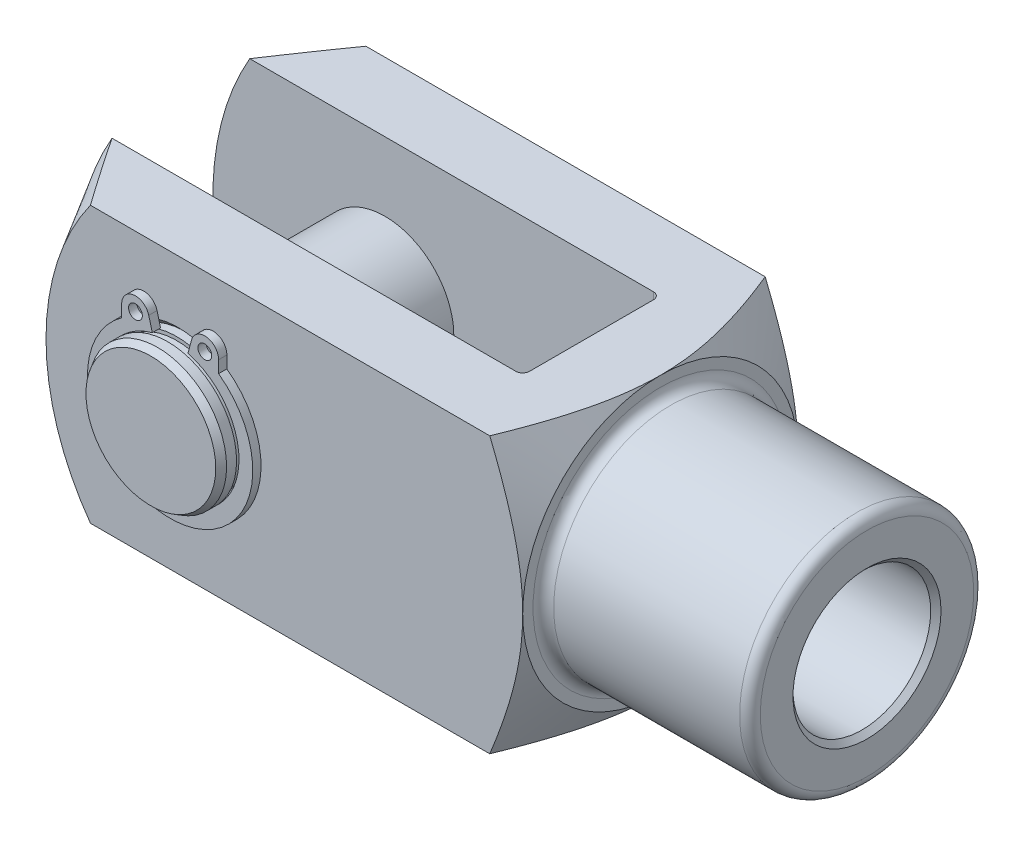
ISO-10303-21;
HEADER;
FILE_DESCRIPTION(('STEP AP214'),'2;1');
FILE_NAME('part.step','',(''),(''),'','','');
FILE_SCHEMA(('AUTOMOTIVE_DESIGN { 1 0 10303 214 1 1 1 1 }'));
ENDSEC;
DATA;
#1=APPLICATION_CONTEXT('core data for automotive mechanical design processes');
#2=APPLICATION_PROTOCOL_DEFINITION('international standard','automotive_design',2000,#1);
#3=PRODUCT_CONTEXT('',#1,'mechanical');
#4=PRODUCT('Part','Part','',(#3));
#5=PRODUCT_RELATED_PRODUCT_CATEGORY('part','',(#4));
#6=PRODUCT_DEFINITION_FORMATION('','',#4);
#7=PRODUCT_DEFINITION_CONTEXT('part definition',#1,'design');
#8=PRODUCT_DEFINITION('design','',#6,#7);
#9=PRODUCT_DEFINITION_SHAPE('','',#8);
#10=(LENGTH_UNIT() NAMED_UNIT(*) SI_UNIT(.MILLI.,.METRE.));
#11=(NAMED_UNIT(*) PLANE_ANGLE_UNIT() SI_UNIT($,.RADIAN.));
#12=(NAMED_UNIT(*) SI_UNIT($,.STERADIAN.) SOLID_ANGLE_UNIT());
#13=UNCERTAINTY_MEASURE_WITH_UNIT(LENGTH_MEASURE(1.E-05),#10,'distance_accuracy_value','');
#14=(GEOMETRIC_REPRESENTATION_CONTEXT(3) GLOBAL_UNCERTAINTY_ASSIGNED_CONTEXT((#13)) GLOBAL_UNIT_ASSIGNED_CONTEXT((#10,
#11,#12)) REPRESENTATION_CONTEXT('',''));
#15=CARTESIAN_POINT('',(0.,0.,0.));
#16=DIRECTION('',(0.,0.,1.));
#17=DIRECTION('',(1.,0.,0.));
#18=AXIS2_PLACEMENT_3D('',#15,#16,#17);
#19=CARTESIAN_POINT('',(-80.,0.,24.));
#20=DIRECTION('',(0.,0.,-1.));
#21=DIRECTION('',(-1.,0.,0.));
#22=AXIS2_PLACEMENT_3D('',#19,#20,#21);
#23=CYLINDRICAL_SURFACE('',#22,10.);
#24=CARTESIAN_POINT('',(-80.,0.,20.25));
#25=DIRECTION('',(0.,0.,1.));
#26=DIRECTION('',(1.,0.,0.));
#27=AXIS2_PLACEMENT_3D('',#24,#25,#26);
#28=CIRCLE('',#27,10.);
#29=CARTESIAN_POINT('',(-70.,0.,20.25));
#30=VERTEX_POINT('',#29);
#31=EDGE_CURVE('P0_E55',#30,#30,#28,.T.);
#32=ORIENTED_EDGE('',*,*,#31,.F.);
#33=EDGE_LOOP('',(#32));
#34=FACE_BOUND('',#33,.T.);
#35=CARTESIAN_POINT('',(-80.,0.,-20.25));
#36=DIRECTION('',(0.,0.,1.));
#37=DIRECTION('',(1.,0.,0.));
#38=AXIS2_PLACEMENT_3D('',#35,#36,#37);
#39=CIRCLE('',#38,10.);
#40=CARTESIAN_POINT('',(-70.,0.,-20.25));
#41=VERTEX_POINT('',#40);
#42=EDGE_CURVE('P0_E40',#41,#41,#39,.T.);
#43=ORIENTED_EDGE('',*,*,#42,.T.);
#44=EDGE_LOOP('',(#43));
#45=FACE_BOUND('',#44,.T.);
#46=ADVANCED_FACE('P0_F14',(#34,#45),#23,.T.);
#47=CARTESIAN_POINT('',(-80.,0.,-21.55));
#48=DIRECTION('',(0.,0.,1.));
#49=DIRECTION('',(1.,0.,0.));
#50=AXIS2_PLACEMENT_3D('',#47,#48,#49);
#51=CIRCLE('',#50,10.);
#52=CARTESIAN_POINT('',(-70.,0.,-21.55));
#53=VERTEX_POINT('',#52);
#54=EDGE_CURVE('P0_E43',#53,#53,#51,.T.);
#55=ORIENTED_EDGE('',*,*,#54,.F.);
#56=EDGE_LOOP('',(#55));
#57=FACE_BOUND('',#56,.T.);
#58=CARTESIAN_POINT('',(-80.,0.,-23.));
#59=DIRECTION('',(0.,0.,1.));
#60=DIRECTION('',(1.,0.,0.));
#61=AXIS2_PLACEMENT_3D('',#58,#59,#60);
#62=CIRCLE('',#61,10.);
#63=CARTESIAN_POINT('',(-70.,0.,-23.));
#64=VERTEX_POINT('',#63);
#65=EDGE_CURVE('P0_E25',#64,#64,#62,.T.);
#66=ORIENTED_EDGE('',*,*,#65,.T.);
#67=EDGE_LOOP('',(#66));
#68=FACE_BOUND('',#67,.T.);
#69=ADVANCED_FACE('P0_F63',(#57,#68),#23,.T.);
#70=CARTESIAN_POINT('',(-80.,0.,-24.));
#71=DIRECTION('',(0.,0.,1.));
#72=DIRECTION('',(1.,0.,0.));
#73=AXIS2_PLACEMENT_3D('',#70,#71,#72);
#74=PLANE('',#73);
#75=CARTESIAN_POINT('',(-80.,0.,-24.));
#76=DIRECTION('',(0.,0.,1.));
#77=DIRECTION('',(1.,0.,0.));
#78=AXIS2_PLACEMENT_3D('',#75,#76,#77);
#79=CIRCLE('',#78,9.42264973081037);
#80=CARTESIAN_POINT('',(-70.5773502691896,0.,-24.));
#81=VERTEX_POINT('',#80);
#82=EDGE_CURVE('P0_E21',#81,#81,#79,.F.);
#83=ORIENTED_EDGE('',*,*,#82,.T.);
#84=EDGE_LOOP('',(#83));
#85=FACE_BOUND('',#84,.T.);
#86=ADVANCED_FACE('P0_F89',(#85),#74,.F.);
#87=CARTESIAN_POINT('',(-80.,0.,-23.));
#88=DIRECTION('',(0.,0.,1.));
#89=DIRECTION('',(1.,0.,0.));
#90=AXIS2_PLACEMENT_3D('',#87,#88,#89);
#91=CONICAL_SURFACE('',#90,10.,0.523598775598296);
#92=ORIENTED_EDGE('',*,*,#82,.F.);
#93=EDGE_LOOP('',(#92));
#94=FACE_BOUND('',#93,.T.);
#95=ORIENTED_EDGE('',*,*,#65,.F.);
#96=EDGE_LOOP('',(#95));
#97=FACE_BOUND('',#96,.T.);
#98=ADVANCED_FACE('P0_F83',(#94,#97),#91,.T.);
#99=CARTESIAN_POINT('',(-80.,10.,-21.55));
#100=DIRECTION('',(0.,0.,-1.));
#101=DIRECTION('',(-1.,0.,0.));
#102=AXIS2_PLACEMENT_3D('',#99,#100,#101);
#103=PLANE('',#102);
#104=CARTESIAN_POINT('',(-80.,0.,-21.55));
#105=DIRECTION('',(0.,0.,1.));
#106=DIRECTION('',(1.,0.,0.));
#107=AXIS2_PLACEMENT_3D('',#104,#105,#106);
#108=CIRCLE('',#107,9.5);
#109=CARTESIAN_POINT('',(-70.5,0.,-21.55));
#110=VERTEX_POINT('',#109);
#111=EDGE_CURVE('P0_E34',#110,#110,#108,.T.);
#112=ORIENTED_EDGE('',*,*,#111,.F.);
#113=EDGE_LOOP('',(#112));
#114=FACE_BOUND('',#113,.T.);
#115=ORIENTED_EDGE('',*,*,#54,.T.);
#116=EDGE_LOOP('',(#115));
#117=FACE_BOUND('',#116,.T.);
#118=ADVANCED_FACE('P0_F77',(#114,#117),#103,.F.);
#119=CARTESIAN_POINT('',(-80.,0.,23.));
#120=DIRECTION('',(0.,0.,1.));
#121=DIRECTION('',(1.,0.,0.));
#122=AXIS2_PLACEMENT_3D('',#119,#120,#121);
#123=CYLINDRICAL_SURFACE('',#122,9.5);
#124=CARTESIAN_POINT('',(-80.,0.,-20.25));
#125=DIRECTION('',(0.,0.,1.));
#126=DIRECTION('',(1.,0.,0.));
#127=AXIS2_PLACEMENT_3D('',#124,#125,#126);
#128=CIRCLE('',#127,9.5);
#129=CARTESIAN_POINT('',(-70.5,0.,-20.25));
#130=VERTEX_POINT('',#129);
#131=EDGE_CURVE('P0_E37',#130,#130,#128,.T.);
#132=ORIENTED_EDGE('',*,*,#131,.F.);
#133=EDGE_LOOP('',(#132));
#134=FACE_BOUND('',#133,.T.);
#135=ORIENTED_EDGE('',*,*,#111,.T.);
#136=EDGE_LOOP('',(#135));
#137=FACE_BOUND('',#136,.T.);
#138=ADVANCED_FACE('P0_F71',(#134,#137),#123,.T.);
#139=CARTESIAN_POINT('',(-80.,10.,-20.25));
#140=DIRECTION('',(0.,0.,1.));
#141=DIRECTION('',(1.,0.,0.));
#142=AXIS2_PLACEMENT_3D('',#139,#140,#141);
#143=PLANE('',#142);
#144=ORIENTED_EDGE('',*,*,#42,.F.);
#145=EDGE_LOOP('',(#144));
#146=FACE_BOUND('',#145,.T.);
#147=ORIENTED_EDGE('',*,*,#131,.T.);
#148=EDGE_LOOP('',(#147));
#149=FACE_BOUND('',#148,.T.);
#150=ADVANCED_FACE('P0_F68',(#146,#149),#143,.F.);
#151=CARTESIAN_POINT('',(-80.,10.,20.25));
#152=DIRECTION('',(0.,0.,-1.));
#153=DIRECTION('',(-1.,0.,0.));
#154=AXIS2_PLACEMENT_3D('',#151,#152,#153);
#155=PLANE('',#154);
#156=CARTESIAN_POINT('',(-80.,0.,20.25));
#157=DIRECTION('',(0.,0.,1.));
#158=DIRECTION('',(1.,0.,0.));
#159=AXIS2_PLACEMENT_3D('',#156,#157,#158);
#160=CIRCLE('',#159,9.5);
#161=CARTESIAN_POINT('',(-70.5,0.,20.25));
#162=VERTEX_POINT('',#161);
#163=EDGE_CURVE('P0_E46',#162,#162,#160,.T.);
#164=ORIENTED_EDGE('',*,*,#163,.F.);
#165=EDGE_LOOP('',(#164));
#166=FACE_BOUND('',#165,.T.);
#167=ORIENTED_EDGE('',*,*,#31,.T.);
#168=EDGE_LOOP('',(#167));
#169=FACE_BOUND('',#168,.T.);
#170=ADVANCED_FACE('P0_F59',(#166,#169),#155,.F.);
#171=CARTESIAN_POINT('',(-80.,0.,23.));
#172=DIRECTION('',(0.,0.,1.));
#173=DIRECTION('',(1.,0.,0.));
#174=AXIS2_PLACEMENT_3D('',#171,#172,#173);
#175=CYLINDRICAL_SURFACE('',#174,9.5);
#176=CARTESIAN_POINT('',(-80.,0.,21.55));
#177=DIRECTION('',(0.,0.,1.));
#178=DIRECTION('',(1.,0.,0.));
#179=AXIS2_PLACEMENT_3D('',#176,#177,#178);
#180=CIRCLE('',#179,9.5);
#181=CARTESIAN_POINT('',(-70.5,0.,21.55));
#182=VERTEX_POINT('',#181);
#183=EDGE_CURVE('P0_E49',#182,#182,#180,.T.);
#184=ORIENTED_EDGE('',*,*,#183,.F.);
#185=EDGE_LOOP('',(#184));
#186=FACE_BOUND('',#185,.T.);
#187=ORIENTED_EDGE('',*,*,#163,.T.);
#188=EDGE_LOOP('',(#187));
#189=FACE_BOUND('',#188,.T.);
#190=ADVANCED_FACE('P0_F108',(#186,#189),#175,.T.);
#191=CARTESIAN_POINT('',(-80.,10.,21.55));
#192=DIRECTION('',(0.,0.,1.));
#193=DIRECTION('',(1.,0.,0.));
#194=AXIS2_PLACEMENT_3D('',#191,#192,#193);
#195=PLANE('',#194);
#196=CARTESIAN_POINT('',(-80.,0.,21.55));
#197=DIRECTION('',(0.,0.,1.));
#198=DIRECTION('',(1.,0.,0.));
#199=AXIS2_PLACEMENT_3D('',#196,#197,#198);
#200=CIRCLE('',#199,10.);
#201=CARTESIAN_POINT('',(-70.,0.,21.55));
#202=VERTEX_POINT('',#201);
#203=EDGE_CURVE('P0_E52',#202,#202,#200,.T.);
#204=ORIENTED_EDGE('',*,*,#203,.F.);
#205=EDGE_LOOP('',(#204));
#206=FACE_BOUND('',#205,.T.);
#207=ORIENTED_EDGE('',*,*,#183,.T.);
#208=EDGE_LOOP('',(#207));
#209=FACE_BOUND('',#208,.T.);
#210=ADVANCED_FACE('P0_F104',(#206,#209),#195,.F.);
#211=CARTESIAN_POINT('',(-80.,0.,24.));
#212=DIRECTION('',(0.,0.,1.));
#213=DIRECTION('',(1.,0.,0.));
#214=AXIS2_PLACEMENT_3D('',#211,#212,#213);
#215=PLANE('',#214);
#216=CARTESIAN_POINT('',(-80.,0.,24.));
#217=DIRECTION('',(0.,0.,1.));
#218=DIRECTION('',(1.,0.,0.));
#219=AXIS2_PLACEMENT_3D('',#216,#217,#218);
#220=CIRCLE('',#219,9.42264973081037);
#221=CARTESIAN_POINT('',(-70.5773502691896,0.,24.));
#222=VERTEX_POINT('',#221);
#223=EDGE_CURVE('P0_E10',#222,#222,#220,.T.);
#224=ORIENTED_EDGE('',*,*,#223,.T.);
#225=EDGE_LOOP('',(#224));
#226=FACE_BOUND('',#225,.T.);
#227=ADVANCED_FACE('P0_F102',(#226),#215,.T.);
#228=CARTESIAN_POINT('',(-80.,0.,24.));
#229=DIRECTION('',(0.,0.,-1.));
#230=DIRECTION('',(-1.,0.,0.));
#231=AXIS2_PLACEMENT_3D('',#228,#229,#230);
#232=CONICAL_SURFACE('',#231,9.42264973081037,0.523598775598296);
#233=CARTESIAN_POINT('',(-80.,0.,23.));
#234=DIRECTION('',(0.,0.,1.));
#235=DIRECTION('',(1.,0.,0.));
#236=AXIS2_PLACEMENT_3D('',#233,#234,#235);
#237=CIRCLE('',#236,10.);
#238=CARTESIAN_POINT('',(-70.,0.,23.));
#239=VERTEX_POINT('',#238);
#240=EDGE_CURVE('P0_E29',#239,#239,#237,.F.);
#241=ORIENTED_EDGE('',*,*,#240,.F.);
#242=EDGE_LOOP('',(#241));
#243=FACE_BOUND('',#242,.T.);
#244=ORIENTED_EDGE('',*,*,#223,.F.);
#245=EDGE_LOOP('',(#244));
#246=FACE_BOUND('',#245,.T.);
#247=ADVANCED_FACE('P0_F16',(#243,#246),#232,.T.);
#248=ORIENTED_EDGE('',*,*,#203,.T.);
#249=EDGE_LOOP('',(#248));
#250=FACE_BOUND('',#249,.T.);
#251=ORIENTED_EDGE('',*,*,#240,.T.);
#252=EDGE_LOOP('',(#251));
#253=FACE_BOUND('',#252,.T.);
#254=ADVANCED_FACE('P0_F65',(#250,#253),#23,.T.);
#255=CLOSED_SHELL('',(#46,#69,#86,#98,#118,#138,#150,#170,#190,#210,#227,#247,#254));
#256=MANIFOLD_SOLID_BREP('P0_B1',#255);
#257=CARTESIAN_POINT('',(-80.0000000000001,0.,21.1999999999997));
#258=DIRECTION('',(0.,0.,1.));
#259=DIRECTION('',(1.,0.,0.));
#260=AXIS2_PLACEMENT_3D('',#257,#258,#259);
#261=PLANE('',#260);
#262=CARTESIAN_POINT('',(-85.0376801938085,11.0734718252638,21.1999999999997));
#263=DIRECTION('',(0.,0.,1.));
#264=DIRECTION('',(1.,0.,0.));
#265=AXIS2_PLACEMENT_3D('',#262,#263,#264);
#266=CIRCLE('',#265,1.);
#267=CARTESIAN_POINT('',(-84.0376801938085,11.0734718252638,21.1999999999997));
#268=VERTEX_POINT('',#267);
#269=EDGE_CURVE('P1_E117',#268,#268,#266,.T.);
#270=ORIENTED_EDGE('',*,*,#269,.F.);
#271=EDGE_LOOP('',(#270));
#272=FACE_BOUND('',#271,.T.);
#273=CARTESIAN_POINT('',(-80.0000000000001,0.,21.1999999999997));
#274=DIRECTION('',(0.,0.,-1.));
#275=DIRECTION('',(1.,0.,0.));
#276=AXIS2_PLACEMENT_3D('',#273,#274,#275);
#277=CIRCLE('',#276,10.);
#278=CARTESIAN_POINT('',(-77.4118095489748,9.6592582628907,21.1999999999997));
#279=VERTEX_POINT('',#278);
#280=CARTESIAN_POINT('',(-82.5881904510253,9.6592582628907,21.1999999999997));
#281=VERTEX_POINT('',#280);
#282=EDGE_CURVE('P1_E128',#279,#281,#277,.T.);
#283=ORIENTED_EDGE('',*,*,#282,.T.);
#284=DIRECTION('',(-0.258819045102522,0.965925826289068,0.));
#285=VECTOR('',#284,1.);
#286=CARTESIAN_POINT('',(-82.5881904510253,9.6592582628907,21.1999999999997));
#287=LINE('',#286,#285);
#288=CARTESIAN_POINT('',(-83.1058285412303,11.5911099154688,21.1999999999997));
#289=VERTEX_POINT('',#288);
#290=EDGE_CURVE('P1_E76',#281,#289,#287,.T.);
#291=ORIENTED_EDGE('',*,*,#290,.T.);
#292=CARTESIAN_POINT('',(-85.0376801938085,11.0734718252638,21.1999999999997));
#293=DIRECTION('',(0.,0.,1.));
#294=DIRECTION('',(1.,0.,0.));
#295=AXIS2_PLACEMENT_3D('',#292,#293,#294);
#296=CIRCLE('',#295,2.);
#297=CARTESIAN_POINT('',(-87.0376801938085,11.0734718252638,21.1999999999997));
#298=VERTEX_POINT('',#297);
#299=EDGE_CURVE('P1_E143',#289,#298,#296,.T.);
#300=ORIENTED_EDGE('',*,*,#299,.T.);
#301=DIRECTION('',(0.,-1.,0.));
#302=VECTOR('',#301,1.);
#303=CARTESIAN_POINT('',(-87.0376801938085,11.0734718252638,21.1999999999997));
#304=LINE('',#303,#302);
#305=CARTESIAN_POINT('',(-87.0376801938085,9.31962229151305,21.1999999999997));
#306=VERTEX_POINT('',#305);
#307=EDGE_CURVE('P1_E156',#298,#306,#304,.T.);
#308=ORIENTED_EDGE('',*,*,#307,.T.);
#309=CARTESIAN_POINT('',(-80.0000000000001,-0.399999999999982,21.1999999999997));
#310=DIRECTION('',(0.,0.,1.));
#311=DIRECTION('',(1.,0.,0.));
#312=AXIS2_PLACEMENT_3D('',#309,#310,#311);
#313=CIRCLE('',#312,12.);
#314=CARTESIAN_POINT('',(-72.9623198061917,9.31962229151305,21.1999999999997));
#315=VERTEX_POINT('',#314);
#316=EDGE_CURVE('P1_E95',#306,#315,#313,.T.);
#317=ORIENTED_EDGE('',*,*,#316,.T.);
#318=DIRECTION('',(0.,1.,0.));
#319=VECTOR('',#318,1.);
#320=CARTESIAN_POINT('',(-72.9623198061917,11.0734718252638,21.1999999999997));
#321=LINE('',#320,#319);
#322=CARTESIAN_POINT('',(-72.9623198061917,11.0734718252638,21.1999999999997));
#323=VERTEX_POINT('',#322);
#324=EDGE_CURVE('P1_E89',#315,#323,#321,.T.);
#325=ORIENTED_EDGE('',*,*,#324,.T.);
#326=CARTESIAN_POINT('',(-74.9623198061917,11.0734718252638,21.1999999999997));
#327=DIRECTION('',(0.,0.,1.));
#328=DIRECTION('',(-1.,0.,0.));
#329=AXIS2_PLACEMENT_3D('',#326,#327,#328);
#330=CIRCLE('',#329,2.);
#331=CARTESIAN_POINT('',(-76.8941714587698,11.5911099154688,21.1999999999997));
#332=VERTEX_POINT('',#331);
#333=EDGE_CURVE('P1_E93',#323,#332,#330,.T.);
#334=ORIENTED_EDGE('',*,*,#333,.T.);
#335=DIRECTION('',(-0.258819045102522,-0.965925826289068,0.));
#336=VECTOR('',#335,1.);
#337=CARTESIAN_POINT('',(-77.4118095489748,9.6592582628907,21.1999999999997));
#338=LINE('',#337,#336);
#339=EDGE_CURVE('P1_E33',#332,#279,#338,.T.);
#340=ORIENTED_EDGE('',*,*,#339,.T.);
#341=EDGE_LOOP('',(#283,#291,#300,#308,#317,#325,#334,#340));
#342=FACE_BOUND('',#341,.T.);
#343=CARTESIAN_POINT('',(-74.9623198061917,11.0734718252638,21.1999999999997));
#344=DIRECTION('',(0.,0.,1.));
#345=DIRECTION('',(-1.,0.,0.));
#346=AXIS2_PLACEMENT_3D('',#343,#344,#345);
#347=CIRCLE('',#346,1.);
#348=CARTESIAN_POINT('',(-75.9623198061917,11.0734718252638,21.1999999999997));
#349=VERTEX_POINT('',#348);
#350=EDGE_CURVE('P1_E165',#349,#349,#347,.T.);
#351=ORIENTED_EDGE('',*,*,#350,.F.);
#352=EDGE_LOOP('',(#351));
#353=FACE_BOUND('',#352,.T.);
#354=ADVANCED_FACE('P1_F16',(#272,#342,#353),#261,.T.);
#355=CARTESIAN_POINT('',(-80.0000000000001,0.,19.9999999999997));
#356=DIRECTION('',(0.,0.,1.));
#357=DIRECTION('',(1.,0.,0.));
#358=AXIS2_PLACEMENT_3D('',#355,#356,#357);
#359=PLANE('',#358);
#360=CARTESIAN_POINT('',(-85.0376801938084,11.0734718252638,19.9999999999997));
#361=DIRECTION('',(0.,0.,1.));
#362=DIRECTION('',(1.,0.,0.));
#363=AXIS2_PLACEMENT_3D('',#360,#361,#362);
#364=CIRCLE('',#363,1.);
#365=CARTESIAN_POINT('',(-84.0376801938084,11.0734718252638,19.9999999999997));
#366=VERTEX_POINT('',#365);
#367=EDGE_CURVE('P1_E162',#366,#366,#364,.T.);
#368=ORIENTED_EDGE('',*,*,#367,.T.);
#369=EDGE_LOOP('',(#368));
#370=FACE_BOUND('',#369,.T.);
#371=CARTESIAN_POINT('',(-80.0000000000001,0.,19.9999999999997));
#372=DIRECTION('',(0.,0.,-1.));
#373=DIRECTION('',(1.,0.,0.));
#374=AXIS2_PLACEMENT_3D('',#371,#372,#373);
#375=CIRCLE('',#374,10.);
#376=CARTESIAN_POINT('',(-77.4118095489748,9.6592582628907,19.9999999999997));
#377=VERTEX_POINT('',#376);
#378=CARTESIAN_POINT('',(-82.5881904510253,9.6592582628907,19.9999999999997));
#379=VERTEX_POINT('',#378);
#380=EDGE_CURVE('P1_E113',#377,#379,#375,.T.);
#381=ORIENTED_EDGE('',*,*,#380,.F.);
#382=DIRECTION('',(-0.258819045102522,-0.965925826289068,0.));
#383=VECTOR('',#382,1.);
#384=CARTESIAN_POINT('',(-77.4118095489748,9.6592582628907,19.9999999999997));
#385=LINE('',#384,#383);
#386=CARTESIAN_POINT('',(-76.8941714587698,11.5911099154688,19.9999999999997));
#387=VERTEX_POINT('',#386);
#388=EDGE_CURVE('P1_E68',#387,#377,#385,.T.);
#389=ORIENTED_EDGE('',*,*,#388,.F.);
#390=CARTESIAN_POINT('',(-74.9623198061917,11.0734718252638,19.9999999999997));
#391=DIRECTION('',(0.,0.,1.));
#392=DIRECTION('',(-1.,0.,0.));
#393=AXIS2_PLACEMENT_3D('',#390,#391,#392);
#394=CIRCLE('',#393,2.);
#395=CARTESIAN_POINT('',(-72.9623198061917,11.0734718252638,19.9999999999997));
#396=VERTEX_POINT('',#395);
#397=EDGE_CURVE('P1_E62',#396,#387,#394,.T.);
#398=ORIENTED_EDGE('',*,*,#397,.F.);
#399=DIRECTION('',(0.,1.,0.));
#400=VECTOR('',#399,1.);
#401=CARTESIAN_POINT('',(-72.9623198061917,11.0734718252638,19.9999999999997));
#402=LINE('',#401,#400);
#403=CARTESIAN_POINT('',(-72.9623198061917,9.31962229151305,19.9999999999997));
#404=VERTEX_POINT('',#403);
#405=EDGE_CURVE('P1_E103',#404,#396,#402,.T.);
#406=ORIENTED_EDGE('',*,*,#405,.F.);
#407=CARTESIAN_POINT('',(-80.0000000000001,-0.399999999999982,19.9999999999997));
#408=DIRECTION('',(0.,0.,1.));
#409=DIRECTION('',(1.,0.,0.));
#410=AXIS2_PLACEMENT_3D('',#407,#408,#409);
#411=CIRCLE('',#410,12.);
#412=CARTESIAN_POINT('',(-87.0376801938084,9.31962229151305,19.9999999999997));
#413=VERTEX_POINT('',#412);
#414=EDGE_CURVE('P1_E123',#413,#404,#411,.T.);
#415=ORIENTED_EDGE('',*,*,#414,.F.);
#416=DIRECTION('',(0.,-1.,0.));
#417=VECTOR('',#416,1.);
#418=CARTESIAN_POINT('',(-87.0376801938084,11.0734718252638,19.9999999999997));
#419=LINE('',#418,#417);
#420=CARTESIAN_POINT('',(-87.0376801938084,11.0734718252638,19.9999999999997));
#421=VERTEX_POINT('',#420);
#422=EDGE_CURVE('P1_E121',#421,#413,#419,.T.);
#423=ORIENTED_EDGE('',*,*,#422,.F.);
#424=CARTESIAN_POINT('',(-85.0376801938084,11.0734718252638,19.9999999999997));
#425=DIRECTION('',(0.,0.,1.));
#426=DIRECTION('',(1.,0.,0.));
#427=AXIS2_PLACEMENT_3D('',#424,#425,#426);
#428=CIRCLE('',#427,2.);
#429=CARTESIAN_POINT('',(-83.1058285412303,11.5911099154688,19.9999999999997));
#430=VERTEX_POINT('',#429);
#431=EDGE_CURVE('P1_E119',#430,#421,#428,.T.);
#432=ORIENTED_EDGE('',*,*,#431,.F.);
#433=DIRECTION('',(-0.258819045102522,0.965925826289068,0.));
#434=VECTOR('',#433,1.);
#435=CARTESIAN_POINT('',(-82.5881904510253,9.6592582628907,19.9999999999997));
#436=LINE('',#435,#434);
#437=EDGE_CURVE('P1_E116',#379,#430,#436,.T.);
#438=ORIENTED_EDGE('',*,*,#437,.F.);
#439=EDGE_LOOP('',(#381,#389,#398,#406,#415,#423,#432,#438));
#440=FACE_BOUND('',#439,.T.);
#441=CARTESIAN_POINT('',(-74.9623198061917,11.0734718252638,19.9999999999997));
#442=DIRECTION('',(0.,0.,1.));
#443=DIRECTION('',(-1.,0.,0.));
#444=AXIS2_PLACEMENT_3D('',#441,#442,#443);
#445=CIRCLE('',#444,1.);
#446=CARTESIAN_POINT('',(-75.9623198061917,11.0734718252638,19.9999999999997));
#447=VERTEX_POINT('',#446);
#448=EDGE_CURVE('P1_E168',#447,#447,#445,.T.);
#449=ORIENTED_EDGE('',*,*,#448,.T.);
#450=EDGE_LOOP('',(#449));
#451=FACE_BOUND('',#450,.T.);
#452=ADVANCED_FACE('P1_F147',(#370,#440,#451),#359,.F.);
#453=CARTESIAN_POINT('',(-80.0000000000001,0.,21.1999999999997));
#454=DIRECTION('',(0.,0.,-1.));
#455=DIRECTION('',(-1.,0.,0.));
#456=AXIS2_PLACEMENT_3D('',#453,#454,#455);
#457=CYLINDRICAL_SURFACE('',#456,10.);
#458=ORIENTED_EDGE('',*,*,#380,.T.);
#459=DIRECTION('',(0.,0.,-1.));
#460=VECTOR('',#459,1.);
#461=CARTESIAN_POINT('',(-82.5881904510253,9.6592582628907,21.1999999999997));
#462=LINE('',#461,#460);
#463=EDGE_CURVE('P1_E11',#281,#379,#462,.T.);
#464=ORIENTED_EDGE('',*,*,#463,.F.);
#465=ORIENTED_EDGE('',*,*,#282,.F.);
#466=DIRECTION('',(0.,0.,-1.));
#467=VECTOR('',#466,1.);
#468=CARTESIAN_POINT('',(-77.4118095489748,9.6592582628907,21.1999999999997));
#469=LINE('',#468,#467);
#470=EDGE_CURVE('P1_E109',#279,#377,#469,.T.);
#471=ORIENTED_EDGE('',*,*,#470,.T.);
#472=EDGE_LOOP('',(#458,#464,#465,#471));
#473=FACE_BOUND('',#472,.T.);
#474=ADVANCED_FACE('P1_F18',(#473),#457,.F.);
#475=CARTESIAN_POINT('',(-82.5881904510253,9.6592582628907,21.1999999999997));
#476=DIRECTION('',(-0.965925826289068,-0.258819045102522,0.));
#477=DIRECTION('',(0.258819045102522,-0.965925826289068,0.));
#478=AXIS2_PLACEMENT_3D('',#475,#476,#477);
#479=PLANE('',#478);
#480=ORIENTED_EDGE('',*,*,#437,.T.);
#481=DIRECTION('',(0.,0.,-1.));
#482=VECTOR('',#481,1.);
#483=CARTESIAN_POINT('',(-83.1058285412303,11.5911099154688,21.1999999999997));
#484=LINE('',#483,#482);
#485=EDGE_CURVE('P1_E25',#289,#430,#484,.T.);
#486=ORIENTED_EDGE('',*,*,#485,.F.);
#487=ORIENTED_EDGE('',*,*,#290,.F.);
#488=ORIENTED_EDGE('',*,*,#463,.T.);
#489=EDGE_LOOP('',(#480,#486,#487,#488));
#490=FACE_BOUND('',#489,.T.);
#491=ADVANCED_FACE('P1_F202',(#490),#479,.F.);
#492=CARTESIAN_POINT('',(-85.0376801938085,11.0734718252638,21.1999999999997));
#493=DIRECTION('',(0.,0.,-1.));
#494=DIRECTION('',(-1.,0.,0.));
#495=AXIS2_PLACEMENT_3D('',#492,#493,#494);
#496=CYLINDRICAL_SURFACE('',#495,2.);
#497=ORIENTED_EDGE('',*,*,#431,.T.);
#498=DIRECTION('',(0.,0.,-1.));
#499=VECTOR('',#498,1.);
#500=CARTESIAN_POINT('',(-87.0376801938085,11.0734718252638,21.1999999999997));
#501=LINE('',#500,#499);
#502=EDGE_CURVE('P1_E135',#298,#421,#501,.T.);
#503=ORIENTED_EDGE('',*,*,#502,.F.);
#504=ORIENTED_EDGE('',*,*,#299,.F.);
#505=ORIENTED_EDGE('',*,*,#485,.T.);
#506=EDGE_LOOP('',(#497,#503,#504,#505));
#507=FACE_BOUND('',#506,.T.);
#508=ADVANCED_FACE('P1_F141',(#507),#496,.T.);
#509=CARTESIAN_POINT('',(-87.0376801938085,11.0734718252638,21.1999999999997));
#510=DIRECTION('',(1.,0.,0.));
#511=DIRECTION('',(0.,1.,0.));
#512=AXIS2_PLACEMENT_3D('',#509,#510,#511);
#513=PLANE('',#512);
#514=ORIENTED_EDGE('',*,*,#422,.T.);
#515=DIRECTION('',(0.,0.,-1.));
#516=VECTOR('',#515,1.);
#517=CARTESIAN_POINT('',(-87.0376801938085,9.31962229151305,21.1999999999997));
#518=LINE('',#517,#516);
#519=EDGE_CURVE('P1_E132',#306,#413,#518,.T.);
#520=ORIENTED_EDGE('',*,*,#519,.F.);
#521=ORIENTED_EDGE('',*,*,#307,.F.);
#522=ORIENTED_EDGE('',*,*,#502,.T.);
#523=EDGE_LOOP('',(#514,#520,#521,#522));
#524=FACE_BOUND('',#523,.T.);
#525=ADVANCED_FACE('P1_F152',(#524),#513,.F.);
#526=CARTESIAN_POINT('',(-80.0000000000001,-0.399999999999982,21.1999999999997));
#527=DIRECTION('',(0.,0.,-1.));
#528=DIRECTION('',(-1.,0.,0.));
#529=AXIS2_PLACEMENT_3D('',#526,#527,#528);
#530=CYLINDRICAL_SURFACE('',#529,12.);
#531=ORIENTED_EDGE('',*,*,#414,.T.);
#532=DIRECTION('',(0.,0.,-1.));
#533=VECTOR('',#532,1.);
#534=CARTESIAN_POINT('',(-72.9623198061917,9.31962229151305,21.1999999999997));
#535=LINE('',#534,#533);
#536=EDGE_CURVE('P1_E104',#315,#404,#535,.T.);
#537=ORIENTED_EDGE('',*,*,#536,.F.);
#538=ORIENTED_EDGE('',*,*,#316,.F.);
#539=ORIENTED_EDGE('',*,*,#519,.T.);
#540=EDGE_LOOP('',(#531,#537,#538,#539));
#541=FACE_BOUND('',#540,.T.);
#542=ADVANCED_FACE('P1_F155',(#541),#530,.T.);
#543=CARTESIAN_POINT('',(-72.9623198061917,11.0734718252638,21.1999999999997));
#544=DIRECTION('',(-1.,0.,0.));
#545=DIRECTION('',(0.,-1.,0.));
#546=AXIS2_PLACEMENT_3D('',#543,#544,#545);
#547=PLANE('',#546);
#548=ORIENTED_EDGE('',*,*,#405,.T.);
#549=DIRECTION('',(0.,0.,-1.));
#550=VECTOR('',#549,1.);
#551=CARTESIAN_POINT('',(-72.9623198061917,11.0734718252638,21.1999999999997));
#552=LINE('',#551,#550);
#553=EDGE_CURVE('P1_E100',#323,#396,#552,.T.);
#554=ORIENTED_EDGE('',*,*,#553,.F.);
#555=ORIENTED_EDGE('',*,*,#324,.F.);
#556=ORIENTED_EDGE('',*,*,#536,.T.);
#557=EDGE_LOOP('',(#548,#554,#555,#556));
#558=FACE_BOUND('',#557,.T.);
#559=ADVANCED_FACE('P1_F101',(#558),#547,.F.);
#560=CARTESIAN_POINT('',(-74.9623198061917,11.0734718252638,21.1999999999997));
#561=DIRECTION('',(0.,0.,-1.));
#562=DIRECTION('',(-1.,0.,0.));
#563=AXIS2_PLACEMENT_3D('',#560,#561,#562);
#564=CYLINDRICAL_SURFACE('',#563,2.);
#565=ORIENTED_EDGE('',*,*,#397,.T.);
#566=DIRECTION('',(0.,0.,-1.));
#567=VECTOR('',#566,1.);
#568=CARTESIAN_POINT('',(-76.8941714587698,11.5911099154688,21.1999999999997));
#569=LINE('',#568,#567);
#570=EDGE_CURVE('P1_E105',#332,#387,#569,.T.);
#571=ORIENTED_EDGE('',*,*,#570,.F.);
#572=ORIENTED_EDGE('',*,*,#333,.F.);
#573=ORIENTED_EDGE('',*,*,#553,.T.);
#574=EDGE_LOOP('',(#565,#571,#572,#573));
#575=FACE_BOUND('',#574,.T.);
#576=ADVANCED_FACE('P1_F107',(#575),#564,.T.);
#577=CARTESIAN_POINT('',(-77.4118095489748,9.6592582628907,21.1999999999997));
#578=DIRECTION('',(0.965925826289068,-0.258819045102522,0.));
#579=DIRECTION('',(0.258819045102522,0.965925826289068,0.));
#580=AXIS2_PLACEMENT_3D('',#577,#578,#579);
#581=PLANE('',#580);
#582=ORIENTED_EDGE('',*,*,#388,.T.);
#583=ORIENTED_EDGE('',*,*,#470,.F.);
#584=ORIENTED_EDGE('',*,*,#339,.F.);
#585=ORIENTED_EDGE('',*,*,#570,.T.);
#586=EDGE_LOOP('',(#582,#583,#584,#585));
#587=FACE_BOUND('',#586,.T.);
#588=ADVANCED_FACE('P1_F190',(#587),#581,.F.);
#589=CARTESIAN_POINT('',(-85.0376801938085,11.0734718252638,21.1999999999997));
#590=DIRECTION('',(0.,0.,-1.));
#591=DIRECTION('',(-1.,0.,0.));
#592=AXIS2_PLACEMENT_3D('',#589,#590,#591);
#593=CYLINDRICAL_SURFACE('',#592,1.);
#594=ORIENTED_EDGE('',*,*,#269,.T.);
#595=EDGE_LOOP('',(#594));
#596=FACE_BOUND('',#595,.T.);
#597=ORIENTED_EDGE('',*,*,#367,.F.);
#598=EDGE_LOOP('',(#597));
#599=FACE_BOUND('',#598,.T.);
#600=ADVANCED_FACE('P1_F187',(#596,#599),#593,.F.);
#601=CARTESIAN_POINT('',(-74.9623198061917,11.0734718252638,21.1999999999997));
#602=DIRECTION('',(0.,0.,-1.));
#603=DIRECTION('',(-1.,0.,0.));
#604=AXIS2_PLACEMENT_3D('',#601,#602,#603);
#605=CYLINDRICAL_SURFACE('',#604,1.);
#606=ORIENTED_EDGE('',*,*,#350,.T.);
#607=EDGE_LOOP('',(#606));
#608=FACE_BOUND('',#607,.T.);
#609=ORIENTED_EDGE('',*,*,#448,.F.);
#610=EDGE_LOOP('',(#609));
#611=FACE_BOUND('',#610,.T.);
#612=ADVANCED_FACE('P1_F174',(#608,#611),#605,.F.);
#613=CLOSED_SHELL('',(#354,#452,#474,#491,#508,#525,#542,#559,#576,#588,#600,#612));
#614=MANIFOLD_SOLID_BREP('P1_B1',#613);
#615=CARTESIAN_POINT('',(-80.0000000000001,0.,-21.1999999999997));
#616=DIRECTION('',(0.,0.,-1.));
#617=DIRECTION('',(-1.,0.,0.));
#618=AXIS2_PLACEMENT_3D('',#615,#616,#617);
#619=PLANE('',#618);
#620=CARTESIAN_POINT('',(-74.9623198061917,11.0734718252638,-21.1999999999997));
#621=DIRECTION('',(0.,0.,-1.));
#622=DIRECTION('',(-1.,0.,0.));
#623=AXIS2_PLACEMENT_3D('',#620,#621,#622);
#624=CIRCLE('',#623,1.);
#625=CARTESIAN_POINT('',(-75.9623198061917,11.0734718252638,-21.1999999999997));
#626=VERTEX_POINT('',#625);
#627=EDGE_CURVE('P2_E117',#626,#626,#624,.T.);
#628=ORIENTED_EDGE('',*,*,#627,.F.);
#629=EDGE_LOOP('',(#628));
#630=FACE_BOUND('',#629,.T.);
#631=CARTESIAN_POINT('',(-80.0000000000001,0.,-21.1999999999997));
#632=DIRECTION('',(0.,0.,1.));
#633=DIRECTION('',(-1.,0.,0.));
#634=AXIS2_PLACEMENT_3D('',#631,#632,#633);
#635=CIRCLE('',#634,10.);
#636=CARTESIAN_POINT('',(-82.5881904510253,9.65925826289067,-21.1999999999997));
#637=VERTEX_POINT('',#636);
#638=CARTESIAN_POINT('',(-77.4118095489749,9.65925826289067,-21.1999999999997));
#639=VERTEX_POINT('',#638);
#640=EDGE_CURVE('P2_E128',#637,#639,#635,.T.);
#641=ORIENTED_EDGE('',*,*,#640,.T.);
#642=DIRECTION('',(0.258819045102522,0.965925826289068,0.));
#643=VECTOR('',#642,1.);
#644=CARTESIAN_POINT('',(-77.4118095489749,9.65925826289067,-21.1999999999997));
#645=LINE('',#644,#643);
#646=CARTESIAN_POINT('',(-76.8941714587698,11.5911099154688,-21.1999999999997));
#647=VERTEX_POINT('',#646);
#648=EDGE_CURVE('P2_E76',#639,#647,#645,.T.);
#649=ORIENTED_EDGE('',*,*,#648,.T.);
#650=CARTESIAN_POINT('',(-74.9623198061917,11.0734718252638,-21.1999999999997));
#651=DIRECTION('',(0.,0.,-1.));
#652=DIRECTION('',(-1.,0.,0.));
#653=AXIS2_PLACEMENT_3D('',#650,#651,#652);
#654=CIRCLE('',#653,2.);
#655=CARTESIAN_POINT('',(-72.9623198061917,11.0734718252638,-21.1999999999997));
#656=VERTEX_POINT('',#655);
#657=EDGE_CURVE('P2_E143',#647,#656,#654,.T.);
#658=ORIENTED_EDGE('',*,*,#657,.T.);
#659=DIRECTION('',(0.,-1.,0.));
#660=VECTOR('',#659,1.);
#661=CARTESIAN_POINT('',(-72.9623198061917,11.0734718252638,-21.1999999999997));
#662=LINE('',#661,#660);
#663=CARTESIAN_POINT('',(-72.9623198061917,9.31962229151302,-21.1999999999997));
#664=VERTEX_POINT('',#663);
#665=EDGE_CURVE('P2_E156',#656,#664,#662,.T.);
#666=ORIENTED_EDGE('',*,*,#665,.T.);
#667=CARTESIAN_POINT('',(-80.0000000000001,-0.400000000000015,-21.1999999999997));
#668=DIRECTION('',(0.,0.,-1.));
#669=DIRECTION('',(-1.,0.,0.));
#670=AXIS2_PLACEMENT_3D('',#667,#668,#669);
#671=CIRCLE('',#670,12.);
#672=CARTESIAN_POINT('',(-87.0376801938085,9.31962229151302,-21.1999999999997));
#673=VERTEX_POINT('',#672);
#674=EDGE_CURVE('P2_E95',#664,#673,#671,.T.);
#675=ORIENTED_EDGE('',*,*,#674,.T.);
#676=DIRECTION('',(0.,1.,0.));
#677=VECTOR('',#676,1.);
#678=CARTESIAN_POINT('',(-87.0376801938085,11.0734718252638,-21.1999999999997));
#679=LINE('',#678,#677);
#680=CARTESIAN_POINT('',(-87.0376801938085,11.0734718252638,-21.1999999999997));
#681=VERTEX_POINT('',#680);
#682=EDGE_CURVE('P2_E89',#673,#681,#679,.T.);
#683=ORIENTED_EDGE('',*,*,#682,.T.);
#684=CARTESIAN_POINT('',(-85.0376801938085,11.0734718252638,-21.1999999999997));
#685=DIRECTION('',(0.,0.,-1.));
#686=DIRECTION('',(1.,0.,0.));
#687=AXIS2_PLACEMENT_3D('',#684,#685,#686);
#688=CIRCLE('',#687,2.);
#689=CARTESIAN_POINT('',(-83.1058285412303,11.5911099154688,-21.1999999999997));
#690=VERTEX_POINT('',#689);
#691=EDGE_CURVE('P2_E93',#681,#690,#688,.T.);
#692=ORIENTED_EDGE('',*,*,#691,.T.);
#693=DIRECTION('',(0.258819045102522,-0.965925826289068,0.));
#694=VECTOR('',#693,1.);
#695=CARTESIAN_POINT('',(-82.5881904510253,9.65925826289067,-21.1999999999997));
#696=LINE('',#695,#694);
#697=EDGE_CURVE('P2_E33',#690,#637,#696,.T.);
#698=ORIENTED_EDGE('',*,*,#697,.T.);
#699=EDGE_LOOP('',(#641,#649,#658,#666,#675,#683,#692,#698));
#700=FACE_BOUND('',#699,.T.);
#701=CARTESIAN_POINT('',(-85.0376801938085,11.0734718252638,-21.1999999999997));
#702=DIRECTION('',(0.,0.,-1.));
#703=DIRECTION('',(1.,0.,0.));
#704=AXIS2_PLACEMENT_3D('',#701,#702,#703);
#705=CIRCLE('',#704,1.);
#706=CARTESIAN_POINT('',(-84.0376801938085,11.0734718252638,-21.1999999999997));
#707=VERTEX_POINT('',#706);
#708=EDGE_CURVE('P2_E165',#707,#707,#705,.T.);
#709=ORIENTED_EDGE('',*,*,#708,.F.);
#710=EDGE_LOOP('',(#709));
#711=FACE_BOUND('',#710,.T.);
#712=ADVANCED_FACE('P2_F16',(#630,#700,#711),#619,.T.);
#713=CARTESIAN_POINT('',(-80.0000000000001,0.,-19.9999999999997));
#714=DIRECTION('',(0.,0.,-1.));
#715=DIRECTION('',(-1.,0.,0.));
#716=AXIS2_PLACEMENT_3D('',#713,#714,#715);
#717=PLANE('',#716);
#718=CARTESIAN_POINT('',(-74.9623198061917,11.0734718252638,-19.9999999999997));
#719=DIRECTION('',(0.,0.,-1.));
#720=DIRECTION('',(-1.,0.,0.));
#721=AXIS2_PLACEMENT_3D('',#718,#719,#720);
#722=CIRCLE('',#721,1.);
#723=CARTESIAN_POINT('',(-75.9623198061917,11.0734718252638,-19.9999999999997));
#724=VERTEX_POINT('',#723);
#725=EDGE_CURVE('P2_E162',#724,#724,#722,.T.);
#726=ORIENTED_EDGE('',*,*,#725,.T.);
#727=EDGE_LOOP('',(#726));
#728=FACE_BOUND('',#727,.T.);
#729=CARTESIAN_POINT('',(-80.0000000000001,0.,-19.9999999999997));
#730=DIRECTION('',(0.,0.,1.));
#731=DIRECTION('',(-1.,0.,0.));
#732=AXIS2_PLACEMENT_3D('',#729,#730,#731);
#733=CIRCLE('',#732,10.);
#734=CARTESIAN_POINT('',(-82.5881904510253,9.65925826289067,-19.9999999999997));
#735=VERTEX_POINT('',#734);
#736=CARTESIAN_POINT('',(-77.4118095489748,9.65925826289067,-19.9999999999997));
#737=VERTEX_POINT('',#736);
#738=EDGE_CURVE('P2_E113',#735,#737,#733,.T.);
#739=ORIENTED_EDGE('',*,*,#738,.F.);
#740=DIRECTION('',(0.258819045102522,-0.965925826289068,0.));
#741=VECTOR('',#740,1.);
#742=CARTESIAN_POINT('',(-82.5881904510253,9.65925826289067,-19.9999999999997));
#743=LINE('',#742,#741);
#744=CARTESIAN_POINT('',(-83.1058285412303,11.5911099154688,-19.9999999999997));
#745=VERTEX_POINT('',#744);
#746=EDGE_CURVE('P2_E68',#745,#735,#743,.T.);
#747=ORIENTED_EDGE('',*,*,#746,.F.);
#748=CARTESIAN_POINT('',(-85.0376801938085,11.0734718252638,-19.9999999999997));
#749=DIRECTION('',(0.,0.,-1.));
#750=DIRECTION('',(1.,0.,0.));
#751=AXIS2_PLACEMENT_3D('',#748,#749,#750);
#752=CIRCLE('',#751,2.);
#753=CARTESIAN_POINT('',(-87.0376801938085,11.0734718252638,-19.9999999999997));
#754=VERTEX_POINT('',#753);
#755=EDGE_CURVE('P2_E62',#754,#745,#752,.T.);
#756=ORIENTED_EDGE('',*,*,#755,.F.);
#757=DIRECTION('',(0.,1.,0.));
#758=VECTOR('',#757,1.);
#759=CARTESIAN_POINT('',(-87.0376801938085,11.0734718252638,-19.9999999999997));
#760=LINE('',#759,#758);
#761=CARTESIAN_POINT('',(-87.0376801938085,9.31962229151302,-19.9999999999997));
#762=VERTEX_POINT('',#761);
#763=EDGE_CURVE('P2_E103',#762,#754,#760,.T.);
#764=ORIENTED_EDGE('',*,*,#763,.F.);
#765=CARTESIAN_POINT('',(-80.0000000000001,-0.400000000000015,-19.9999999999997));
#766=DIRECTION('',(0.,0.,-1.));
#767=DIRECTION('',(-1.,0.,0.));
#768=AXIS2_PLACEMENT_3D('',#765,#766,#767);
#769=CIRCLE('',#768,12.);
#770=CARTESIAN_POINT('',(-72.9623198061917,9.31962229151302,-19.9999999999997));
#771=VERTEX_POINT('',#770);
#772=EDGE_CURVE('P2_E123',#771,#762,#769,.T.);
#773=ORIENTED_EDGE('',*,*,#772,.F.);
#774=DIRECTION('',(0.,-1.,0.));
#775=VECTOR('',#774,1.);
#776=CARTESIAN_POINT('',(-72.9623198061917,11.0734718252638,-19.9999999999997));
#777=LINE('',#776,#775);
#778=CARTESIAN_POINT('',(-72.9623198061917,11.0734718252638,-19.9999999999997));
#779=VERTEX_POINT('',#778);
#780=EDGE_CURVE('P2_E121',#779,#771,#777,.T.);
#781=ORIENTED_EDGE('',*,*,#780,.F.);
#782=CARTESIAN_POINT('',(-74.9623198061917,11.0734718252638,-19.9999999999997));
#783=DIRECTION('',(0.,0.,-1.));
#784=DIRECTION('',(-1.,0.,0.));
#785=AXIS2_PLACEMENT_3D('',#782,#783,#784);
#786=CIRCLE('',#785,2.);
#787=CARTESIAN_POINT('',(-76.8941714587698,11.5911099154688,-19.9999999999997));
#788=VERTEX_POINT('',#787);
#789=EDGE_CURVE('P2_E119',#788,#779,#786,.T.);
#790=ORIENTED_EDGE('',*,*,#789,.F.);
#791=DIRECTION('',(0.258819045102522,0.965925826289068,0.));
#792=VECTOR('',#791,1.);
#793=CARTESIAN_POINT('',(-77.4118095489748,9.65925826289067,-19.9999999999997));
#794=LINE('',#793,#792);
#795=EDGE_CURVE('P2_E116',#737,#788,#794,.T.);
#796=ORIENTED_EDGE('',*,*,#795,.F.);
#797=EDGE_LOOP('',(#739,#747,#756,#764,#773,#781,#790,#796));
#798=FACE_BOUND('',#797,.T.);
#799=CARTESIAN_POINT('',(-85.0376801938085,11.0734718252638,-19.9999999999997));
#800=DIRECTION('',(0.,0.,-1.));
#801=DIRECTION('',(1.,0.,0.));
#802=AXIS2_PLACEMENT_3D('',#799,#800,#801);
#803=CIRCLE('',#802,1.);
#804=CARTESIAN_POINT('',(-84.0376801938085,11.0734718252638,-19.9999999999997));
#805=VERTEX_POINT('',#804);
#806=EDGE_CURVE('P2_E168',#805,#805,#803,.T.);
#807=ORIENTED_EDGE('',*,*,#806,.T.);
#808=EDGE_LOOP('',(#807));
#809=FACE_BOUND('',#808,.T.);
#810=ADVANCED_FACE('P2_F147',(#728,#798,#809),#717,.F.);
#811=CARTESIAN_POINT('',(-80.0000000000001,0.,-21.1999999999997));
#812=DIRECTION('',(0.,0.,1.));
#813=DIRECTION('',(1.,0.,0.));
#814=AXIS2_PLACEMENT_3D('',#811,#812,#813);
#815=CYLINDRICAL_SURFACE('',#814,10.);
#816=ORIENTED_EDGE('',*,*,#738,.T.);
#817=DIRECTION('',(0.,0.,1.));
#818=VECTOR('',#817,1.);
#819=CARTESIAN_POINT('',(-77.4118095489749,9.65925826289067,-21.1999999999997));
#820=LINE('',#819,#818);
#821=EDGE_CURVE('P2_E11',#639,#737,#820,.T.);
#822=ORIENTED_EDGE('',*,*,#821,.F.);
#823=ORIENTED_EDGE('',*,*,#640,.F.);
#824=DIRECTION('',(0.,0.,1.));
#825=VECTOR('',#824,1.);
#826=CARTESIAN_POINT('',(-82.5881904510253,9.65925826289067,-21.1999999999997));
#827=LINE('',#826,#825);
#828=EDGE_CURVE('P2_E109',#637,#735,#827,.T.);
#829=ORIENTED_EDGE('',*,*,#828,.T.);
#830=EDGE_LOOP('',(#816,#822,#823,#829));
#831=FACE_BOUND('',#830,.T.);
#832=ADVANCED_FACE('P2_F18',(#831),#815,.F.);
#833=CARTESIAN_POINT('',(-77.4118095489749,9.65925826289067,-21.1999999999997));
#834=DIRECTION('',(0.965925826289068,-0.258819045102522,0.));
#835=DIRECTION('',(-0.258819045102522,-0.965925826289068,0.));
#836=AXIS2_PLACEMENT_3D('',#833,#834,#835);
#837=PLANE('',#836);
#838=ORIENTED_EDGE('',*,*,#795,.T.);
#839=DIRECTION('',(0.,0.,1.));
#840=VECTOR('',#839,1.);
#841=CARTESIAN_POINT('',(-76.8941714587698,11.5911099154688,-21.1999999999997));
#842=LINE('',#841,#840);
#843=EDGE_CURVE('P2_E25',#647,#788,#842,.T.);
#844=ORIENTED_EDGE('',*,*,#843,.F.);
#845=ORIENTED_EDGE('',*,*,#648,.F.);
#846=ORIENTED_EDGE('',*,*,#821,.T.);
#847=EDGE_LOOP('',(#838,#844,#845,#846));
#848=FACE_BOUND('',#847,.T.);
#849=ADVANCED_FACE('P2_F202',(#848),#837,.F.);
#850=CARTESIAN_POINT('',(-74.9623198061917,11.0734718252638,-21.1999999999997));
#851=DIRECTION('',(0.,0.,1.));
#852=DIRECTION('',(1.,0.,0.));
#853=AXIS2_PLACEMENT_3D('',#850,#851,#852);
#854=CYLINDRICAL_SURFACE('',#853,2.);
#855=ORIENTED_EDGE('',*,*,#789,.T.);
#856=DIRECTION('',(0.,0.,1.));
#857=VECTOR('',#856,1.);
#858=CARTESIAN_POINT('',(-72.9623198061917,11.0734718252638,-21.1999999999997));
#859=LINE('',#858,#857);
#860=EDGE_CURVE('P2_E135',#656,#779,#859,.T.);
#861=ORIENTED_EDGE('',*,*,#860,.F.);
#862=ORIENTED_EDGE('',*,*,#657,.F.);
#863=ORIENTED_EDGE('',*,*,#843,.T.);
#864=EDGE_LOOP('',(#855,#861,#862,#863));
#865=FACE_BOUND('',#864,.T.);
#866=ADVANCED_FACE('P2_F141',(#865),#854,.T.);
#867=CARTESIAN_POINT('',(-72.9623198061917,11.0734718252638,-21.1999999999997));
#868=DIRECTION('',(-1.,0.,0.));
#869=DIRECTION('',(0.,1.,0.));
#870=AXIS2_PLACEMENT_3D('',#867,#868,#869);
#871=PLANE('',#870);
#872=ORIENTED_EDGE('',*,*,#780,.T.);
#873=DIRECTION('',(0.,0.,1.));
#874=VECTOR('',#873,1.);
#875=CARTESIAN_POINT('',(-72.9623198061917,9.31962229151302,-21.1999999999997));
#876=LINE('',#875,#874);
#877=EDGE_CURVE('P2_E132',#664,#771,#876,.T.);
#878=ORIENTED_EDGE('',*,*,#877,.F.);
#879=ORIENTED_EDGE('',*,*,#665,.F.);
#880=ORIENTED_EDGE('',*,*,#860,.T.);
#881=EDGE_LOOP('',(#872,#878,#879,#880));
#882=FACE_BOUND('',#881,.T.);
#883=ADVANCED_FACE('P2_F152',(#882),#871,.F.);
#884=CARTESIAN_POINT('',(-80.0000000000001,-0.400000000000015,-21.1999999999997));
#885=DIRECTION('',(0.,0.,1.));
#886=DIRECTION('',(1.,0.,0.));
#887=AXIS2_PLACEMENT_3D('',#884,#885,#886);
#888=CYLINDRICAL_SURFACE('',#887,12.);
#889=ORIENTED_EDGE('',*,*,#772,.T.);
#890=DIRECTION('',(0.,0.,1.));
#891=VECTOR('',#890,1.);
#892=CARTESIAN_POINT('',(-87.0376801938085,9.31962229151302,-21.1999999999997));
#893=LINE('',#892,#891);
#894=EDGE_CURVE('P2_E104',#673,#762,#893,.T.);
#895=ORIENTED_EDGE('',*,*,#894,.F.);
#896=ORIENTED_EDGE('',*,*,#674,.F.);
#897=ORIENTED_EDGE('',*,*,#877,.T.);
#898=EDGE_LOOP('',(#889,#895,#896,#897));
#899=FACE_BOUND('',#898,.T.);
#900=ADVANCED_FACE('P2_F155',(#899),#888,.T.);
#901=CARTESIAN_POINT('',(-87.0376801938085,11.0734718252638,-21.1999999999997));
#902=DIRECTION('',(1.,0.,0.));
#903=DIRECTION('',(0.,-1.,0.));
#904=AXIS2_PLACEMENT_3D('',#901,#902,#903);
#905=PLANE('',#904);
#906=ORIENTED_EDGE('',*,*,#763,.T.);
#907=DIRECTION('',(0.,0.,1.));
#908=VECTOR('',#907,1.);
#909=CARTESIAN_POINT('',(-87.0376801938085,11.0734718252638,-21.1999999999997));
#910=LINE('',#909,#908);
#911=EDGE_CURVE('P2_E100',#681,#754,#910,.T.);
#912=ORIENTED_EDGE('',*,*,#911,.F.);
#913=ORIENTED_EDGE('',*,*,#682,.F.);
#914=ORIENTED_EDGE('',*,*,#894,.T.);
#915=EDGE_LOOP('',(#906,#912,#913,#914));
#916=FACE_BOUND('',#915,.T.);
#917=ADVANCED_FACE('P2_F101',(#916),#905,.F.);
#918=CARTESIAN_POINT('',(-85.0376801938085,11.0734718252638,-21.1999999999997));
#919=DIRECTION('',(0.,0.,1.));
#920=DIRECTION('',(1.,0.,0.));
#921=AXIS2_PLACEMENT_3D('',#918,#919,#920);
#922=CYLINDRICAL_SURFACE('',#921,2.);
#923=ORIENTED_EDGE('',*,*,#755,.T.);
#924=DIRECTION('',(0.,0.,1.));
#925=VECTOR('',#924,1.);
#926=CARTESIAN_POINT('',(-83.1058285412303,11.5911099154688,-21.1999999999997));
#927=LINE('',#926,#925);
#928=EDGE_CURVE('P2_E105',#690,#745,#927,.T.);
#929=ORIENTED_EDGE('',*,*,#928,.F.);
#930=ORIENTED_EDGE('',*,*,#691,.F.);
#931=ORIENTED_EDGE('',*,*,#911,.T.);
#932=EDGE_LOOP('',(#923,#929,#930,#931));
#933=FACE_BOUND('',#932,.T.);
#934=ADVANCED_FACE('P2_F107',(#933),#922,.T.);
#935=CARTESIAN_POINT('',(-82.5881904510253,9.65925826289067,-21.1999999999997));
#936=DIRECTION('',(-0.965925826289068,-0.258819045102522,0.));
#937=DIRECTION('',(-0.258819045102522,0.965925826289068,0.));
#938=AXIS2_PLACEMENT_3D('',#935,#936,#937);
#939=PLANE('',#938);
#940=ORIENTED_EDGE('',*,*,#746,.T.);
#941=ORIENTED_EDGE('',*,*,#828,.F.);
#942=ORIENTED_EDGE('',*,*,#697,.F.);
#943=ORIENTED_EDGE('',*,*,#928,.T.);
#944=EDGE_LOOP('',(#940,#941,#942,#943));
#945=FACE_BOUND('',#944,.T.);
#946=ADVANCED_FACE('P2_F190',(#945),#939,.F.);
#947=CARTESIAN_POINT('',(-74.9623198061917,11.0734718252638,-21.1999999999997));
#948=DIRECTION('',(0.,0.,1.));
#949=DIRECTION('',(1.,0.,0.));
#950=AXIS2_PLACEMENT_3D('',#947,#948,#949);
#951=CYLINDRICAL_SURFACE('',#950,1.);
#952=ORIENTED_EDGE('',*,*,#627,.T.);
#953=EDGE_LOOP('',(#952));
#954=FACE_BOUND('',#953,.T.);
#955=ORIENTED_EDGE('',*,*,#725,.F.);
#956=EDGE_LOOP('',(#955));
#957=FACE_BOUND('',#956,.T.);
#958=ADVANCED_FACE('P2_F187',(#954,#957),#951,.F.);
#959=CARTESIAN_POINT('',(-85.0376801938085,11.0734718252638,-21.1999999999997));
#960=DIRECTION('',(0.,0.,1.));
#961=DIRECTION('',(1.,0.,0.));
#962=AXIS2_PLACEMENT_3D('',#959,#960,#961);
#963=CYLINDRICAL_SURFACE('',#962,1.);
#964=ORIENTED_EDGE('',*,*,#708,.T.);
#965=EDGE_LOOP('',(#964));
#966=FACE_BOUND('',#965,.T.);
#967=ORIENTED_EDGE('',*,*,#806,.F.);
#968=EDGE_LOOP('',(#967));
#969=FACE_BOUND('',#968,.T.);
#970=ADVANCED_FACE('P2_F174',(#966,#969),#963,.F.);
#971=CLOSED_SHELL('',(#712,#810,#832,#849,#866,#883,#900,#917,#934,#946,#958,#970));
#972=MANIFOLD_SOLID_BREP('P2_B1',#971);
#973=CARTESIAN_POINT('',(-41.,-20.,-8.99999999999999));
#974=DIRECTION('',(0.,-1.,0.));
#975=DIRECTION('',(0.,0.,-1.));
#976=AXIS2_PLACEMENT_3D('',#973,#974,#975);
#977=CYLINDRICAL_SURFACE('',#976,1.);
#978=DIRECTION('',(0.,1.,0.));
#979=VECTOR('',#978,1.);
#980=CARTESIAN_POINT('',(-40.,-20.,-8.99999999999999));
#981=LINE('',#980,#979);
#982=CARTESIAN_POINT('',(-40.,-4.3588989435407,-8.99999999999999));
#983=VERTEX_POINT('',#982);
#984=CARTESIAN_POINT('',(-40.,-20.,-8.99999999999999));
#985=VERTEX_POINT('',#984);
#986=EDGE_CURVE('P3_E304',#983,#985,#981,.F.);
#987=ORIENTED_EDGE('',*,*,#986,.F.);
#988=CARTESIAN_POINT('',(-40.,-4.3588989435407,-8.99999999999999));
#989=CARTESIAN_POINT('',(-40.0000151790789,-4.28657646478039,-9.03502940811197));
#990=CARTESIAN_POINT('',(-40.0018397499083,-4.2138483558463,-9.06917502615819));
#991=CARTESIAN_POINT('',(-40.0086750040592,-4.06774424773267,-9.13563818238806));
#992=CARTESIAN_POINT('',(-40.0136843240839,-3.99436853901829,-9.1679564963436));
#993=CARTESIAN_POINT('',(-40.0264446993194,-3.84721416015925,-9.2306733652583));
#994=CARTESIAN_POINT('',(-40.0341903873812,-3.77343655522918,-9.26107554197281));
#995=CARTESIAN_POINT('',(-40.0520865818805,-3.62542416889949,-9.32001323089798));
#996=CARTESIAN_POINT('',(-40.0622373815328,-3.551189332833,-9.34854851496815));
#997=CARTESIAN_POINT('',(-40.0957491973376,-3.32854256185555,-9.43110737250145));
#998=CARTESIAN_POINT('',(-40.1222296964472,-3.17955672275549,-9.4823526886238));
#999=CARTESIAN_POINT('',(-40.1816529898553,-2.88046339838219,-9.57745203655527));
#1000=CARTESIAN_POINT('',(-40.2145999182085,-2.73035525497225,-9.6213013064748));
#1001=CARTESIAN_POINT('',(-40.2998777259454,-2.36825595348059,-9.71798906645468));
#1002=CARTESIAN_POINT('',(-40.3546487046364,-2.15587492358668,-9.76725305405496));
#1003=CARTESIAN_POINT('',(-40.4708728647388,-1.73020697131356,-9.85157380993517));
#1004=CARTESIAN_POINT('',(-40.5323270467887,-1.51691991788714,-9.88662844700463));
#1005=CARTESIAN_POINT('',(-40.7230029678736,-0.876019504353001,-9.97086857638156));
#1006=CARTESIAN_POINT('',(-40.8585728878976,-0.447232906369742,-9.99916563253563));
#1007=CARTESIAN_POINT('',(-40.9959799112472,-0.012712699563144,-9.99999393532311));
#1008=CARTESIAN_POINT('',(-40.9979899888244,-0.00635627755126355,-9.9999999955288));
#1009=CARTESIAN_POINT('',(-41.,0.,-9.99999999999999));
#1010=B_SPLINE_CURVE_WITH_KNOTS('',3,(#988,#989,#990,#991,#992,#993,#994,#995,#996,#997,#998,
#999,#1000,#1001,#1002,#1003,#1004,#1005,#1006,#1007,#1008,#1009),.UNSPECIFIED.,.F.,.F.,(4,2,2,
2,2,2,2,2,2,2,4),(0.,0.24102239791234,0.481941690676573,0.722391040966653,0.962869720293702,
1.44176483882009,1.9209671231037,2.59465687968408,3.26844764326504,4.61560355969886,
4.63560356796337),.UNSPECIFIED.);
#1011=CARTESIAN_POINT('',(-41.,0.,-9.99999999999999));
#1012=VERTEX_POINT('',#1011);
#1013=EDGE_CURVE('P3_E327',#983,#1012,#1010,.T.);
#1014=ORIENTED_EDGE('',*,*,#1013,.T.);
#1015=DIRECTION('',(0.,1.,0.));
#1016=VECTOR('',#1015,1.);
#1017=CARTESIAN_POINT('',(-41.,20.,-9.99999999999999));
#1018=LINE('',#1017,#1016);
#1019=CARTESIAN_POINT('',(-41.,-20.,-9.99999999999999));
#1020=VERTEX_POINT('',#1019);
#1021=EDGE_CURVE('P3_E153',#1020,#1012,#1018,.T.);
#1022=ORIENTED_EDGE('',*,*,#1021,.F.);
#1023=CARTESIAN_POINT('',(-41.,-20.,-8.99999999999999));
#1024=DIRECTION('',(0.,-1.,0.));
#1025=DIRECTION('',(0.,0.,-1.));
#1026=AXIS2_PLACEMENT_3D('',#1023,#1024,#1025);
#1027=CIRCLE('',#1026,1.);
#1028=EDGE_CURVE('P3_E164',#985,#1020,#1027,.F.);
#1029=ORIENTED_EDGE('',*,*,#1028,.F.);
#1030=EDGE_LOOP('',(#987,#1014,#1022,#1029));
#1031=FACE_BOUND('',#1030,.T.);
#1032=ADVANCED_FACE('P3_F15',(#1031),#977,.F.);
#1033=CARTESIAN_POINT('',(-40.,-20.,-9.99999999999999));
#1034=DIRECTION('',(1.,0.,0.));
#1035=DIRECTION('',(0.,0.,-1.));
#1036=AXIS2_PLACEMENT_3D('',#1033,#1034,#1035);
#1037=PLANE('',#1036);
#1038=CARTESIAN_POINT('',(-40.,20.,-8.99999999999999));
#1039=VERTEX_POINT('',#1038);
#1040=CARTESIAN_POINT('',(-40.,4.3588989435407,-8.99999999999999));
#1041=VERTEX_POINT('',#1040);
#1042=EDGE_CURVE('P3_E315',#1039,#1041,#981,.F.);
#1043=ORIENTED_EDGE('',*,*,#1042,.T.);
#1044=CARTESIAN_POINT('',(-40.,0.,0.));
#1045=DIRECTION('',(1.,0.,0.));
#1046=DIRECTION('',(0.,0.,-1.));
#1047=AXIS2_PLACEMENT_3D('',#1044,#1045,#1046);
#1048=CIRCLE('',#1047,10.);
#1049=CARTESIAN_POINT('',(-40.,4.35889894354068,9.));
#1050=VERTEX_POINT('',#1049);
#1051=EDGE_CURVE('P3_E380',#1041,#1050,#1048,.T.);
#1052=ORIENTED_EDGE('',*,*,#1051,.T.);
#1053=DIRECTION('',(0.,1.,0.));
#1054=VECTOR('',#1053,1.);
#1055=CARTESIAN_POINT('',(-40.,20.,9.));
#1056=LINE('',#1055,#1054);
#1057=CARTESIAN_POINT('',(-40.,20.,9.));
#1058=VERTEX_POINT('',#1057);
#1059=EDGE_CURVE('P3_E136',#1050,#1058,#1056,.T.);
#1060=ORIENTED_EDGE('',*,*,#1059,.T.);
#1061=DIRECTION('',(0.,0.,-1.));
#1062=VECTOR('',#1061,1.);
#1063=CARTESIAN_POINT('',(-40.,20.,-9.99999999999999));
#1064=LINE('',#1063,#1062);
#1065=EDGE_CURVE('P3_E290',#1058,#1039,#1064,.T.);
#1066=ORIENTED_EDGE('',*,*,#1065,.T.);
#1067=EDGE_LOOP('',(#1043,#1052,#1060,#1066));
#1068=FACE_BOUND('',#1067,.T.);
#1069=ADVANCED_FACE('P3_F375',(#1068),#1037,.F.);
#1070=CARTESIAN_POINT('',(-41.,-20.,9.));
#1071=DIRECTION('',(0.,-1.,0.));
#1072=DIRECTION('',(0.,0.,-1.));
#1073=AXIS2_PLACEMENT_3D('',#1070,#1071,#1072);
#1074=CYLINDRICAL_SURFACE('',#1073,1.);
#1075=ORIENTED_EDGE('',*,*,#1059,.F.);
#1076=CARTESIAN_POINT('',(-40.,4.35889894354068,9.));
#1077=CARTESIAN_POINT('',(-40.0000151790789,4.28657646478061,9.03502940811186));
#1078=CARTESIAN_POINT('',(-40.0018397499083,4.21384835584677,9.06917502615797));
#1079=CARTESIAN_POINT('',(-40.0086750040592,4.06774424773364,9.13563818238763));
#1080=CARTESIAN_POINT('',(-40.0136843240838,3.99436853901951,9.16795649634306));
#1081=CARTESIAN_POINT('',(-40.0264446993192,3.84721416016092,9.2306733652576));
#1082=CARTESIAN_POINT('',(-40.034190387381,3.77343655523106,9.26107554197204));
#1083=CARTESIAN_POINT('',(-40.0520865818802,3.62542416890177,9.32001323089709));
#1084=CARTESIAN_POINT('',(-40.0622373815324,3.55118933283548,9.3485485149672));
#1085=CARTESIAN_POINT('',(-40.0957491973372,3.32854256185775,9.43110737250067));
#1086=CARTESIAN_POINT('',(-40.1222296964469,3.17955672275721,9.48235268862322));
#1087=CARTESIAN_POINT('',(-40.1816529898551,2.88046339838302,9.57745203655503));
#1088=CARTESIAN_POINT('',(-40.2145999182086,2.73035525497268,9.6213013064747));
#1089=CARTESIAN_POINT('',(-40.2998777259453,2.36825595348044,9.71798906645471));
#1090=CARTESIAN_POINT('',(-40.3546487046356,2.15587492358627,9.76725305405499));
#1091=CARTESIAN_POINT('',(-40.4708728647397,1.73020697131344,9.85157380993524));
#1092=CARTESIAN_POINT('',(-40.5323270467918,1.51691991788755,9.88662844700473));
#1093=CARTESIAN_POINT('',(-40.7230029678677,0.876019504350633,9.97086857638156));
#1094=CARTESIAN_POINT('',(-40.8585728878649,0.44723290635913,9.99916563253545));
#1095=CARTESIAN_POINT('',(-40.9959799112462,0.0127126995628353,9.99999393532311));
#1096=CARTESIAN_POINT('',(-40.9979899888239,0.00635627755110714,9.99999999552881));
#1097=CARTESIAN_POINT('',(-41.,0.,10.));
#1098=B_SPLINE_CURVE_WITH_KNOTS('',3,(#1076,#1077,#1078,#1079,#1080,#1081,#1082,#1083,#1084,
#1085,#1086,#1087,#1088,#1089,#1090,#1091,#1092,#1093,#1094,#1095,#1096,#1097),.UNSPECIFIED.,
.F.,.F.,(4,2,2,2,2,2,2,2,2,2,4),(0.,0.241022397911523,0.481941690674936,0.722391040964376,
0.962869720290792,1.44176483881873,1.92096712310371,2.59465687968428,3.26844764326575,
4.61560355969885,4.63560356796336),.UNSPECIFIED.);
#1099=CARTESIAN_POINT('',(-41.,0.,10.));
#1100=VERTEX_POINT('',#1099);
#1101=EDGE_CURVE('P3_E122',#1050,#1100,#1098,.T.);
#1102=ORIENTED_EDGE('',*,*,#1101,.T.);
#1103=DIRECTION('',(0.,1.,0.));
#1104=VECTOR('',#1103,1.);
#1105=CARTESIAN_POINT('',(-41.,-20.,10.));
#1106=LINE('',#1105,#1104);
#1107=CARTESIAN_POINT('',(-41.,20.,10.));
#1108=VERTEX_POINT('',#1107);
#1109=EDGE_CURVE('P3_E135',#1108,#1100,#1106,.F.);
#1110=ORIENTED_EDGE('',*,*,#1109,.F.);
#1111=CARTESIAN_POINT('',(-41.,20.,9.));
#1112=DIRECTION('',(0.,1.,0.));
#1113=DIRECTION('',(0.,0.,1.));
#1114=AXIS2_PLACEMENT_3D('',#1111,#1112,#1113);
#1115=CIRCLE('',#1114,1.);
#1116=EDGE_CURVE('P3_E159',#1058,#1108,#1115,.F.);
#1117=ORIENTED_EDGE('',*,*,#1116,.F.);
#1118=EDGE_LOOP('',(#1075,#1102,#1110,#1117));
#1119=FACE_BOUND('',#1118,.T.);
#1120=ADVANCED_FACE('P3_F132',(#1119),#1074,.F.);
#1121=CARTESIAN_POINT('',(-105.,-20.,-9.99999999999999));
#1122=DIRECTION('',(0.,0.,-1.));
#1123=DIRECTION('',(-1.,0.,0.));
#1124=AXIS2_PLACEMENT_3D('',#1121,#1122,#1123);
#1125=PLANE('',#1124);
#1126=CARTESIAN_POINT('',(-80.,0.,-9.99999999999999));
#1127=DIRECTION('',(0.,0.,-1.));
#1128=DIRECTION('',(-1.,0.,0.));
#1129=AXIS2_PLACEMENT_3D('',#1126,#1127,#1128);
#1130=CIRCLE('',#1129,9.99999999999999);
#1131=CARTESIAN_POINT('',(-90.,0.,-9.99999999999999));
#1132=VERTEX_POINT('',#1131);
#1133=EDGE_CURVE('P3_E311',#1132,#1132,#1130,.F.);
#1134=ORIENTED_EDGE('',*,*,#1133,.F.);
#1135=EDGE_LOOP('',(#1134));
#1136=FACE_BOUND('',#1135,.T.);
#1137=CARTESIAN_POINT('',(-65.,0.,-9.99999999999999));
#1138=DIRECTION('',(0.,0.,1.));
#1139=DIRECTION('',(1.,0.,0.));
#1140=AXIS2_PLACEMENT_3D('',#1137,#1138,#1139);
#1141=CIRCLE('',#1140,40.);
#1142=CARTESIAN_POINT('',(-99.6410161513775,20.,-9.99999999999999));
#1143=VERTEX_POINT('',#1142);
#1144=CARTESIAN_POINT('',(-99.6410161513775,-20.,-9.99999999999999));
#1145=VERTEX_POINT('',#1144);
#1146=EDGE_CURVE('P3_E231',#1143,#1145,#1141,.T.);
#1147=ORIENTED_EDGE('',*,*,#1146,.T.);
#1148=DIRECTION('',(-1.,0.,0.));
#1149=VECTOR('',#1148,1.);
#1150=CARTESIAN_POINT('',(-105.,-20.,-9.99999999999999));
#1151=LINE('',#1150,#1149);
#1152=EDGE_CURVE('P3_E286',#1020,#1145,#1151,.T.);
#1153=ORIENTED_EDGE('',*,*,#1152,.F.);
#1154=ORIENTED_EDGE('',*,*,#1021,.T.);
#1155=CARTESIAN_POINT('',(-41.,20.,-9.99999999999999));
#1156=VERTEX_POINT('',#1155);
#1157=EDGE_CURVE('P3_E152',#1012,#1156,#1018,.T.);
#1158=ORIENTED_EDGE('',*,*,#1157,.T.);
#1159=DIRECTION('',(-1.,0.,0.));
#1160=VECTOR('',#1159,1.);
#1161=CARTESIAN_POINT('',(-105.,20.,-9.99999999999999));
#1162=LINE('',#1161,#1160);
#1163=EDGE_CURVE('P3_E296',#1156,#1143,#1162,.T.);
#1164=ORIENTED_EDGE('',*,*,#1163,.T.);
#1165=EDGE_LOOP('',(#1147,#1153,#1154,#1158,#1164));
#1166=FACE_BOUND('',#1165,.T.);
#1167=ADVANCED_FACE('P3_F330',(#1136,#1166),#1125,.F.);
#1168=CARTESIAN_POINT('',(-105.,-20.,10.));
#1169=DIRECTION('',(0.,0.,1.));
#1170=DIRECTION('',(1.,0.,0.));
#1171=AXIS2_PLACEMENT_3D('',#1168,#1169,#1170);
#1172=PLANE('',#1171);
#1173=CARTESIAN_POINT('',(-80.,0.,10.));
#1174=DIRECTION('',(0.,0.,1.));
#1175=DIRECTION('',(1.,0.,0.));
#1176=AXIS2_PLACEMENT_3D('',#1173,#1174,#1175);
#1177=CIRCLE('',#1176,9.99999999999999);
#1178=CARTESIAN_POINT('',(-70.,0.,10.));
#1179=VERTEX_POINT('',#1178);
#1180=EDGE_CURVE('P3_E295',#1179,#1179,#1177,.F.);
#1181=ORIENTED_EDGE('',*,*,#1180,.F.);
#1182=EDGE_LOOP('',(#1181));
#1183=FACE_BOUND('',#1182,.T.);
#1184=DIRECTION('',(1.,0.,0.));
#1185=VECTOR('',#1184,1.);
#1186=CARTESIAN_POINT('',(-105.,-20.,10.));
#1187=LINE('',#1186,#1185);
#1188=CARTESIAN_POINT('',(-99.6410161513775,-20.,10.));
#1189=VERTEX_POINT('',#1188);
#1190=CARTESIAN_POINT('',(-41.,-20.,10.));
#1191=VERTEX_POINT('',#1190);
#1192=EDGE_CURVE('P3_E289',#1189,#1191,#1187,.T.);
#1193=ORIENTED_EDGE('',*,*,#1192,.F.);
#1194=CARTESIAN_POINT('',(-65.,0.,10.));
#1195=DIRECTION('',(0.,0.,1.));
#1196=DIRECTION('',(1.,0.,0.));
#1197=AXIS2_PLACEMENT_3D('',#1194,#1195,#1196);
#1198=CIRCLE('',#1197,40.);
#1199=CARTESIAN_POINT('',(-99.6410161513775,20.,10.));
#1200=VERTEX_POINT('',#1199);
#1201=EDGE_CURVE('P3_E370',#1200,#1189,#1198,.T.);
#1202=ORIENTED_EDGE('',*,*,#1201,.F.);
#1203=DIRECTION('',(1.,0.,0.));
#1204=VECTOR('',#1203,1.);
#1205=CARTESIAN_POINT('',(-105.,20.,10.));
#1206=LINE('',#1205,#1204);
#1207=EDGE_CURVE('P3_E150',#1200,#1108,#1206,.T.);
#1208=ORIENTED_EDGE('',*,*,#1207,.T.);
#1209=ORIENTED_EDGE('',*,*,#1109,.T.);
#1210=EDGE_CURVE('P3_E139',#1100,#1191,#1106,.F.);
#1211=ORIENTED_EDGE('',*,*,#1210,.T.);
#1212=EDGE_LOOP('',(#1193,#1202,#1208,#1209,#1211));
#1213=FACE_BOUND('',#1212,.T.);
#1214=ADVANCED_FACE('P3_F147',(#1183,#1213),#1172,.F.);
#1215=CARTESIAN_POINT('',(-105.,-20.,20.));
#1216=DIRECTION('',(0.,0.,1.));
#1217=DIRECTION('',(1.,0.,0.));
#1218=AXIS2_PLACEMENT_3D('',#1215,#1216,#1217);
#1219=PLANE('',#1218);
#1220=CARTESIAN_POINT('',(-80.,0.,20.));
#1221=DIRECTION('',(0.,0.,1.));
#1222=DIRECTION('',(1.,0.,0.));
#1223=AXIS2_PLACEMENT_3D('',#1220,#1221,#1222);
#1224=CIRCLE('',#1223,11.);
#1225=CARTESIAN_POINT('',(-69.,0.,20.));
#1226=VERTEX_POINT('',#1225);
#1227=EDGE_CURVE('P3_E187',#1226,#1226,#1224,.F.);
#1228=ORIENTED_EDGE('',*,*,#1227,.T.);
#1229=EDGE_LOOP('',(#1228));
#1230=FACE_BOUND('',#1229,.T.);
#1231=DIRECTION('',(1.,0.,0.));
#1232=VECTOR('',#1231,1.);
#1233=CARTESIAN_POINT('',(-105.,20.,20.));
#1234=LINE('',#1233,#1232);
#1235=CARTESIAN_POINT('',(-92.7750448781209,20.,20.));
#1236=VERTEX_POINT('',#1235);
#1237=CARTESIAN_POINT('',(-34.7829262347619,20.,20.));
#1238=VERTEX_POINT('',#1237);
#1239=EDGE_CURVE('P3_E309',#1236,#1238,#1234,.T.);
#1240=ORIENTED_EDGE('',*,*,#1239,.F.);
#1241=CARTESIAN_POINT('',(-65.,0.,20.));
#1242=DIRECTION('',(0.,0.,1.));
#1243=DIRECTION('',(1.,0.,0.));
#1244=AXIS2_PLACEMENT_3D('',#1241,#1242,#1243);
#1245=CIRCLE('',#1244,34.2264973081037);
#1246=CARTESIAN_POINT('',(-92.7750448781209,-20.,20.));
#1247=VERTEX_POINT('',#1246);
#1248=EDGE_CURVE('P3_E38',#1236,#1247,#1245,.T.);
#1249=ORIENTED_EDGE('',*,*,#1248,.T.);
#1250=DIRECTION('',(1.,0.,0.));
#1251=VECTOR('',#1250,1.);
#1252=CARTESIAN_POINT('',(-105.,-20.,20.));
#1253=LINE('',#1252,#1251);
#1254=CARTESIAN_POINT('',(-34.7829262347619,-20.,20.));
#1255=VERTEX_POINT('',#1254);
#1256=EDGE_CURVE('P3_E307',#1247,#1255,#1253,.T.);
#1257=ORIENTED_EDGE('',*,*,#1256,.T.);
#1258=CARTESIAN_POINT('',(-44.7117469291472,-40.8480870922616,20.));
#1259=CARTESIAN_POINT('',(-44.4561917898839,-40.3552393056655,20.));
#1260=CARTESIAN_POINT('',(-44.2013369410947,-39.8620284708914,20.));
#1261=CARTESIAN_POINT('',(-43.693177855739,-38.874806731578,20.));
#1262=CARTESIAN_POINT('',(-43.4398736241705,-38.3807958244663,20.));
#1263=CARTESIAN_POINT('',(-42.6824888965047,-36.8974069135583,20.));
#1264=CARTESIAN_POINT('',(-42.1809621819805,-35.9067224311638,20.));
#1265=CARTESIAN_POINT('',(-41.18538005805,-33.9194417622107,20.));
#1266=CARTESIAN_POINT('',(-40.6913391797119,-32.9228382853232,20.));
#1267=CARTESIAN_POINT('',(-39.7136550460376,-30.9245603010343,20.));
#1268=CARTESIAN_POINT('',(-39.2300116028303,-29.9228858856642,20.));
#1269=CARTESIAN_POINT('',(-38.2464042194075,-27.8515018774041,20.));
#1270=CARTESIAN_POINT('',(-37.7472668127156,-26.7813979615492,20.));
#1271=CARTESIAN_POINT('',(-37.0128527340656,-25.1696896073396,20.));
#1272=CARTESIAN_POINT('',(-36.7704219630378,-24.6313428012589,20.));
#1273=CARTESIAN_POINT('',(-36.2910428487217,-23.5522150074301,20.));
#1274=CARTESIAN_POINT('',(-36.0540944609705,-23.0114340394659,20.));
#1275=CARTESIAN_POINT('',(-35.5865923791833,-21.9273871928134,20.));
#1276=CARTESIAN_POINT('',(-35.356035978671,-21.3841224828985,20.));
#1277=CARTESIAN_POINT('',(-34.9021820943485,-20.2945711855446,20.));
#1278=CARTESIAN_POINT('',(-34.6788845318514,-19.748284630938,20.));
#1279=CARTESIAN_POINT('',(-34.2407069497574,-18.6523948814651,20.));
#1280=CARTESIAN_POINT('',(-34.0258261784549,-18.1027919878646,20.));
#1281=CARTESIAN_POINT('',(-33.6058159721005,-16.999875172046,20.));
#1282=CARTESIAN_POINT('',(-33.4006864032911,-16.4465613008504,20.));
#1283=CARTESIAN_POINT('',(-32.9584948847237,-15.2154115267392,20.));
#1284=CARTESIAN_POINT('',(-32.724154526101,-14.5365922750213,20.));
#1285=CARTESIAN_POINT('',(-32.2756396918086,-13.1723527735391,20.));
#1286=CARTESIAN_POINT('',(-32.061463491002,-12.4869330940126,20.));
#1287=CARTESIAN_POINT('',(-31.6572524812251,-11.1089764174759,20.));
#1288=CARTESIAN_POINT('',(-31.4672171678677,-10.4164395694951,20.));
#1289=CARTESIAN_POINT('',(-31.115826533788,-9.02406913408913,20.));
#1290=CARTESIAN_POINT('',(-30.9544708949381,-8.32423562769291,20.));
#1291=CARTESIAN_POINT('',(-30.6686985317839,-6.93411418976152,20.));
#1292=CARTESIAN_POINT('',(-30.543503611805,-6.24398781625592,20.));
#1293=CARTESIAN_POINT('',(-30.329515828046,-4.85806653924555,20.));
#1294=CARTESIAN_POINT('',(-30.2407217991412,-4.16227181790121,20.));
#1295=CARTESIAN_POINT('',(-30.1032474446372,-2.76713808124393,20.));
#1296=CARTESIAN_POINT('',(-30.0545409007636,-2.06780168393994,20.));
#1297=CARTESIAN_POINT('',(-29.9993902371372,-0.667457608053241,20.));
#1298=CARTESIAN_POINT('',(-29.9929446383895,0.0335500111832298,20.));
#1299=CARTESIAN_POINT('',(-30.0215257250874,1.38358015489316,20.));
#1300=CARTESIAN_POINT('',(-30.053564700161,2.03266864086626,20.));
#1301=CARTESIAN_POINT('',(-30.1529107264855,3.32811214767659,20.));
#1302=CARTESIAN_POINT('',(-30.2202176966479,3.97446717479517,20.));
#1303=CARTESIAN_POINT('',(-30.3876322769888,5.26320613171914,20.));
#1304=CARTESIAN_POINT('',(-30.4877568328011,5.90558783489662,20.));
#1305=CARTESIAN_POINT('',(-30.7175054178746,7.18501977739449,20.));
#1306=CARTESIAN_POINT('',(-30.8471302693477,7.82206986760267,20.));
#1307=CARTESIAN_POINT('',(-31.1364002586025,9.10865741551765,20.));
#1308=CARTESIAN_POINT('',(-31.2968057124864,9.75802261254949,20.));
#1309=CARTESIAN_POINT('',(-31.6411635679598,11.0504361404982,20.));
#1310=CARTESIAN_POINT('',(-31.8251161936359,11.6934844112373,20.));
#1311=CARTESIAN_POINT('',(-32.2130089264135,12.9734650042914,20.));
#1312=CARTESIAN_POINT('',(-32.4169481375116,13.6103975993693,20.));
#1313=CARTESIAN_POINT('',(-32.7355110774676,14.5615046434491,20.));
#1314=CARTESIAN_POINT('',(-32.8438059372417,14.8778200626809,20.));
#1315=CARTESIAN_POINT('',(-33.0642784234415,15.5090943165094,20.));
#1316=CARTESIAN_POINT('',(-33.1764560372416,15.8240531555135,20.));
#1317=CARTESIAN_POINT('',(-33.5368964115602,16.8182188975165,20.));
#1318=CARTESIAN_POINT('',(-33.7917035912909,17.4950585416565,20.));
#1319=CARTESIAN_POINT('',(-34.315152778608,18.8433829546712,20.));
#1320=CARTESIAN_POINT('',(-34.5837956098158,19.5148674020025,20.));
#1321=CARTESIAN_POINT('',(-35.1326821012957,20.8532445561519,20.));
#1322=CARTESIAN_POINT('',(-35.412928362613,21.5201361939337,20.));
#1323=CARTESIAN_POINT('',(-35.9830913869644,22.8497479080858,20.));
#1324=CARTESIAN_POINT('',(-36.2730079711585,23.5124680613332,20.));
#1325=CARTESIAN_POINT('',(-36.86125118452,24.8348444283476,20.));
#1326=CARTESIAN_POINT('',(-37.1595848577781,25.4944975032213,20.));
#1327=CARTESIAN_POINT('',(-37.7631804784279,26.8106245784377,20.));
#1328=CARTESIAN_POINT('',(-38.0684424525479,27.4670985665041,20.));
#1329=CARTESIAN_POINT('',(-38.6848375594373,28.7771877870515,20.));
#1330=CARTESIAN_POINT('',(-38.9959700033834,29.4308033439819,20.));
#1331=CARTESIAN_POINT('',(-39.6233091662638,30.735596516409,20.));
#1332=CARTESIAN_POINT('',(-39.9395159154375,31.3867741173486,20.));
#1333=CARTESIAN_POINT('',(-40.896609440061,33.3410563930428,20.));
#1334=CARTESIAN_POINT('',(-41.5440877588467,34.6409339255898,20.));
#1335=CARTESIAN_POINT('',(-42.8522843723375,37.234022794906,20.));
#1336=CARTESIAN_POINT('',(-43.5130029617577,38.5272339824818,20.));
#1337=CARTESIAN_POINT('',(-44.8443480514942,41.1077325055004,20.));
#1338=CARTESIAN_POINT('',(-45.5149695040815,42.3950224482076,20.));
#1339=CARTESIAN_POINT('',(-46.8642487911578,44.9653657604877,20.));
#1340=CARTESIAN_POINT('',(-47.5429065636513,46.2484191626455,20.));
#1341=CARTESIAN_POINT('',(-48.8053932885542,48.6208089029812,20.));
#1342=CARTESIAN_POINT('',(-49.3883375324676,49.7106165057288,20.));
#1343=CARTESIAN_POINT('',(-50.5581313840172,51.8881346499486,20.));
#1344=CARTESIAN_POINT('',(-51.1449809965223,52.9758451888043,20.));
#1345=CARTESIAN_POINT('',(-52.3220562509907,55.1496344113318,20.));
#1346=CARTESIAN_POINT('',(-52.9122823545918,56.2357128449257,20.));
#1347=CARTESIAN_POINT('',(-54.0955388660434,58.4063411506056,20.));
#1348=CARTESIAN_POINT('',(-54.6885692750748,59.4908910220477,20.));
#1349=CARTESIAN_POINT('',(-55.8736310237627,61.6524632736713,20.));
#1350=CARTESIAN_POINT('',(-56.4656486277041,62.7294931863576,20.));
#1351=CARTESIAN_POINT('',(-57.651739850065,64.8824205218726,20.));
#1352=CARTESIAN_POINT('',(-58.2458134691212,65.9583179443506,20.));
#1353=CARTESIAN_POINT('',(-59.4356534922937,68.1089540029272,20.));
#1354=CARTESIAN_POINT('',(-60.0314196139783,69.1836927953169,20.));
#1355=CARTESIAN_POINT('',(-61.2245219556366,71.3322969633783,20.));
#1356=CARTESIAN_POINT('',(-61.8218581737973,72.4061623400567,20.));
#1357=CARTESIAN_POINT('',(-62.4198720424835,73.4796497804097,20.));
#1358=B_SPLINE_CURVE_WITH_KNOTS('',3,(#1258,#1259,#1260,#1261,#1262,#1263,#1264,#1265,#1266,
#1267,#1268,#1269,#1270,#1271,#1272,#1273,#1274,#1275,#1276,#1277,#1278,#1279,#1280,#1281,#1282,
#1283,#1284,#1285,#1286,#1287,#1288,#1289,#1290,#1291,#1292,#1293,#1294,#1295,#1296,#1297,#1298,
#1299,#1300,#1301,#1302,#1303,#1304,#1305,#1306,#1307,#1308,#1309,#1310,#1311,#1312,#1313,#1314,
#1315,#1316,#1317,#1318,#1319,#1320,#1321,#1322,#1323,#1324,#1325,#1326,#1327,#1328,#1329,#1330,
#1331,#1332,#1333,#1334,#1335,#1336,#1337,#1338,#1339,#1340,#1341,#1342,#1343,#1344,#1345,#1346,
#1347,#1348,#1349,#1350,#1351,#1352,#1353,#1354,#1355,#1356,#1357),.UNSPECIFIED.,.F.,.F.,(4,2,2,
2,2,2,2,2,2,2,2,2,2,2,2,2,2,2,2,2,2,2,2,2,2,2,2,2,2,2,2,2,2,2,2,2,2,2,2,2,2,2,2,2,2,2,2,2,2,4),
(0.,1.66549183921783,3.33098904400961,6.66215149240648,9.9991147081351,13.3360175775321,
16.8782159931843,18.6494369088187,20.4206434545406,22.1910882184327,23.961513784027,
25.7317808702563,27.5020236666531,29.6561476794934,31.8100872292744,33.9639817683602,
36.117852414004,38.2211628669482,40.3244059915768,42.4262724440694,44.5280653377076,
46.4767082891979,48.4253467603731,50.3749930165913,52.324693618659,54.3308265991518,
56.3369786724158,58.3430408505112,59.346040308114,60.3490365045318,62.5184742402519,
64.6880412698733,66.8580972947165,69.0281132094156,71.2000024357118,73.3719000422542,
75.5435443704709,77.7152016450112,82.0717130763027,86.4283215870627,90.7827812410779,
95.1372073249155,98.8449661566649,102.552729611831,106.261012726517,109.969297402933,
113.656340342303,117.343384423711,121.02984567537,124.716302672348),.UNSPECIFIED.);
#1359=CARTESIAN_POINT('',(-30.,0.,20.));
#1360=VERTEX_POINT('',#1359);
#1361=EDGE_CURVE('P3_E259',#1360,#1255,#1358,.F.);
#1362=ORIENTED_EDGE('',*,*,#1361,.F.);
#1363=EDGE_CURVE('P3_E257',#1238,#1360,#1358,.F.);
#1364=ORIENTED_EDGE('',*,*,#1363,.F.);
#1365=EDGE_LOOP('',(#1240,#1249,#1257,#1362,#1364));
#1366=FACE_BOUND('',#1365,.T.);
#1367=ADVANCED_FACE('P3_F242',(#1230,#1366),#1219,.T.);
#1368=CARTESIAN_POINT('',(-105.,-20.,20.));
#1369=DIRECTION('',(0.,-1.,0.));
#1370=DIRECTION('',(0.,0.,-1.));
#1371=AXIS2_PLACEMENT_3D('',#1368,#1369,#1370);
#1372=PLANE('',#1371);
#1373=ORIENTED_EDGE('',*,*,#1152,.T.);
#1374=CARTESIAN_POINT('',(-115.464255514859,-20.,14.7388337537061));
#1375=CARTESIAN_POINT('',(-114.977726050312,-20.,13.9554262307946));
#1376=CARTESIAN_POINT('',(-114.490511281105,-20.,13.1724443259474));
#1377=CARTESIAN_POINT('',(-113.514581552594,-20.,11.6074156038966));
#1378=CARTESIAN_POINT('',(-113.025866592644,-20.,10.8253687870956));
#1379=CARTESIAN_POINT('',(-111.557258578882,-20.,8.48072725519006));
#1380=CARTESIAN_POINT('',(-110.574921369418,-20.,6.91966204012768));
#1381=CARTESIAN_POINT('',(-108.601276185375,-20.,3.80059817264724));
#1382=CARTESIAN_POINT('',(-107.609958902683,-20.,2.24260540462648));
#1383=CARTESIAN_POINT('',(-106.115876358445,-20.,-0.0898192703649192));
#1384=CARTESIAN_POINT('',(-105.616667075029,-20.,-0.866529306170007));
#1385=CARTESIAN_POINT('',(-104.615610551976,-20.,-2.41825426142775));
#1386=CARTESIAN_POINT('',(-104.113763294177,-20.,-3.19326916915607));
#1387=CARTESIAN_POINT('',(-102.561953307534,-20.,-5.57992347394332));
#1388=CARTESIAN_POINT('',(-101.50712682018,-20.,-7.18841108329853));
#1389=CARTESIAN_POINT('',(-99.912924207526,-20.,-9.59319983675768));
#1390=CARTESIAN_POINT('',(-99.3795310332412,-20.,-10.3934700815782));
#1391=CARTESIAN_POINT('',(-98.3082095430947,-20.,-11.9909680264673));
#1392=CARTESIAN_POINT('',(-97.7702812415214,-20.,-12.7881957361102));
#1393=CARTESIAN_POINT('',(-96.6896618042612,-20.,-14.378560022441));
#1394=CARTESIAN_POINT('',(-96.1469744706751,-20.,-15.1716991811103));
#1395=CARTESIAN_POINT('',(-95.055691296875,-20.,-16.7539080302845));
#1396=CARTESIAN_POINT('',(-94.5070954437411,-20.,-17.5429777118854));
#1397=CARTESIAN_POINT('',(-93.403112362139,-20.,-19.1163023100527));
#1398=CARTESIAN_POINT('',(-92.8477254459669,-20.,-19.90055744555));
#1399=CARTESIAN_POINT('',(-91.729030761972,-20.,-21.4633921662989));
#1400=CARTESIAN_POINT('',(-91.1657230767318,-20.,-22.2419718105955));
#1401=CARTESIAN_POINT('',(-90.0351027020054,-20.,-23.7851048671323));
#1402=CARTESIAN_POINT('',(-89.4678762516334,-20.,-24.549721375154));
#1403=CARTESIAN_POINT('',(-88.3226234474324,-20.,-26.070859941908));
#1404=CARTESIAN_POINT('',(-87.7445968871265,-20.,-26.8273818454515));
#1405=CARTESIAN_POINT('',(-86.5748512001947,-20.,-28.3314583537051));
#1406=CARTESIAN_POINT('',(-85.9831143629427,-20.,-29.0789992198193));
#1407=CARTESIAN_POINT('',(-84.7840499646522,-20.,-30.561432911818));
#1408=CARTESIAN_POINT('',(-84.176723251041,-20.,-31.2963264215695));
#1409=CARTESIAN_POINT('',(-82.9493347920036,-20.,-32.7424372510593));
#1410=CARTESIAN_POINT('',(-82.329470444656,-20.,-33.4538210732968));
#1411=CARTESIAN_POINT('',(-81.3821904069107,-20.,-34.5053301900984));
#1412=CARTESIAN_POINT('',(-81.0634648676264,-20.,-34.8532924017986));
#1413=CARTESIAN_POINT('',(-80.419506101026,-20.,-35.5431342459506));
#1414=CARTESIAN_POINT('',(-80.094273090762,-20.,-35.8850140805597));
#1415=CARTESIAN_POINT('',(-79.4372350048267,-20.,-36.5609344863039));
#1416=CARTESIAN_POINT('',(-79.1054461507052,-20.,-36.8949907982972));
#1417=CARTESIAN_POINT('',(-78.43367259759,-20.,-37.5548111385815));
#1418=CARTESIAN_POINT('',(-78.0936875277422,-20.,-37.8805747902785));
#1419=CARTESIAN_POINT('',(-77.4046957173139,-20.,-38.5220472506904));
#1420=CARTESIAN_POINT('',(-77.0556941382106,-20.,-38.8377615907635));
#1421=CARTESIAN_POINT('',(-76.3473531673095,-20.,-39.457330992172));
#1422=CARTESIAN_POINT('',(-75.9880153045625,-20.,-39.761187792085));
#1423=CARTESIAN_POINT('',(-75.4337644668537,-20.,-40.2114960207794));
#1424=CARTESIAN_POINT('',(-75.243111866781,-20.,-40.3632010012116));
#1425=CARTESIAN_POINT('',(-74.858487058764,-20.,-40.66233874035));
#1426=CARTESIAN_POINT('',(-74.6645148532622,-20.,-40.8097715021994));
#1427=CARTESIAN_POINT('',(-74.0772413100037,-20.,-41.2450393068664));
#1428=CARTESIAN_POINT('',(-73.678634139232,-20.,-41.5258020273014));
#1429=CARTESIAN_POINT('',(-72.8661414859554,-20.,-42.0636748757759));
#1430=CARTESIAN_POINT('',(-72.4522683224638,-20.,-42.3208035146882));
#1431=CARTESIAN_POINT('',(-71.6077007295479,-20.,-42.8058851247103));
#1432=CARTESIAN_POINT('',(-71.1770107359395,-20.,-43.0338457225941));
#1433=CARTESIAN_POINT('',(-70.3985594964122,-20.,-43.405649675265));
#1434=CARTESIAN_POINT('',(-70.0543057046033,-20.,-43.5568168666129));
#1435=CARTESIAN_POINT('',(-69.3557183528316,-20.,-43.8338983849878));
#1436=CARTESIAN_POINT('',(-69.0013856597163,-20.,-43.9598148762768));
#1437=CARTESIAN_POINT('',(-68.2841094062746,-20.,-44.1824113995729));
#1438=CARTESIAN_POINT('',(-67.9211785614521,-20.,-44.2791320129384));
#1439=CARTESIAN_POINT('',(-67.1881060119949,-20.,-44.4400017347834));
#1440=CARTESIAN_POINT('',(-66.8179646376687,-20.,-44.5041523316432));
#1441=CARTESIAN_POINT('',(-66.0694904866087,-20.,-44.5976048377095));
#1442=CARTESIAN_POINT('',(-65.6911128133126,-20.,-44.6265519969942));
#1443=CARTESIAN_POINT('',(-64.9333496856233,-20.,-44.6470380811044));
#1444=CARTESIAN_POINT('',(-64.5539642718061,-20.,-44.6385784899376));
#1445=CARTESIAN_POINT('',(-63.7977863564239,-20.,-44.5846599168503));
#1446=CARTESIAN_POINT('',(-63.420994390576,-20.,-44.5391935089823));
#1447=CARTESIAN_POINT('',(-62.6733097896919,-20.,-44.4133535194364));
#1448=CARTESIAN_POINT('',(-62.3024180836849,-20.,-44.3329744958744));
#1449=CARTESIAN_POINT('',(-61.5010820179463,-20.,-44.1227716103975));
#1450=CARTESIAN_POINT('',(-61.0723250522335,-20.,-43.9865486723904));
#1451=CARTESIAN_POINT('',(-60.2287155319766,-20.,-43.6760654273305));
#1452=CARTESIAN_POINT('',(-59.8138708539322,-20.,-43.5017839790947));
#1453=CARTESIAN_POINT('',(-59.202190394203,-20.,-43.2164310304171));
#1454=CARTESIAN_POINT('',(-58.999737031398,-20.,-43.1171417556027));
#1455=CARTESIAN_POINT('',(-58.5986091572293,-20.,-42.9113932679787));
#1456=CARTESIAN_POINT('',(-58.3999330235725,-20.,-42.8049372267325));
#1457=CARTESIAN_POINT('',(-58.0062245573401,-20.,-42.5855142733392));
#1458=CARTESIAN_POINT('',(-57.8111921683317,-20.,-42.4725474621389));
#1459=CARTESIAN_POINT('',(-57.4246406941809,-20.,-42.2407087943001));
#1460=CARTESIAN_POINT('',(-57.2331221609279,-20.,-42.1218360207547));
#1461=CARTESIAN_POINT('',(-56.5392426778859,-20.,-41.6775875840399));
#1462=CARTESIAN_POINT('',(-56.0471261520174,-20.,-41.3361114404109));
#1463=CARTESIAN_POINT('',(-55.0840622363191,-20.,-40.6244535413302));
#1464=CARTESIAN_POINT('',(-54.6131250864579,-20.,-40.2542581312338));
#1465=CARTESIAN_POINT('',(-53.6888042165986,-20.,-39.4909076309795));
#1466=CARTESIAN_POINT('',(-53.2354560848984,-20.,-39.0977096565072));
#1467=CARTESIAN_POINT('',(-52.344758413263,-20.,-38.2938363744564));
#1468=CARTESIAN_POINT('',(-51.9074062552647,-20.,-37.8831639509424));
#1469=CARTESIAN_POINT('',(-51.0434779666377,-20.,-37.0449994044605));
#1470=CARTESIAN_POINT('',(-50.6169935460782,-20.,-36.6174131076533));
#1471=CARTESIAN_POINT('',(-49.7759134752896,-20.,-35.7507127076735));
#1472=CARTESIAN_POINT('',(-49.3613182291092,-20.,-35.3115982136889));
#1473=CARTESIAN_POINT('',(-48.5428320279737,-20.,-34.4243699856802));
#1474=CARTESIAN_POINT('',(-48.1389304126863,-20.,-33.9762660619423));
#1475=CARTESIAN_POINT('',(-47.3400472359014,-20.,-33.072209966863));
#1476=CARTESIAN_POINT('',(-46.9450655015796,-20.,-32.6162579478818));
#1477=CARTESIAN_POINT('',(-46.0007892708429,-20.,-31.5074230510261));
#1478=CARTESIAN_POINT('',(-45.4553790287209,-20.,-30.8512338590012));
#1479=CARTESIAN_POINT('',(-44.3773944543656,-20.,-29.5282176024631));
#1480=CARTESIAN_POINT('',(-43.8448226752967,-20.,-28.8613884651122));
#1481=CARTESIAN_POINT('',(-42.7986511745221,-20.,-27.5294654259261));
#1482=CARTESIAN_POINT('',(-42.2848857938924,-20.,-26.8645014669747));
#1483=CARTESIAN_POINT('',(-41.5210718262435,-20.,-25.8620207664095));
#1484=CARTESIAN_POINT('',(-41.2676429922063,-20.,-25.5270710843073));
#1485=CARTESIAN_POINT('',(-40.7628770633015,-20.,-24.8556040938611));
#1486=CARTESIAN_POINT('',(-40.5115399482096,-20.,-24.519086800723));
#1487=CARTESIAN_POINT('',(-40.2611662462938,-20.,-24.1818536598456));
#1488=B_SPLINE_CURVE_WITH_KNOTS('',3,(#1374,#1375,#1376,#1377,#1378,#1379,#1380,#1381,#1382,
#1383,#1384,#1385,#1386,#1387,#1388,#1389,#1390,#1391,#1392,#1393,#1394,#1395,#1396,#1397,#1398,
#1399,#1400,#1401,#1402,#1403,#1404,#1405,#1406,#1407,#1408,#1409,#1410,#1411,#1412,#1413,#1414,
#1415,#1416,#1417,#1418,#1419,#1420,#1421,#1422,#1423,#1424,#1425,#1426,#1427,#1428,#1429,#1430,
#1431,#1432,#1433,#1434,#1435,#1436,#1437,#1438,#1439,#1440,#1441,#1442,#1443,#1444,#1445,#1446,
#1447,#1448,#1449,#1450,#1451,#1452,#1453,#1454,#1455,#1456,#1457,#1458,#1459,#1460,#1461,#1462,
#1463,#1464,#1465,#1466,#1467,#1468,#1469,#1470,#1471,#1472,#1473,#1474,#1475,#1476,#1477,#1478,
#1479,#1480,#1481,#1482,#1483,#1484,#1485,#1486,#1487),.UNSPECIFIED.,.F.,.F.,(4,2,2,2,2,2,2,2,2,
2,2,2,2,2,2,2,2,2,2,2,2,2,2,2,2,2,2,2,2,2,2,2,2,2,2,2,2,2,2,2,2,2,2,2,2,2,2,2,2,2,2,2,2,2,2,2,
4),(0.,2.76657575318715,5.5331526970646,11.0664145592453,16.6062810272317,19.3761848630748,
22.1461077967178,27.9165467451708,30.8017500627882,33.6869442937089,36.5700122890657,
39.4530865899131,42.3360288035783,45.2189409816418,48.0749879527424,50.9310895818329,
53.7911127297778,56.6509807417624,59.4811890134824,60.8967393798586,62.3122426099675,
63.7245983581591,65.1370181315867,66.5486465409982,67.9600671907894,68.6909476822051,
69.4218276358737,70.8837854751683,72.344588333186,73.805008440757,74.9321155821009,
76.0591260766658,77.1845627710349,78.3099480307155,79.446582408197,80.5831716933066,
81.7199891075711,82.8569837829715,84.204481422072,85.5527294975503,86.2290826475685,
86.9051384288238,87.5811837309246,88.2573343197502,90.0527538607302,91.8490323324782,
93.6487735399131,95.4482188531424,97.2597072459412,99.0712571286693,100.880927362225,
102.690562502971,105.250134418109,107.810211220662,110.331064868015,111.591120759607,
112.851164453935),.UNSPECIFIED.);
#1489=CARTESIAN_POINT('',(-92.7750448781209,-20.,-20.));
#1490=VERTEX_POINT('',#1489);
#1491=EDGE_CURVE('P3_E230',#1145,#1490,#1488,.T.);
#1492=ORIENTED_EDGE('',*,*,#1491,.T.);
#1493=DIRECTION('',(1.,0.,0.));
#1494=VECTOR('',#1493,1.);
#1495=CARTESIAN_POINT('',(-105.,-20.,-20.));
#1496=LINE('',#1495,#1494);
#1497=CARTESIAN_POINT('',(-34.7829262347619,-20.,-20.));
#1498=VERTEX_POINT('',#1497);
#1499=EDGE_CURVE('P3_E305',#1490,#1498,#1496,.T.);
#1500=ORIENTED_EDGE('',*,*,#1499,.T.);
#1501=CARTESIAN_POINT('',(-44.7117469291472,-20.,-40.8480870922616));
#1502=CARTESIAN_POINT('',(-44.4561917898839,-20.,-40.3552393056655));
#1503=CARTESIAN_POINT('',(-44.2013369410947,-20.,-39.8620284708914));
#1504=CARTESIAN_POINT('',(-43.693177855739,-20.,-38.874806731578));
#1505=CARTESIAN_POINT('',(-43.4398736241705,-20.,-38.3807958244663));
#1506=CARTESIAN_POINT('',(-42.6824888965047,-20.,-36.8974069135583));
#1507=CARTESIAN_POINT('',(-42.1809621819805,-20.,-35.9067224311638));
#1508=CARTESIAN_POINT('',(-41.18538005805,-20.,-33.9194417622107));
#1509=CARTESIAN_POINT('',(-40.6913391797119,-20.,-32.9228382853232));
#1510=CARTESIAN_POINT('',(-39.7136550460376,-20.,-30.9245603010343));
#1511=CARTESIAN_POINT('',(-39.2300116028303,-20.,-29.9228858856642));
#1512=CARTESIAN_POINT('',(-38.2464042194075,-20.,-27.8515018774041));
#1513=CARTESIAN_POINT('',(-37.7472668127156,-20.,-26.7813979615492));
#1514=CARTESIAN_POINT('',(-37.0128527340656,-20.,-25.1696896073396));
#1515=CARTESIAN_POINT('',(-36.7704219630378,-20.,-24.6313428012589));
#1516=CARTESIAN_POINT('',(-36.2910428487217,-20.,-23.5522150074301));
#1517=CARTESIAN_POINT('',(-36.0540944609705,-20.,-23.0114340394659));
#1518=CARTESIAN_POINT('',(-35.5865923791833,-20.,-21.9273871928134));
#1519=CARTESIAN_POINT('',(-35.356035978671,-20.,-21.3841224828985));
#1520=CARTESIAN_POINT('',(-34.9021820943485,-20.,-20.2945711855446));
#1521=CARTESIAN_POINT('',(-34.6788845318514,-20.,-19.748284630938));
#1522=CARTESIAN_POINT('',(-34.2407069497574,-20.,-18.6523948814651));
#1523=CARTESIAN_POINT('',(-34.0258261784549,-20.,-18.1027919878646));
#1524=CARTESIAN_POINT('',(-33.6058159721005,-20.,-16.999875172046));
#1525=CARTESIAN_POINT('',(-33.4006864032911,-20.,-16.4465613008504));
#1526=CARTESIAN_POINT('',(-32.9584948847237,-20.,-15.2154115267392));
#1527=CARTESIAN_POINT('',(-32.724154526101,-20.,-14.5365922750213));
#1528=CARTESIAN_POINT('',(-32.2756396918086,-20.,-13.1723527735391));
#1529=CARTESIAN_POINT('',(-32.061463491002,-20.,-12.4869330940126));
#1530=CARTESIAN_POINT('',(-31.6572524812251,-20.,-11.1089764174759));
#1531=CARTESIAN_POINT('',(-31.4672171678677,-20.,-10.4164395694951));
#1532=CARTESIAN_POINT('',(-31.115826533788,-20.,-9.02406913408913));
#1533=CARTESIAN_POINT('',(-30.9544708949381,-20.,-8.32423562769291));
#1534=CARTESIAN_POINT('',(-30.6686985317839,-20.,-6.93411418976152));
#1535=CARTESIAN_POINT('',(-30.543503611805,-20.,-6.24398781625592));
#1536=CARTESIAN_POINT('',(-30.329515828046,-20.,-4.85806653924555));
#1537=CARTESIAN_POINT('',(-30.2407217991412,-20.,-4.16227181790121));
#1538=CARTESIAN_POINT('',(-30.1032474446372,-20.,-2.76713808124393));
#1539=CARTESIAN_POINT('',(-30.0545409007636,-20.,-2.06780168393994));
#1540=CARTESIAN_POINT('',(-29.9993902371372,-20.,-0.667457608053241));
#1541=CARTESIAN_POINT('',(-29.9929446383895,-20.,0.0335500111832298));
#1542=CARTESIAN_POINT('',(-30.0215257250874,-20.,1.38358015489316));
#1543=CARTESIAN_POINT('',(-30.053564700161,-20.,2.03266864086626));
#1544=CARTESIAN_POINT('',(-30.1529107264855,-20.,3.32811214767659));
#1545=CARTESIAN_POINT('',(-30.2202176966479,-20.,3.97446717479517));
#1546=CARTESIAN_POINT('',(-30.3876322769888,-20.,5.26320613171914));
#1547=CARTESIAN_POINT('',(-30.4877568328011,-20.,5.90558783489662));
#1548=CARTESIAN_POINT('',(-30.7175054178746,-20.,7.18501977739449));
#1549=CARTESIAN_POINT('',(-30.8471302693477,-20.,7.82206986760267));
#1550=CARTESIAN_POINT('',(-31.1364002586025,-20.,9.10865741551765));
#1551=CARTESIAN_POINT('',(-31.2968057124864,-20.,9.75802261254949));
#1552=CARTESIAN_POINT('',(-31.6411635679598,-20.,11.0504361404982));
#1553=CARTESIAN_POINT('',(-31.8251161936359,-20.,11.6934844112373));
#1554=CARTESIAN_POINT('',(-32.2130089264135,-20.,12.9734650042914));
#1555=CARTESIAN_POINT('',(-32.4169481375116,-20.,13.6103975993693));
#1556=CARTESIAN_POINT('',(-32.7355110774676,-20.,14.5615046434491));
#1557=CARTESIAN_POINT('',(-32.8438059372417,-20.,14.8778200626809));
#1558=CARTESIAN_POINT('',(-33.0642784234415,-20.,15.5090943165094));
#1559=CARTESIAN_POINT('',(-33.1764560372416,-20.,15.8240531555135));
#1560=CARTESIAN_POINT('',(-33.5368964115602,-20.,16.8182188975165));
#1561=CARTESIAN_POINT('',(-33.7917035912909,-20.,17.4950585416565));
#1562=CARTESIAN_POINT('',(-34.315152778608,-20.,18.8433829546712));
#1563=CARTESIAN_POINT('',(-34.5837956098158,-20.,19.5148674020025));
#1564=CARTESIAN_POINT('',(-35.1326821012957,-20.,20.8532445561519));
#1565=CARTESIAN_POINT('',(-35.412928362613,-20.,21.5201361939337));
#1566=CARTESIAN_POINT('',(-35.9830913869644,-20.,22.8497479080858));
#1567=CARTESIAN_POINT('',(-36.2730079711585,-20.,23.5124680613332));
#1568=CARTESIAN_POINT('',(-36.86125118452,-20.,24.8348444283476));
#1569=CARTESIAN_POINT('',(-37.1595848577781,-20.,25.4944975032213));
#1570=CARTESIAN_POINT('',(-37.7631804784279,-20.,26.8106245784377));
#1571=CARTESIAN_POINT('',(-38.0684424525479,-20.,27.4670985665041));
#1572=CARTESIAN_POINT('',(-38.6848375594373,-20.,28.7771877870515));
#1573=CARTESIAN_POINT('',(-38.9959700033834,-20.,29.4308033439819));
#1574=CARTESIAN_POINT('',(-39.6233091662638,-20.,30.735596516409));
#1575=CARTESIAN_POINT('',(-39.9395159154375,-20.,31.3867741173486));
#1576=CARTESIAN_POINT('',(-40.896609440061,-20.,33.3410563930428));
#1577=CARTESIAN_POINT('',(-41.5440877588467,-20.,34.6409339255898));
#1578=CARTESIAN_POINT('',(-42.8522843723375,-20.,37.234022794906));
#1579=CARTESIAN_POINT('',(-43.5130029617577,-20.,38.5272339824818));
#1580=CARTESIAN_POINT('',(-44.8443480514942,-20.,41.1077325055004));
#1581=CARTESIAN_POINT('',(-45.5149695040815,-20.,42.3950224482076));
#1582=CARTESIAN_POINT('',(-46.8642487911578,-20.,44.9653657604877));
#1583=CARTESIAN_POINT('',(-47.5429065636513,-20.,46.2484191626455));
#1584=CARTESIAN_POINT('',(-48.8053932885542,-20.,48.6208089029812));
#1585=CARTESIAN_POINT('',(-49.3883375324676,-20.,49.7106165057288));
#1586=CARTESIAN_POINT('',(-50.5581313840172,-20.,51.8881346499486));
#1587=CARTESIAN_POINT('',(-51.1449809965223,-20.,52.9758451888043));
#1588=CARTESIAN_POINT('',(-52.3220562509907,-20.,55.1496344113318));
#1589=CARTESIAN_POINT('',(-52.9122823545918,-20.,56.2357128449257));
#1590=CARTESIAN_POINT('',(-54.0955388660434,-20.,58.4063411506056));
#1591=CARTESIAN_POINT('',(-54.6885692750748,-20.,59.4908910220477));
#1592=CARTESIAN_POINT('',(-55.8736310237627,-20.,61.6524632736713));
#1593=CARTESIAN_POINT('',(-56.4656486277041,-20.,62.7294931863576));
#1594=CARTESIAN_POINT('',(-57.651739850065,-20.,64.8824205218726));
#1595=CARTESIAN_POINT('',(-58.2458134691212,-20.,65.9583179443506));
#1596=CARTESIAN_POINT('',(-59.4356534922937,-20.,68.1089540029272));
#1597=CARTESIAN_POINT('',(-60.0314196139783,-20.,69.1836927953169));
#1598=CARTESIAN_POINT('',(-61.2245219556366,-20.,71.3322969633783));
#1599=CARTESIAN_POINT('',(-61.8218581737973,-20.,72.4061623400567));
#1600=CARTESIAN_POINT('',(-62.4198720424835,-20.,73.4796497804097));
#1601=B_SPLINE_CURVE_WITH_KNOTS('',3,(#1501,#1502,#1503,#1504,#1505,#1506,#1507,#1508,#1509,
#1510,#1511,#1512,#1513,#1514,#1515,#1516,#1517,#1518,#1519,#1520,#1521,#1522,#1523,#1524,#1525,
#1526,#1527,#1528,#1529,#1530,#1531,#1532,#1533,#1534,#1535,#1536,#1537,#1538,#1539,#1540,#1541,
#1542,#1543,#1544,#1545,#1546,#1547,#1548,#1549,#1550,#1551,#1552,#1553,#1554,#1555,#1556,#1557,
#1558,#1559,#1560,#1561,#1562,#1563,#1564,#1565,#1566,#1567,#1568,#1569,#1570,#1571,#1572,#1573,
#1574,#1575,#1576,#1577,#1578,#1579,#1580,#1581,#1582,#1583,#1584,#1585,#1586,#1587,#1588,#1589,
#1590,#1591,#1592,#1593,#1594,#1595,#1596,#1597,#1598,#1599,#1600),.UNSPECIFIED.,.F.,.F.,(4,2,2,
2,2,2,2,2,2,2,2,2,2,2,2,2,2,2,2,2,2,2,2,2,2,2,2,2,2,2,2,2,2,2,2,2,2,2,2,2,2,2,2,2,2,2,2,2,2,4),
(0.,1.66549183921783,3.33098904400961,6.66215149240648,9.9991147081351,13.3360175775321,
16.8782159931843,18.6494369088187,20.4206434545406,22.1910882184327,23.961513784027,
25.7317808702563,27.5020236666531,29.6561476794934,31.8100872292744,33.9639817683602,
36.117852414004,38.2211628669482,40.3244059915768,42.4262724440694,44.5280653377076,
46.4767082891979,48.4253467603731,50.3749930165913,52.324693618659,54.3308265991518,
56.3369786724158,58.3430408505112,59.346040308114,60.3490365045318,62.5184742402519,
64.6880412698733,66.8580972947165,69.0281132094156,71.2000024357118,73.3719000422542,
75.5435443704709,77.7152016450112,82.0717130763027,86.4283215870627,90.7827812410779,
95.1372073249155,98.8449661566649,102.552729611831,106.261012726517,109.969297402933,
113.656340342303,117.343384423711,121.02984567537,124.716302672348),.UNSPECIFIED.);
#1602=CARTESIAN_POINT('',(-30.,-20.,0.));
#1603=VERTEX_POINT('',#1602);
#1604=EDGE_CURVE('P3_E258',#1603,#1498,#1601,.F.);
#1605=ORIENTED_EDGE('',*,*,#1604,.F.);
#1606=EDGE_CURVE('P3_E250',#1255,#1603,#1601,.F.);
#1607=ORIENTED_EDGE('',*,*,#1606,.F.);
#1608=ORIENTED_EDGE('',*,*,#1256,.F.);
#1609=CARTESIAN_POINT('',(-40.2611662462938,-20.,24.1818536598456));
#1610=CARTESIAN_POINT('',(-40.6679626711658,-20.,24.7297299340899));
#1611=CARTESIAN_POINT('',(-41.0772732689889,-20.,25.2757537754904));
#1612=CARTESIAN_POINT('',(-41.9017157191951,-20.,26.3634473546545));
#1613=CARTESIAN_POINT('',(-42.3168479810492,-20.,26.9051167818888));
#1614=CARTESIAN_POINT('',(-43.1544116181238,-20.,27.9843310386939));
#1615=CARTESIAN_POINT('',(-43.5768546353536,-20.,28.5218668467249));
#1616=CARTESIAN_POINT('',(-44.4292654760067,-20.,29.5909267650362));
#1617=CARTESIAN_POINT('',(-44.8592331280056,-20.,30.1224510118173));
#1618=CARTESIAN_POINT('',(-45.732115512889,-20.,31.1835785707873));
#1619=CARTESIAN_POINT('',(-46.1751160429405,-20.,31.7131114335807));
#1620=CARTESIAN_POINT('',(-47.0713675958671,-20.,32.7634253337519));
#1621=CARTESIAN_POINT('',(-47.5246183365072,-20.,33.2842066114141));
#1622=CARTESIAN_POINT('',(-48.4428116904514,-20.,34.3147687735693));
#1623=CARTESIAN_POINT('',(-48.9077463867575,-20.,34.8245566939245));
#1624=CARTESIAN_POINT('',(-49.8516718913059,-20.,35.8309085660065));
#1625=CARTESIAN_POINT('',(-50.3306612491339,-20.,36.3274738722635));
#1626=CARTESIAN_POINT('',(-51.2284140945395,-20.,37.2269049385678));
#1627=CARTESIAN_POINT('',(-51.6447495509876,-20.,37.6321885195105));
#1628=CARTESIAN_POINT('',(-52.491196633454,-20.,38.428252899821));
#1629=CARTESIAN_POINT('',(-52.9213095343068,-20.,38.8190323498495));
#1630=CARTESIAN_POINT('',(-53.7977080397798,-20.,39.5826194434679));
#1631=CARTESIAN_POINT('',(-54.244002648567,-20.,39.9554168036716));
#1632=CARTESIAN_POINT('',(-55.1549971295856,-20.,40.6778860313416));
#1633=CARTESIAN_POINT('',(-55.6196947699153,-20.,41.027560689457));
#1634=CARTESIAN_POINT('',(-56.5032665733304,-20.,41.6500477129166));
#1635=CARTESIAN_POINT('',(-56.9193848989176,-20.,41.9267513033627));
#1636=CARTESIAN_POINT('',(-57.76884973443,-20.,42.4527429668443));
#1637=CARTESIAN_POINT('',(-58.2021987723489,-20.,42.7020269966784));
#1638=CARTESIAN_POINT('',(-59.0856762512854,-20.,43.1654465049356));
#1639=CARTESIAN_POINT('',(-59.535745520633,-20.,43.3796936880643));
#1640=CARTESIAN_POINT('',(-60.4537712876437,-20.,43.7656806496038));
#1641=CARTESIAN_POINT('',(-60.921716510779,-20.,43.9374467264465));
#1642=CARTESIAN_POINT('',(-61.723371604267,-20.,44.1835977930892));
#1643=CARTESIAN_POINT('',(-62.0529110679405,-20.,44.2716128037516));
#1644=CARTESIAN_POINT('',(-62.7180161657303,-20.,44.4209296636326));
#1645=CARTESIAN_POINT('',(-63.053580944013,-20.,44.4822352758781));
#1646=CARTESIAN_POINT('',(-63.7285389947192,-20.,44.575971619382));
#1647=CARTESIAN_POINT('',(-64.0679297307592,-20.,44.6084204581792));
#1648=CARTESIAN_POINT('',(-64.748271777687,-20.,44.6432777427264));
#1649=CARTESIAN_POINT('',(-65.0892231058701,-20.,44.6456858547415));
#1650=CARTESIAN_POINT('',(-65.7701516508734,-20.,44.6203587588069));
#1651=CARTESIAN_POINT('',(-66.1101283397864,-20.,44.5926095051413));
#1652=CARTESIAN_POINT('',(-66.7864057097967,-20.,44.5080134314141));
#1653=CARTESIAN_POINT('',(-67.1227063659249,-20.,44.451166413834));
#1654=CARTESIAN_POINT('',(-67.7897021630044,-20.,44.3103533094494));
#1655=CARTESIAN_POINT('',(-68.1203945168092,-20.,44.2263741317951));
#1656=CARTESIAN_POINT('',(-68.7745391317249,-20.,44.0339186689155));
#1657=CARTESIAN_POINT('',(-69.0979903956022,-20.,43.9254390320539));
#1658=CARTESIAN_POINT('',(-69.9173984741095,-20.,43.6193430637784));
#1659=CARTESIAN_POINT('',(-70.4074967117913,-20.,43.4060061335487));
#1660=CARTESIAN_POINT('',(-71.366928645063,-20.,42.9367923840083));
#1661=CARTESIAN_POINT('',(-71.8362479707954,-20.,42.6808866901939));
#1662=CARTESIAN_POINT('',(-72.5260822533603,-20.,42.2714222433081));
#1663=CARTESIAN_POINT('',(-72.7541398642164,-20.,42.1303386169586));
#1664=CARTESIAN_POINT('',(-73.2054472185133,-20.,41.8406615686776));
#1665=CARTESIAN_POINT('',(-73.428696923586,-20.,41.6920680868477));
#1666=CARTESIAN_POINT('',(-73.8705171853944,-20.,41.3883000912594));
#1667=CARTESIAN_POINT('',(-74.0890897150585,-20.,41.2331284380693));
#1668=CARTESIAN_POINT('',(-74.5219055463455,-20.,40.9168835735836));
#1669=CARTESIAN_POINT('',(-74.7361489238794,-20.,40.7558104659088));
#1670=CARTESIAN_POINT('',(-75.3778049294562,-20.,40.260853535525));
#1671=CARTESIAN_POINT('',(-75.7989598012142,-20.,39.9188341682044));
#1672=CARTESIAN_POINT('',(-76.6267934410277,-20.,39.217633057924));
#1673=CARTESIAN_POINT('',(-77.0334685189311,-20.,38.8584469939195));
#1674=CARTESIAN_POINT('',(-77.834509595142,-20.,38.125908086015));
#1675=CARTESIAN_POINT('',(-78.2288637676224,-20.,37.7525423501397));
#1676=CARTESIAN_POINT('',(-79.0064664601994,-20.,36.9945213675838));
#1677=CARTESIAN_POINT('',(-79.3897158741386,-20.,36.609867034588));
#1678=CARTESIAN_POINT('',(-80.1478942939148,-20.,35.8298035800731));
#1679=CARTESIAN_POINT('',(-80.5227888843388,-20.,35.4343610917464));
#1680=CARTESIAN_POINT('',(-81.2640580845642,-20.,34.6355742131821));
#1681=CARTESIAN_POINT('',(-81.6304325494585,-20.,34.2322296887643));
#1682=CARTESIAN_POINT('',(-82.3555046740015,-20.,33.4190647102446));
#1683=CARTESIAN_POINT('',(-82.7142060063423,-20.,33.0092475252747));
#1684=CARTESIAN_POINT('',(-83.4249978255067,-20.,32.1839106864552));
#1685=CARTESIAN_POINT('',(-83.7770881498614,-20.,31.7683908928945));
#1686=CARTESIAN_POINT('',(-84.4797182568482,-20.,30.9272760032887));
#1687=CARTESIAN_POINT('',(-84.8301848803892,-20.,30.5016198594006));
#1688=CARTESIAN_POINT('',(-85.5257597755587,-20.,29.6459481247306));
#1689=CARTESIAN_POINT('',(-85.8708679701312,-20.,29.2159324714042));
#1690=CARTESIAN_POINT('',(-86.8990809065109,-20.,27.9201373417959));
#1691=CARTESIAN_POINT('',(-87.5750238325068,-20.,27.0486701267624));
#1692=CARTESIAN_POINT('',(-88.910006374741,-20.,25.2959325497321));
#1693=CARTESIAN_POINT('',(-89.5690796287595,-20.,24.4146877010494));
#1694=CARTESIAN_POINT('',(-90.8746113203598,-20.,22.642884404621));
#1695=CARTESIAN_POINT('',(-91.5210694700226,-20.,21.7523257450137));
#1696=CARTESIAN_POINT('',(-92.6894564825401,-20.,20.1227100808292));
#1697=CARTESIAN_POINT('',(-93.213088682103,-20.,19.3848716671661));
#1698=CARTESIAN_POINT('',(-94.2541910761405,-20.,17.9048562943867));
#1699=CARTESIAN_POINT('',(-94.7716612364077,-20.,17.1626793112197));
#1700=CARTESIAN_POINT('',(-95.8012368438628,-20.,15.6745864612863));
#1701=CARTESIAN_POINT('',(-96.3133421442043,-20.,14.9286704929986));
#1702=CARTESIAN_POINT('',(-97.3328249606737,-20.,13.4336131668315));
#1703=CARTESIAN_POINT('',(-97.8402024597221,-20.,12.6844717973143));
#1704=CARTESIAN_POINT('',(-99.3570005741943,-20.,10.4314963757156));
#1705=CARTESIAN_POINT('',(-100.36016449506,-20.,8.92344868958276));
#1706=CARTESIAN_POINT('',(-102.35330743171,-20.,5.89867005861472));
#1707=CARTESIAN_POINT('',(-103.343286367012,-20.,4.38193906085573));
#1708=CARTESIAN_POINT('',(-104.800008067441,-20.,2.13292245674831));
#1709=CARTESIAN_POINT('',(-105.270859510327,-20.,1.40329378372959));
#1710=CARTESIAN_POINT('',(-106.210328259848,-20.,-0.057395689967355));
#1711=CARTESIAN_POINT('',(-106.678945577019,-20.,-0.788456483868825));
#1712=CARTESIAN_POINT('',(-108.081765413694,-20.,-2.98359122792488));
#1713=CARTESIAN_POINT('',(-109.012929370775,-20.,-4.44960757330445));
#1714=CARTESIAN_POINT('',(-110.867383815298,-20.,-7.38413325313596));
#1715=CARTESIAN_POINT('',(-111.790682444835,-20.,-8.85263744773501));
#1716=CARTESIAN_POINT('',(-113.631528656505,-20.,-11.7932170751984));
#1717=CARTESIAN_POINT('',(-114.549076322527,-20.,-13.2652924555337));
#1718=CARTESIAN_POINT('',(-115.464255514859,-20.,-14.738833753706));
#1719=B_SPLINE_CURVE_WITH_KNOTS('',3,(#1609,#1610,#1611,#1612,#1613,#1614,#1615,#1616,#1617,
#1618,#1619,#1620,#1621,#1622,#1623,#1624,#1625,#1626,#1627,#1628,#1629,#1630,#1631,#1632,#1633,
#1634,#1635,#1636,#1637,#1638,#1639,#1640,#1641,#1642,#1643,#1644,#1645,#1646,#1647,#1648,#1649,
#1650,#1651,#1652,#1653,#1654,#1655,#1656,#1657,#1658,#1659,#1660,#1661,#1662,#1663,#1664,#1665,
#1666,#1667,#1668,#1669,#1670,#1671,#1672,#1673,#1674,#1675,#1676,#1677,#1678,#1679,#1680,#1681,
#1682,#1683,#1684,#1685,#1686,#1687,#1688,#1689,#1690,#1691,#1692,#1693,#1694,#1695,#1696,#1697,
#1698,#1699,#1700,#1701,#1702,#1703,#1704,#1705,#1706,#1707,#1708,#1709,#1710,#1711,#1712,#1713,
#1714,#1715,#1716,#1717,#1718),.UNSPECIFIED.,.F.,.F.,(4,2,2,2,2,2,2,2,2,2,2,2,2,2,2,2,2,2,2,2,2,
2,2,2,2,2,2,2,2,2,2,2,2,2,2,2,2,2,2,2,2,2,2,2,2,2,2,2,2,2,2,2,2,2,4),(0.,2.04717035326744,
4.09448542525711,6.14543237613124,8.19633266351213,10.2674274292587,12.3384652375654,
14.4081356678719,16.4775932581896,18.2203895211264,19.9633475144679,21.7072907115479,
23.4510230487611,24.9493338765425,26.4478653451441,27.941521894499,29.434251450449,
30.4565604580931,31.4787253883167,32.5002484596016,33.5217828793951,34.5437932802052,
35.5658106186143,36.5883218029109,37.6109729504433,39.2117952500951,40.8137078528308,
41.6180962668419,42.4224910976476,43.2265396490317,44.0305740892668,45.6575568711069,
47.2849513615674,48.9138626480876,50.542642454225,52.1772115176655,53.8118083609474,
55.4456044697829,57.0794406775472,58.7335038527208,60.3875907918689,63.6960002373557,
66.9971971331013,70.2984692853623,73.0127253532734,75.7269964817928,78.4413417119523,
81.1556967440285,86.58928097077,92.0228983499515,94.6279922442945,97.2330738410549,
102.443272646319,107.647187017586,112.851025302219),.UNSPECIFIED.);
#1720=EDGE_CURVE('P3_E222',#1247,#1189,#1719,.T.);
#1721=ORIENTED_EDGE('',*,*,#1720,.T.);
#1722=ORIENTED_EDGE('',*,*,#1192,.T.);
#1723=CARTESIAN_POINT('',(-41.,-20.,9.));
#1724=DIRECTION('',(0.,-1.,0.));
#1725=DIRECTION('',(0.,0.,-1.));
#1726=AXIS2_PLACEMENT_3D('',#1723,#1724,#1725);
#1727=CIRCLE('',#1726,1.);
#1728=CARTESIAN_POINT('',(-40.,-20.,9.));
#1729=VERTEX_POINT('',#1728);
#1730=EDGE_CURVE('P3_E141',#1191,#1729,#1727,.F.);
#1731=ORIENTED_EDGE('',*,*,#1730,.T.);
#1732=DIRECTION('',(0.,0.,-1.));
#1733=VECTOR('',#1732,1.);
#1734=CARTESIAN_POINT('',(-40.,-20.,-9.99999999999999));
#1735=LINE('',#1734,#1733);
#1736=EDGE_CURVE('P3_E292',#1729,#985,#1735,.T.);
#1737=ORIENTED_EDGE('',*,*,#1736,.T.);
#1738=ORIENTED_EDGE('',*,*,#1028,.T.);
#1739=EDGE_LOOP('',(#1373,#1492,#1500,#1605,#1607,#1608,#1721,#1722,#1731,#1737,#1738));
#1740=FACE_BOUND('',#1739,.T.);
#1741=ADVANCED_FACE('P3_F237',(#1740),#1372,.T.);
#1742=CARTESIAN_POINT('',(-105.,-20.,-20.));
#1743=DIRECTION('',(0.,0.,-1.));
#1744=DIRECTION('',(-1.,0.,0.));
#1745=AXIS2_PLACEMENT_3D('',#1742,#1743,#1744);
#1746=PLANE('',#1745);
#1747=CARTESIAN_POINT('',(-80.,0.,-20.));
#1748=DIRECTION('',(0.,0.,-1.));
#1749=DIRECTION('',(-1.,0.,0.));
#1750=AXIS2_PLACEMENT_3D('',#1747,#1748,#1749);
#1751=CIRCLE('',#1750,11.);
#1752=CARTESIAN_POINT('',(-91.,0.,-20.));
#1753=VERTEX_POINT('',#1752);
#1754=EDGE_CURVE('P3_E178',#1753,#1753,#1751,.F.);
#1755=ORIENTED_EDGE('',*,*,#1754,.T.);
#1756=EDGE_LOOP('',(#1755));
#1757=FACE_BOUND('',#1756,.T.);
#1758=ORIENTED_EDGE('',*,*,#1499,.F.);
#1759=CARTESIAN_POINT('',(-65.,0.,-20.));
#1760=DIRECTION('',(0.,0.,1.));
#1761=DIRECTION('',(1.,0.,0.));
#1762=AXIS2_PLACEMENT_3D('',#1759,#1760,#1761);
#1763=CIRCLE('',#1762,34.2264973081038);
#1764=CARTESIAN_POINT('',(-92.7750448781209,20.,-20.));
#1765=VERTEX_POINT('',#1764);
#1766=EDGE_CURVE('P3_E342',#1765,#1490,#1763,.T.);
#1767=ORIENTED_EDGE('',*,*,#1766,.F.);
#1768=DIRECTION('',(1.,0.,0.));
#1769=VECTOR('',#1768,1.);
#1770=CARTESIAN_POINT('',(-105.,20.,-20.));
#1771=LINE('',#1770,#1769);
#1772=CARTESIAN_POINT('',(-34.7829262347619,20.,-20.));
#1773=VERTEX_POINT('',#1772);
#1774=EDGE_CURVE('P3_E302',#1765,#1773,#1771,.T.);
#1775=ORIENTED_EDGE('',*,*,#1774,.T.);
#1776=CARTESIAN_POINT('',(-44.7117469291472,-40.8480870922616,-20.));
#1777=CARTESIAN_POINT('',(-44.4561917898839,-40.3552393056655,-20.));
#1778=CARTESIAN_POINT('',(-44.2013369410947,-39.8620284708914,-20.));
#1779=CARTESIAN_POINT('',(-43.693177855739,-38.874806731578,-20.));
#1780=CARTESIAN_POINT('',(-43.4398736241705,-38.3807958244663,-20.));
#1781=CARTESIAN_POINT('',(-42.6824888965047,-36.8974069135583,-20.));
#1782=CARTESIAN_POINT('',(-42.1809621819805,-35.9067224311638,-20.));
#1783=CARTESIAN_POINT('',(-41.18538005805,-33.9194417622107,-20.));
#1784=CARTESIAN_POINT('',(-40.6913391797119,-32.9228382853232,-20.));
#1785=CARTESIAN_POINT('',(-39.7136550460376,-30.9245603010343,-20.));
#1786=CARTESIAN_POINT('',(-39.2300116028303,-29.9228858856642,-20.));
#1787=CARTESIAN_POINT('',(-38.2464042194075,-27.8515018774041,-20.));
#1788=CARTESIAN_POINT('',(-37.7472668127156,-26.7813979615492,-20.));
#1789=CARTESIAN_POINT('',(-37.0128527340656,-25.1696896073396,-20.));
#1790=CARTESIAN_POINT('',(-36.7704219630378,-24.6313428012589,-20.));
#1791=CARTESIAN_POINT('',(-36.2910428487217,-23.5522150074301,-20.));
#1792=CARTESIAN_POINT('',(-36.0540944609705,-23.0114340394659,-20.));
#1793=CARTESIAN_POINT('',(-35.5865923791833,-21.9273871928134,-20.));
#1794=CARTESIAN_POINT('',(-35.356035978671,-21.3841224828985,-20.));
#1795=CARTESIAN_POINT('',(-34.9021820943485,-20.2945711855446,-20.));
#1796=CARTESIAN_POINT('',(-34.6788845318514,-19.748284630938,-20.));
#1797=CARTESIAN_POINT('',(-34.2407069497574,-18.6523948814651,-20.));
#1798=CARTESIAN_POINT('',(-34.0258261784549,-18.1027919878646,-20.));
#1799=CARTESIAN_POINT('',(-33.6058159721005,-16.999875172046,-20.));
#1800=CARTESIAN_POINT('',(-33.4006864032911,-16.4465613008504,-20.));
#1801=CARTESIAN_POINT('',(-32.9584948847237,-15.2154115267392,-20.));
#1802=CARTESIAN_POINT('',(-32.724154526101,-14.5365922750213,-20.));
#1803=CARTESIAN_POINT('',(-32.2756396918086,-13.1723527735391,-20.));
#1804=CARTESIAN_POINT('',(-32.061463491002,-12.4869330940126,-20.));
#1805=CARTESIAN_POINT('',(-31.6572524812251,-11.1089764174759,-20.));
#1806=CARTESIAN_POINT('',(-31.4672171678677,-10.4164395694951,-20.));
#1807=CARTESIAN_POINT('',(-31.115826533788,-9.02406913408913,-20.));
#1808=CARTESIAN_POINT('',(-30.9544708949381,-8.32423562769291,-20.));
#1809=CARTESIAN_POINT('',(-30.6686985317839,-6.93411418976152,-20.));
#1810=CARTESIAN_POINT('',(-30.543503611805,-6.24398781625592,-20.));
#1811=CARTESIAN_POINT('',(-30.329515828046,-4.85806653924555,-20.));
#1812=CARTESIAN_POINT('',(-30.2407217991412,-4.16227181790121,-20.));
#1813=CARTESIAN_POINT('',(-30.1032474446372,-2.76713808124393,-20.));
#1814=CARTESIAN_POINT('',(-30.0545409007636,-2.06780168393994,-20.));
#1815=CARTESIAN_POINT('',(-29.9993902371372,-0.667457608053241,-20.));
#1816=CARTESIAN_POINT('',(-29.9929446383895,0.0335500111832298,-20.));
#1817=CARTESIAN_POINT('',(-30.0215257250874,1.38358015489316,-20.));
#1818=CARTESIAN_POINT('',(-30.053564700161,2.03266864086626,-20.));
#1819=CARTESIAN_POINT('',(-30.1529107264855,3.32811214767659,-20.));
#1820=CARTESIAN_POINT('',(-30.2202176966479,3.97446717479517,-20.));
#1821=CARTESIAN_POINT('',(-30.3876322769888,5.26320613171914,-20.));
#1822=CARTESIAN_POINT('',(-30.4877568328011,5.90558783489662,-20.));
#1823=CARTESIAN_POINT('',(-30.7175054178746,7.18501977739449,-20.));
#1824=CARTESIAN_POINT('',(-30.8471302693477,7.82206986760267,-20.));
#1825=CARTESIAN_POINT('',(-31.1364002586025,9.10865741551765,-20.));
#1826=CARTESIAN_POINT('',(-31.2968057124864,9.75802261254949,-20.));
#1827=CARTESIAN_POINT('',(-31.6411635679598,11.0504361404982,-20.));
#1828=CARTESIAN_POINT('',(-31.8251161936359,11.6934844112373,-20.));
#1829=CARTESIAN_POINT('',(-32.2130089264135,12.9734650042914,-20.));
#1830=CARTESIAN_POINT('',(-32.4169481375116,13.6103975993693,-20.));
#1831=CARTESIAN_POINT('',(-32.7355110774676,14.5615046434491,-20.));
#1832=CARTESIAN_POINT('',(-32.8438059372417,14.8778200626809,-20.));
#1833=CARTESIAN_POINT('',(-33.0642784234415,15.5090943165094,-20.));
#1834=CARTESIAN_POINT('',(-33.1764560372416,15.8240531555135,-20.));
#1835=CARTESIAN_POINT('',(-33.5368964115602,16.8182188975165,-20.));
#1836=CARTESIAN_POINT('',(-33.7917035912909,17.4950585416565,-20.));
#1837=CARTESIAN_POINT('',(-34.315152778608,18.8433829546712,-20.));
#1838=CARTESIAN_POINT('',(-34.5837956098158,19.5148674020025,-20.));
#1839=CARTESIAN_POINT('',(-35.1326821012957,20.8532445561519,-20.));
#1840=CARTESIAN_POINT('',(-35.412928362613,21.5201361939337,-20.));
#1841=CARTESIAN_POINT('',(-35.9830913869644,22.8497479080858,-20.));
#1842=CARTESIAN_POINT('',(-36.2730079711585,23.5124680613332,-20.));
#1843=CARTESIAN_POINT('',(-36.86125118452,24.8348444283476,-20.));
#1844=CARTESIAN_POINT('',(-37.1595848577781,25.4944975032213,-20.));
#1845=CARTESIAN_POINT('',(-37.7631804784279,26.8106245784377,-20.));
#1846=CARTESIAN_POINT('',(-38.0684424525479,27.4670985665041,-20.));
#1847=CARTESIAN_POINT('',(-38.6848375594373,28.7771877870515,-20.));
#1848=CARTESIAN_POINT('',(-38.9959700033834,29.4308033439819,-20.));
#1849=CARTESIAN_POINT('',(-39.6233091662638,30.735596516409,-20.));
#1850=CARTESIAN_POINT('',(-39.9395159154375,31.3867741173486,-20.));
#1851=CARTESIAN_POINT('',(-40.896609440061,33.3410563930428,-20.));
#1852=CARTESIAN_POINT('',(-41.5440877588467,34.6409339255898,-20.));
#1853=CARTESIAN_POINT('',(-42.8522843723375,37.234022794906,-20.));
#1854=CARTESIAN_POINT('',(-43.5130029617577,38.5272339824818,-20.));
#1855=CARTESIAN_POINT('',(-44.8443480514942,41.1077325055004,-20.));
#1856=CARTESIAN_POINT('',(-45.5149695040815,42.3950224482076,-20.));
#1857=CARTESIAN_POINT('',(-46.8642487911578,44.9653657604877,-20.));
#1858=CARTESIAN_POINT('',(-47.5429065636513,46.2484191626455,-20.));
#1859=CARTESIAN_POINT('',(-48.8053932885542,48.6208089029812,-20.));
#1860=CARTESIAN_POINT('',(-49.3883375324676,49.7106165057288,-20.));
#1861=CARTESIAN_POINT('',(-50.5581313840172,51.8881346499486,-20.));
#1862=CARTESIAN_POINT('',(-51.1449809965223,52.9758451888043,-20.));
#1863=CARTESIAN_POINT('',(-52.3220562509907,55.1496344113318,-20.));
#1864=CARTESIAN_POINT('',(-52.9122823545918,56.2357128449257,-20.));
#1865=CARTESIAN_POINT('',(-54.0955388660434,58.4063411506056,-20.));
#1866=CARTESIAN_POINT('',(-54.6885692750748,59.4908910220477,-20.));
#1867=CARTESIAN_POINT('',(-55.8736310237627,61.6524632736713,-20.));
#1868=CARTESIAN_POINT('',(-56.4656486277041,62.7294931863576,-20.));
#1869=CARTESIAN_POINT('',(-57.651739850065,64.8824205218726,-20.));
#1870=CARTESIAN_POINT('',(-58.2458134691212,65.9583179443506,-20.));
#1871=CARTESIAN_POINT('',(-59.4356534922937,68.1089540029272,-20.));
#1872=CARTESIAN_POINT('',(-60.0314196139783,69.1836927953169,-20.));
#1873=CARTESIAN_POINT('',(-61.2245219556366,71.3322969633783,-20.));
#1874=CARTESIAN_POINT('',(-61.8218581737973,72.4061623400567,-20.));
#1875=CARTESIAN_POINT('',(-62.4198720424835,73.4796497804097,-20.));
#1876=B_SPLINE_CURVE_WITH_KNOTS('',3,(#1776,#1777,#1778,#1779,#1780,#1781,#1782,#1783,#1784,
#1785,#1786,#1787,#1788,#1789,#1790,#1791,#1792,#1793,#1794,#1795,#1796,#1797,#1798,#1799,#1800,
#1801,#1802,#1803,#1804,#1805,#1806,#1807,#1808,#1809,#1810,#1811,#1812,#1813,#1814,#1815,#1816,
#1817,#1818,#1819,#1820,#1821,#1822,#1823,#1824,#1825,#1826,#1827,#1828,#1829,#1830,#1831,#1832,
#1833,#1834,#1835,#1836,#1837,#1838,#1839,#1840,#1841,#1842,#1843,#1844,#1845,#1846,#1847,#1848,
#1849,#1850,#1851,#1852,#1853,#1854,#1855,#1856,#1857,#1858,#1859,#1860,#1861,#1862,#1863,#1864,
#1865,#1866,#1867,#1868,#1869,#1870,#1871,#1872,#1873,#1874,#1875),.UNSPECIFIED.,.F.,.F.,(4,2,2,
2,2,2,2,2,2,2,2,2,2,2,2,2,2,2,2,2,2,2,2,2,2,2,2,2,2,2,2,2,2,2,2,2,2,2,2,2,2,2,2,2,2,2,2,2,2,4),
(0.,1.66549183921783,3.33098904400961,6.66215149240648,9.9991147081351,13.3360175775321,
16.8782159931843,18.6494369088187,20.4206434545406,22.1910882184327,23.961513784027,
25.7317808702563,27.5020236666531,29.6561476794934,31.8100872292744,33.9639817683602,
36.117852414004,38.2211628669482,40.3244059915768,42.4262724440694,44.5280653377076,
46.4767082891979,48.4253467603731,50.3749930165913,52.324693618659,54.3308265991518,
56.3369786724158,58.3430408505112,59.346040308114,60.3490365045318,62.5184742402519,
64.6880412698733,66.8580972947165,69.0281132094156,71.2000024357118,73.3719000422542,
75.5435443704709,77.7152016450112,82.0717130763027,86.4283215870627,90.7827812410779,
95.1372073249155,98.8449661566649,102.552729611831,106.261012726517,109.969297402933,
113.656340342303,117.343384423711,121.02984567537,124.716302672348),.UNSPECIFIED.);
#1877=CARTESIAN_POINT('',(-30.,0.,-20.));
#1878=VERTEX_POINT('',#1877);
#1879=EDGE_CURVE('P3_E279',#1878,#1773,#1876,.T.);
#1880=ORIENTED_EDGE('',*,*,#1879,.F.);
#1881=EDGE_CURVE('P3_E285',#1498,#1878,#1876,.T.);
#1882=ORIENTED_EDGE('',*,*,#1881,.F.);
#1883=EDGE_LOOP('',(#1758,#1767,#1775,#1880,#1882));
#1884=FACE_BOUND('',#1883,.T.);
#1885=ADVANCED_FACE('P3_F241',(#1757,#1884),#1746,.T.);
#1886=CARTESIAN_POINT('',(-105.,20.,20.));
#1887=DIRECTION('',(0.,1.,0.));
#1888=DIRECTION('',(0.,0.,1.));
#1889=AXIS2_PLACEMENT_3D('',#1886,#1887,#1888);
#1890=PLANE('',#1889);
#1891=ORIENTED_EDGE('',*,*,#1774,.F.);
#1892=CARTESIAN_POINT('',(-40.2611662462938,20.,-24.1818536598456));
#1893=CARTESIAN_POINT('',(-40.6679626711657,20.,-24.7297299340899));
#1894=CARTESIAN_POINT('',(-41.0772732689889,20.,-25.2757537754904));
#1895=CARTESIAN_POINT('',(-41.9017157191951,20.,-26.3634473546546));
#1896=CARTESIAN_POINT('',(-42.3168479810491,20.,-26.9051167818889));
#1897=CARTESIAN_POINT('',(-43.1544116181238,20.,-27.9843310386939));
#1898=CARTESIAN_POINT('',(-43.5768546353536,20.,-28.521866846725));
#1899=CARTESIAN_POINT('',(-44.4292654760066,20.,-29.5909267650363));
#1900=CARTESIAN_POINT('',(-44.8592331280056,20.,-30.1224510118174));
#1901=CARTESIAN_POINT('',(-45.732115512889,20.,-31.1835785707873));
#1902=CARTESIAN_POINT('',(-46.1751160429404,20.,-31.7131114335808));
#1903=CARTESIAN_POINT('',(-47.0713675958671,20.,-32.7634253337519));
#1904=CARTESIAN_POINT('',(-47.5246183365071,20.,-33.2842066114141));
#1905=CARTESIAN_POINT('',(-48.4428116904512,20.,-34.3147687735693));
#1906=CARTESIAN_POINT('',(-48.9077463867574,20.,-34.8245566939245));
#1907=CARTESIAN_POINT('',(-49.8516718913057,20.,-35.8309085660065));
#1908=CARTESIAN_POINT('',(-50.3306612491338,20.,-36.3274738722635));
#1909=CARTESIAN_POINT('',(-51.2284140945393,20.,-37.2269049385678));
#1910=CARTESIAN_POINT('',(-51.6447495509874,20.,-37.6321885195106));
#1911=CARTESIAN_POINT('',(-52.4911966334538,20.,-38.4282528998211));
#1912=CARTESIAN_POINT('',(-52.9213095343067,20.,-38.8190323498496));
#1913=CARTESIAN_POINT('',(-53.7977080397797,20.,-39.5826194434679));
#1914=CARTESIAN_POINT('',(-54.2440026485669,20.,-39.9554168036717));
#1915=CARTESIAN_POINT('',(-55.1549971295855,20.,-40.6778860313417));
#1916=CARTESIAN_POINT('',(-55.6196947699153,20.,-41.0275606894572));
#1917=CARTESIAN_POINT('',(-56.5032665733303,20.,-41.6500477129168));
#1918=CARTESIAN_POINT('',(-56.9193848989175,20.,-41.9267513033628));
#1919=CARTESIAN_POINT('',(-57.7688497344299,20.,-42.4527429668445));
#1920=CARTESIAN_POINT('',(-58.2021987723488,20.,-42.7020269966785));
#1921=CARTESIAN_POINT('',(-59.0856762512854,20.,-43.1654465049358));
#1922=CARTESIAN_POINT('',(-59.5357455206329,20.,-43.3796936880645));
#1923=CARTESIAN_POINT('',(-60.4537712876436,20.,-43.765680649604));
#1924=CARTESIAN_POINT('',(-60.9217165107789,20.,-43.9374467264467));
#1925=CARTESIAN_POINT('',(-61.7233716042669,20.,-44.1835977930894));
#1926=CARTESIAN_POINT('',(-62.0529110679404,20.,-44.2716128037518));
#1927=CARTESIAN_POINT('',(-62.7180161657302,20.,-44.4209296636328));
#1928=CARTESIAN_POINT('',(-63.0535809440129,20.,-44.4822352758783));
#1929=CARTESIAN_POINT('',(-63.7285389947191,20.,-44.5759716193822));
#1930=CARTESIAN_POINT('',(-64.067929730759,20.,-44.6084204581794));
#1931=CARTESIAN_POINT('',(-64.7482717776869,20.,-44.6432777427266));
#1932=CARTESIAN_POINT('',(-65.08922310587,20.,-44.6456858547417));
#1933=CARTESIAN_POINT('',(-65.7701516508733,20.,-44.6203587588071));
#1934=CARTESIAN_POINT('',(-66.1101283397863,20.,-44.5926095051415));
#1935=CARTESIAN_POINT('',(-66.7864057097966,20.,-44.5080134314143));
#1936=CARTESIAN_POINT('',(-67.1227063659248,20.,-44.4511664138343));
#1937=CARTESIAN_POINT('',(-67.7897021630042,20.,-44.3103533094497));
#1938=CARTESIAN_POINT('',(-68.1203945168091,20.,-44.2263741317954));
#1939=CARTESIAN_POINT('',(-68.7745391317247,20.,-44.0339186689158));
#1940=CARTESIAN_POINT('',(-69.0979903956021,20.,-43.9254390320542));
#1941=CARTESIAN_POINT('',(-69.9173984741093,20.,-43.6193430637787));
#1942=CARTESIAN_POINT('',(-70.4074967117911,20.,-43.406006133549));
#1943=CARTESIAN_POINT('',(-71.3669286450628,20.,-42.9367923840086));
#1944=CARTESIAN_POINT('',(-71.8362479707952,20.,-42.6808866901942));
#1945=CARTESIAN_POINT('',(-72.52608225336,20.,-42.2714222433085));
#1946=CARTESIAN_POINT('',(-72.7541398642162,20.,-42.130338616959));
#1947=CARTESIAN_POINT('',(-73.205447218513,20.,-41.840661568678));
#1948=CARTESIAN_POINT('',(-73.4286969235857,20.,-41.6920680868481));
#1949=CARTESIAN_POINT('',(-73.8705171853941,20.,-41.3883000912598));
#1950=CARTESIAN_POINT('',(-74.0890897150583,20.,-41.2331284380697));
#1951=CARTESIAN_POINT('',(-74.5219055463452,20.,-40.916883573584));
#1952=CARTESIAN_POINT('',(-74.7361489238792,20.,-40.7558104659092));
#1953=CARTESIAN_POINT('',(-75.3778049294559,20.,-40.2608535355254));
#1954=CARTESIAN_POINT('',(-75.7989598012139,20.,-39.9188341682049));
#1955=CARTESIAN_POINT('',(-76.6267934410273,20.,-39.2176330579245));
#1956=CARTESIAN_POINT('',(-77.0334685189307,20.,-38.85844699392));
#1957=CARTESIAN_POINT('',(-77.8345095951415,20.,-38.1259080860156));
#1958=CARTESIAN_POINT('',(-78.2288637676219,20.,-37.7525423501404));
#1959=CARTESIAN_POINT('',(-79.0064664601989,20.,-36.9945213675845));
#1960=CARTESIAN_POINT('',(-79.3897158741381,20.,-36.6098670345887));
#1961=CARTESIAN_POINT('',(-80.1478942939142,20.,-35.8298035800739));
#1962=CARTESIAN_POINT('',(-80.5227888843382,20.,-35.4343610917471));
#1963=CARTESIAN_POINT('',(-81.2640580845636,20.,-34.6355742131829));
#1964=CARTESIAN_POINT('',(-81.6304325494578,20.,-34.2322296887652));
#1965=CARTESIAN_POINT('',(-82.3555046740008,20.,-33.4190647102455));
#1966=CARTESIAN_POINT('',(-82.7142060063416,20.,-33.0092475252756));
#1967=CARTESIAN_POINT('',(-83.4249978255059,20.,-32.1839106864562));
#1968=CARTESIAN_POINT('',(-83.7770881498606,20.,-31.7683908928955));
#1969=CARTESIAN_POINT('',(-84.4797182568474,20.,-30.9272760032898));
#1970=CARTESIAN_POINT('',(-84.8301848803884,20.,-30.5016198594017));
#1971=CARTESIAN_POINT('',(-85.5257597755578,20.,-29.6459481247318));
#1972=CARTESIAN_POINT('',(-85.8708679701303,20.,-29.2159324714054));
#1973=CARTESIAN_POINT('',(-86.8990809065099,20.,-27.9201373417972));
#1974=CARTESIAN_POINT('',(-87.5750238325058,20.,-27.0486701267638));
#1975=CARTESIAN_POINT('',(-88.91000637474,20.,-25.2959325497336));
#1976=CARTESIAN_POINT('',(-89.5690796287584,20.,-24.4146877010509));
#1977=CARTESIAN_POINT('',(-90.8746113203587,20.,-22.6428844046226));
#1978=CARTESIAN_POINT('',(-91.5210694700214,20.,-21.7523257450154));
#1979=CARTESIAN_POINT('',(-92.6894564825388,20.,-20.1227100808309));
#1980=CARTESIAN_POINT('',(-93.2130886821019,20.,-19.3848716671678));
#1981=CARTESIAN_POINT('',(-94.2541910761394,20.,-17.9048562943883));
#1982=CARTESIAN_POINT('',(-94.7716612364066,20.,-17.1626793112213));
#1983=CARTESIAN_POINT('',(-95.8012368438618,20.,-15.6745864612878));
#1984=CARTESIAN_POINT('',(-96.3133421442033,20.,-14.9286704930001));
#1985=CARTESIAN_POINT('',(-97.3328249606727,20.,-13.4336131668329));
#1986=CARTESIAN_POINT('',(-97.8402024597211,20.,-12.6844717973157));
#1987=CARTESIAN_POINT('',(-99.3570005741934,20.,-10.4314963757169));
#1988=CARTESIAN_POINT('',(-100.360164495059,20.,-8.92344868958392));
#1989=CARTESIAN_POINT('',(-102.35330743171,20.,-5.89867005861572));
#1990=CARTESIAN_POINT('',(-103.343286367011,20.,-4.38193906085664));
#1991=CARTESIAN_POINT('',(-104.80000806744,20.,-2.1329224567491));
#1992=CARTESIAN_POINT('',(-105.270859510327,20.,-1.40329378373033));
#1993=CARTESIAN_POINT('',(-106.210328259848,20.,0.0573956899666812));
#1994=CARTESIAN_POINT('',(-106.678945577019,20.,0.788456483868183));
#1995=CARTESIAN_POINT('',(-108.081765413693,20.,2.98359122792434));
#1996=CARTESIAN_POINT('',(-109.012929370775,20.,4.44960757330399));
#1997=CARTESIAN_POINT('',(-110.867383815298,20.,7.38413325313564));
#1998=CARTESIAN_POINT('',(-111.790682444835,20.,8.85263744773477));
#1999=CARTESIAN_POINT('',(-113.631528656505,20.,11.7932170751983));
#2000=CARTESIAN_POINT('',(-114.549076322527,20.,13.2652924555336));
#2001=CARTESIAN_POINT('',(-115.464255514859,20.,14.7388337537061));
#2002=B_SPLINE_CURVE_WITH_KNOTS('',3,(#1892,#1893,#1894,#1895,#1896,#1897,#1898,#1899,#1900,
#1901,#1902,#1903,#1904,#1905,#1906,#1907,#1908,#1909,#1910,#1911,#1912,#1913,#1914,#1915,#1916,
#1917,#1918,#1919,#1920,#1921,#1922,#1923,#1924,#1925,#1926,#1927,#1928,#1929,#1930,#1931,#1932,
#1933,#1934,#1935,#1936,#1937,#1938,#1939,#1940,#1941,#1942,#1943,#1944,#1945,#1946,#1947,#1948,
#1949,#1950,#1951,#1952,#1953,#1954,#1955,#1956,#1957,#1958,#1959,#1960,#1961,#1962,#1963,#1964,
#1965,#1966,#1967,#1968,#1969,#1970,#1971,#1972,#1973,#1974,#1975,#1976,#1977,#1978,#1979,#1980,
#1981,#1982,#1983,#1984,#1985,#1986,#1987,#1988,#1989,#1990,#1991,#1992,#1993,#1994,#1995,#1996,
#1997,#1998,#1999,#2000,#2001),.UNSPECIFIED.,.F.,.F.,(4,2,2,2,2,2,2,2,2,2,2,2,2,2,2,2,2,2,2,2,2,
2,2,2,2,2,2,2,2,2,2,2,2,2,2,2,2,2,2,2,2,2,2,2,2,2,2,2,2,2,2,2,2,2,4),(0.,2.04717035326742,
4.09448542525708,6.1454323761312,8.19633266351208,10.2674274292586,12.3384652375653,
14.4081356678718,16.4775932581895,18.2203895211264,19.9633475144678,21.7072907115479,
23.4510230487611,24.9493338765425,26.4478653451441,27.941521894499,29.4342514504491,
30.4565604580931,31.4787253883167,32.5002484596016,33.5217828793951,34.5437932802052,
35.5658106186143,36.5883218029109,37.6109729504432,39.211795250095,40.8137078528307,
41.6180962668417,42.4224910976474,43.2265396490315,44.0305740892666,45.6575568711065,
47.284951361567,48.913862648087,50.5426424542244,52.1772115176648,53.8118083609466,
55.4456044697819,57.0794406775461,58.7335038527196,60.3875907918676,63.6960002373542,
66.9971971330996,70.2984692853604,73.0127253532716,75.7269964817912,78.4413417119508,
81.1556967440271,86.589280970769,92.0228983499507,94.6279922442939,97.2330738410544,
102.443272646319,107.647187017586,112.85102530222),.UNSPECIFIED.);
#2003=EDGE_CURVE('P3_E202',#1765,#1143,#2002,.T.);
#2004=ORIENTED_EDGE('',*,*,#2003,.T.);
#2005=ORIENTED_EDGE('',*,*,#1163,.F.);
#2006=CARTESIAN_POINT('',(-41.,20.,-8.99999999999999));
#2007=DIRECTION('',(0.,1.,0.));
#2008=DIRECTION('',(0.,0.,1.));
#2009=AXIS2_PLACEMENT_3D('',#2006,#2007,#2008);
#2010=CIRCLE('',#2009,1.);
#2011=EDGE_CURVE('P3_E162',#1156,#1039,#2010,.F.);
#2012=ORIENTED_EDGE('',*,*,#2011,.T.);
#2013=ORIENTED_EDGE('',*,*,#1065,.F.);
#2014=ORIENTED_EDGE('',*,*,#1116,.T.);
#2015=ORIENTED_EDGE('',*,*,#1207,.F.);
#2016=CARTESIAN_POINT('',(-115.464255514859,20.,-14.738833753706));
#2017=CARTESIAN_POINT('',(-114.977726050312,20.,-13.9554262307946));
#2018=CARTESIAN_POINT('',(-114.490511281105,20.,-13.1724443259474));
#2019=CARTESIAN_POINT('',(-113.514581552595,20.,-11.6074156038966));
#2020=CARTESIAN_POINT('',(-113.025866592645,20.,-10.8253687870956));
#2021=CARTESIAN_POINT('',(-111.557258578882,20.,-8.48072725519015));
#2022=CARTESIAN_POINT('',(-110.574921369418,20.,-6.91966204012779));
#2023=CARTESIAN_POINT('',(-108.601276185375,20.,-3.80059817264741));
#2024=CARTESIAN_POINT('',(-107.609958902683,20.,-2.24260540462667));
#2025=CARTESIAN_POINT('',(-106.115876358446,20.,0.0898192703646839));
#2026=CARTESIAN_POINT('',(-105.616667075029,20.,0.866529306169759));
#2027=CARTESIAN_POINT('',(-104.615610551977,20.,2.41825426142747));
#2028=CARTESIAN_POINT('',(-104.113763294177,20.,3.19326916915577));
#2029=CARTESIAN_POINT('',(-102.561953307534,20.,5.57992347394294));
#2030=CARTESIAN_POINT('',(-101.50712682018,20.,7.18841108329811));
#2031=CARTESIAN_POINT('',(-99.9129242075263,20.,9.59319983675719));
#2032=CARTESIAN_POINT('',(-99.3795310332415,20.,10.3934700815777));
#2033=CARTESIAN_POINT('',(-98.3082095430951,20.,11.9909680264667));
#2034=CARTESIAN_POINT('',(-97.7702812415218,20.,12.7881957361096));
#2035=CARTESIAN_POINT('',(-96.6896618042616,20.,14.3785600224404));
#2036=CARTESIAN_POINT('',(-96.1469744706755,20.,15.1716991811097));
#2037=CARTESIAN_POINT('',(-95.0556912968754,20.,16.7539080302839));
#2038=CARTESIAN_POINT('',(-94.5070954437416,20.,17.5429777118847));
#2039=CARTESIAN_POINT('',(-93.4031123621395,20.,19.116302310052));
#2040=CARTESIAN_POINT('',(-92.8477254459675,20.,19.9005574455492));
#2041=CARTESIAN_POINT('',(-91.7290307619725,20.,21.4633921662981));
#2042=CARTESIAN_POINT('',(-91.1657230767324,20.,22.2419718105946));
#2043=CARTESIAN_POINT('',(-90.035102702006,20.,23.7851048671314));
#2044=CARTESIAN_POINT('',(-89.467876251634,20.,24.5497213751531));
#2045=CARTESIAN_POINT('',(-88.322623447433,20.,26.0708599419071));
#2046=CARTESIAN_POINT('',(-87.7445968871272,20.,26.8273818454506));
#2047=CARTESIAN_POINT('',(-86.5748512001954,20.,28.3314583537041));
#2048=CARTESIAN_POINT('',(-85.9831143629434,20.,29.0789992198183));
#2049=CARTESIAN_POINT('',(-84.784049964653,20.,30.561432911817));
#2050=CARTESIAN_POINT('',(-84.1767232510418,20.,31.2963264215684));
#2051=CARTESIAN_POINT('',(-82.9493347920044,20.,32.7424372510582));
#2052=CARTESIAN_POINT('',(-82.3294704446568,20.,33.4538210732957));
#2053=CARTESIAN_POINT('',(-81.3821904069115,20.,34.5053301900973));
#2054=CARTESIAN_POINT('',(-81.0634648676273,20.,34.8532924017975));
#2055=CARTESIAN_POINT('',(-80.4195061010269,20.,35.5431342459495));
#2056=CARTESIAN_POINT('',(-80.0942730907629,20.,35.8850140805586));
#2057=CARTESIAN_POINT('',(-79.4372350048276,20.,36.5609344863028));
#2058=CARTESIAN_POINT('',(-79.1054461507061,20.,36.894990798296));
#2059=CARTESIAN_POINT('',(-78.433672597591,20.,37.5548111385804));
#2060=CARTESIAN_POINT('',(-78.0936875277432,20.,37.8805747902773));
#2061=CARTESIAN_POINT('',(-77.4046957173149,20.,38.5220472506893));
#2062=CARTESIAN_POINT('',(-77.0556941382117,20.,38.8377615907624));
#2063=CARTESIAN_POINT('',(-76.3473531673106,20.,39.4573309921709));
#2064=CARTESIAN_POINT('',(-75.9880153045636,20.,39.7611877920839));
#2065=CARTESIAN_POINT('',(-75.4337644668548,20.,40.2114960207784));
#2066=CARTESIAN_POINT('',(-75.2431118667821,20.,40.3632010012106));
#2067=CARTESIAN_POINT('',(-74.858487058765,20.,40.662338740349));
#2068=CARTESIAN_POINT('',(-74.6645148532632,20.,40.8097715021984));
#2069=CARTESIAN_POINT('',(-74.0772413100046,20.,41.2450393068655));
#2070=CARTESIAN_POINT('',(-73.6786341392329,20.,41.5258020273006));
#2071=CARTESIAN_POINT('',(-72.8661414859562,20.,42.0636748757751));
#2072=CARTESIAN_POINT('',(-72.4522683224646,20.,42.3208035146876));
#2073=CARTESIAN_POINT('',(-71.6077007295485,20.,42.8058851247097));
#2074=CARTESIAN_POINT('',(-71.1770107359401,20.,43.0338457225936));
#2075=CARTESIAN_POINT('',(-70.3985594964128,20.,43.4056496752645));
#2076=CARTESIAN_POINT('',(-70.0543057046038,20.,43.5568168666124));
#2077=CARTESIAN_POINT('',(-69.3557183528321,20.,43.8338983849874));
#2078=CARTESIAN_POINT('',(-69.0013856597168,20.,43.9598148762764));
#2079=CARTESIAN_POINT('',(-68.2841094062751,20.,44.1824113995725));
#2080=CARTESIAN_POINT('',(-67.9211785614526,20.,44.279132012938));
#2081=CARTESIAN_POINT('',(-67.1881060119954,20.,44.4400017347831));
#2082=CARTESIAN_POINT('',(-66.8179646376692,20.,44.504152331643));
#2083=CARTESIAN_POINT('',(-66.0694904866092,20.,44.5976048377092));
#2084=CARTESIAN_POINT('',(-65.691112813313,20.,44.626551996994));
#2085=CARTESIAN_POINT('',(-64.9333496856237,20.,44.6470380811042));
#2086=CARTESIAN_POINT('',(-64.5539642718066,20.,44.6385784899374));
#2087=CARTESIAN_POINT('',(-63.7977863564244,20.,44.5846599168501));
#2088=CARTESIAN_POINT('',(-63.4209943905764,20.,44.5391935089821));
#2089=CARTESIAN_POINT('',(-62.6733097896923,20.,44.4133535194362));
#2090=CARTESIAN_POINT('',(-62.3024180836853,20.,44.3329744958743));
#2091=CARTESIAN_POINT('',(-61.5010820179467,20.,44.1227716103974));
#2092=CARTESIAN_POINT('',(-61.0723250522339,20.,43.9865486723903));
#2093=CARTESIAN_POINT('',(-60.228715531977,20.,43.6760654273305));
#2094=CARTESIAN_POINT('',(-59.8138708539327,20.,43.5017839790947));
#2095=CARTESIAN_POINT('',(-59.2021903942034,20.,43.2164310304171));
#2096=CARTESIAN_POINT('',(-58.9997370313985,20.,43.1171417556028));
#2097=CARTESIAN_POINT('',(-58.5986091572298,20.,42.9113932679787));
#2098=CARTESIAN_POINT('',(-58.399933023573,20.,42.8049372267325));
#2099=CARTESIAN_POINT('',(-58.0062245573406,20.,42.5855142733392));
#2100=CARTESIAN_POINT('',(-57.8111921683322,20.,42.472547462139));
#2101=CARTESIAN_POINT('',(-57.4246406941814,20.,42.2407087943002));
#2102=CARTESIAN_POINT('',(-57.2331221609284,20.,42.1218360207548));
#2103=CARTESIAN_POINT('',(-56.5392426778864,20.,41.6775875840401));
#2104=CARTESIAN_POINT('',(-56.047126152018,20.,41.3361114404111));
#2105=CARTESIAN_POINT('',(-55.0840622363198,20.,40.6244535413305));
#2106=CARTESIAN_POINT('',(-54.6131250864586,20.,40.2542581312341));
#2107=CARTESIAN_POINT('',(-53.6888042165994,20.,39.49090763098));
#2108=CARTESIAN_POINT('',(-53.2354560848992,20.,39.0977096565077));
#2109=CARTESIAN_POINT('',(-52.3447584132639,20.,38.293836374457));
#2110=CARTESIAN_POINT('',(-51.9074062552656,20.,37.8831639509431));
#2111=CARTESIAN_POINT('',(-51.0434779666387,20.,37.0449994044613));
#2112=CARTESIAN_POINT('',(-50.6169935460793,20.,36.6174131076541));
#2113=CARTESIAN_POINT('',(-49.7759134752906,20.,35.7507127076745));
#2114=CARTESIAN_POINT('',(-49.3613182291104,20.,35.3115982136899));
#2115=CARTESIAN_POINT('',(-48.5428320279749,20.,34.4243699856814));
#2116=CARTESIAN_POINT('',(-48.1389304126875,20.,33.9762660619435));
#2117=CARTESIAN_POINT('',(-47.3400472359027,20.,33.0722099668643));
#2118=CARTESIAN_POINT('',(-46.9450655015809,20.,32.6162579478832));
#2119=CARTESIAN_POINT('',(-46.0007892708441,20.,31.5074230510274));
#2120=CARTESIAN_POINT('',(-45.455379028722,20.,30.8512338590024));
#2121=CARTESIAN_POINT('',(-44.3773944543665,20.,29.528217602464));
#2122=CARTESIAN_POINT('',(-43.8448226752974,20.,28.8613884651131));
#2123=CARTESIAN_POINT('',(-42.7986511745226,20.,27.5294654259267));
#2124=CARTESIAN_POINT('',(-42.2848857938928,20.,26.8645014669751));
#2125=CARTESIAN_POINT('',(-41.5210718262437,20.,25.8620207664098));
#2126=CARTESIAN_POINT('',(-41.2676429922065,20.,25.5270710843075));
#2127=CARTESIAN_POINT('',(-40.7628770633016,20.,24.8556040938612));
#2128=CARTESIAN_POINT('',(-40.5115399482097,20.,24.519086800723));
#2129=CARTESIAN_POINT('',(-40.2611662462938,20.,24.1818536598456));
#2130=B_SPLINE_CURVE_WITH_KNOTS('',3,(#2016,#2017,#2018,#2019,#2020,#2021,#2022,#2023,#2024,
#2025,#2026,#2027,#2028,#2029,#2030,#2031,#2032,#2033,#2034,#2035,#2036,#2037,#2038,#2039,#2040,
#2041,#2042,#2043,#2044,#2045,#2046,#2047,#2048,#2049,#2050,#2051,#2052,#2053,#2054,#2055,#2056,
#2057,#2058,#2059,#2060,#2061,#2062,#2063,#2064,#2065,#2066,#2067,#2068,#2069,#2070,#2071,#2072,
#2073,#2074,#2075,#2076,#2077,#2078,#2079,#2080,#2081,#2082,#2083,#2084,#2085,#2086,#2087,#2088,
#2089,#2090,#2091,#2092,#2093,#2094,#2095,#2096,#2097,#2098,#2099,#2100,#2101,#2102,#2103,#2104,
#2105,#2106,#2107,#2108,#2109,#2110,#2111,#2112,#2113,#2114,#2115,#2116,#2117,#2118,#2119,#2120,
#2121,#2122,#2123,#2124,#2125,#2126,#2127,#2128,#2129),.UNSPECIFIED.,.F.,.F.,(4,2,2,2,2,2,2,2,2,
2,2,2,2,2,2,2,2,2,2,2,2,2,2,2,2,2,2,2,2,2,2,2,2,2,2,2,2,2,2,2,2,2,2,2,2,2,2,2,2,2,2,2,2,2,2,2,
4),(0.,2.7665757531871,5.53315269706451,11.0664145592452,16.6062810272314,19.3761848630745,
22.1461077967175,27.9165467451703,30.8017500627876,33.6869442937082,36.5700122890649,
39.4530865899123,42.3360288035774,45.2189409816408,48.0749879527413,50.9310895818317,
53.7911127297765,56.6509807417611,59.481189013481,60.8967393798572,62.3122426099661,
63.7245983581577,65.1370181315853,66.5486465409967,67.9600671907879,68.6909476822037,
69.4218276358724,70.8837854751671,72.344588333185,73.8050084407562,74.9321155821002,
76.0591260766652,77.1845627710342,78.3099480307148,79.4465824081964,80.583171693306,
81.7199891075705,82.8569837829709,84.2044814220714,85.5527294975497,86.2290826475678,
86.9051384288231,87.5811837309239,88.2573343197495,90.0527538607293,91.8490323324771,
93.6487735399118,95.4482188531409,97.2597072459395,99.0712571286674,100.880927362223,
102.690562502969,105.250134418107,107.81021122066,110.331064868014,111.591120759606,
112.851164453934),.UNSPECIFIED.);
#2131=EDGE_CURVE('P3_E195',#1200,#1236,#2130,.T.);
#2132=ORIENTED_EDGE('',*,*,#2131,.T.);
#2133=ORIENTED_EDGE('',*,*,#1239,.T.);
#2134=CARTESIAN_POINT('',(-44.7117469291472,20.,-40.8480870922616));
#2135=CARTESIAN_POINT('',(-44.4561917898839,20.,-40.3552393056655));
#2136=CARTESIAN_POINT('',(-44.2013369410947,20.,-39.8620284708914));
#2137=CARTESIAN_POINT('',(-43.693177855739,20.,-38.874806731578));
#2138=CARTESIAN_POINT('',(-43.4398736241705,20.,-38.3807958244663));
#2139=CARTESIAN_POINT('',(-42.6824888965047,20.,-36.8974069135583));
#2140=CARTESIAN_POINT('',(-42.1809621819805,20.,-35.9067224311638));
#2141=CARTESIAN_POINT('',(-41.18538005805,20.,-33.9194417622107));
#2142=CARTESIAN_POINT('',(-40.6913391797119,20.,-32.9228382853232));
#2143=CARTESIAN_POINT('',(-39.7136550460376,20.,-30.9245603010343));
#2144=CARTESIAN_POINT('',(-39.2300116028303,20.,-29.9228858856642));
#2145=CARTESIAN_POINT('',(-38.2464042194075,20.,-27.8515018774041));
#2146=CARTESIAN_POINT('',(-37.7472668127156,20.,-26.7813979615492));
#2147=CARTESIAN_POINT('',(-37.0128527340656,20.,-25.1696896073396));
#2148=CARTESIAN_POINT('',(-36.7704219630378,20.,-24.6313428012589));
#2149=CARTESIAN_POINT('',(-36.2910428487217,20.,-23.5522150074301));
#2150=CARTESIAN_POINT('',(-36.0540944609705,20.,-23.0114340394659));
#2151=CARTESIAN_POINT('',(-35.5865923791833,20.,-21.9273871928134));
#2152=CARTESIAN_POINT('',(-35.356035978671,20.,-21.3841224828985));
#2153=CARTESIAN_POINT('',(-34.9021820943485,20.,-20.2945711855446));
#2154=CARTESIAN_POINT('',(-34.6788845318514,20.,-19.748284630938));
#2155=CARTESIAN_POINT('',(-34.2407069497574,20.,-18.6523948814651));
#2156=CARTESIAN_POINT('',(-34.0258261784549,20.,-18.1027919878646));
#2157=CARTESIAN_POINT('',(-33.6058159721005,20.,-16.999875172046));
#2158=CARTESIAN_POINT('',(-33.4006864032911,20.,-16.4465613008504));
#2159=CARTESIAN_POINT('',(-32.9584948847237,20.,-15.2154115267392));
#2160=CARTESIAN_POINT('',(-32.724154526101,20.,-14.5365922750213));
#2161=CARTESIAN_POINT('',(-32.2756396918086,20.,-13.1723527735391));
#2162=CARTESIAN_POINT('',(-32.061463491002,20.,-12.4869330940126));
#2163=CARTESIAN_POINT('',(-31.6572524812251,20.,-11.1089764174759));
#2164=CARTESIAN_POINT('',(-31.4672171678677,20.,-10.4164395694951));
#2165=CARTESIAN_POINT('',(-31.115826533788,20.,-9.02406913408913));
#2166=CARTESIAN_POINT('',(-30.9544708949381,20.,-8.32423562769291));
#2167=CARTESIAN_POINT('',(-30.6686985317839,20.,-6.93411418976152));
#2168=CARTESIAN_POINT('',(-30.543503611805,20.,-6.24398781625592));
#2169=CARTESIAN_POINT('',(-30.329515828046,20.,-4.85806653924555));
#2170=CARTESIAN_POINT('',(-30.2407217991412,20.,-4.16227181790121));
#2171=CARTESIAN_POINT('',(-30.1032474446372,20.,-2.76713808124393));
#2172=CARTESIAN_POINT('',(-30.0545409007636,20.,-2.06780168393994));
#2173=CARTESIAN_POINT('',(-29.9993902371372,20.,-0.667457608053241));
#2174=CARTESIAN_POINT('',(-29.9929446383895,20.,0.0335500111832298));
#2175=CARTESIAN_POINT('',(-30.0215257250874,20.,1.38358015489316));
#2176=CARTESIAN_POINT('',(-30.053564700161,20.,2.03266864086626));
#2177=CARTESIAN_POINT('',(-30.1529107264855,20.,3.32811214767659));
#2178=CARTESIAN_POINT('',(-30.2202176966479,20.,3.97446717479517));
#2179=CARTESIAN_POINT('',(-30.3876322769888,20.,5.26320613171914));
#2180=CARTESIAN_POINT('',(-30.4877568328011,20.,5.90558783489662));
#2181=CARTESIAN_POINT('',(-30.7175054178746,20.,7.18501977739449));
#2182=CARTESIAN_POINT('',(-30.8471302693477,20.,7.82206986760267));
#2183=CARTESIAN_POINT('',(-31.1364002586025,20.,9.10865741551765));
#2184=CARTESIAN_POINT('',(-31.2968057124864,20.,9.75802261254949));
#2185=CARTESIAN_POINT('',(-31.6411635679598,20.,11.0504361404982));
#2186=CARTESIAN_POINT('',(-31.8251161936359,20.,11.6934844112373));
#2187=CARTESIAN_POINT('',(-32.2130089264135,20.,12.9734650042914));
#2188=CARTESIAN_POINT('',(-32.4169481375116,20.,13.6103975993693));
#2189=CARTESIAN_POINT('',(-32.7355110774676,20.,14.5615046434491));
#2190=CARTESIAN_POINT('',(-32.8438059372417,20.,14.8778200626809));
#2191=CARTESIAN_POINT('',(-33.0642784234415,20.,15.5090943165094));
#2192=CARTESIAN_POINT('',(-33.1764560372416,20.,15.8240531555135));
#2193=CARTESIAN_POINT('',(-33.5368964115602,20.,16.8182188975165));
#2194=CARTESIAN_POINT('',(-33.7917035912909,20.,17.4950585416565));
#2195=CARTESIAN_POINT('',(-34.315152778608,20.,18.8433829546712));
#2196=CARTESIAN_POINT('',(-34.5837956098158,20.,19.5148674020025));
#2197=CARTESIAN_POINT('',(-35.1326821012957,20.,20.8532445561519));
#2198=CARTESIAN_POINT('',(-35.412928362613,20.,21.5201361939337));
#2199=CARTESIAN_POINT('',(-35.9830913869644,20.,22.8497479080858));
#2200=CARTESIAN_POINT('',(-36.2730079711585,20.,23.5124680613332));
#2201=CARTESIAN_POINT('',(-36.86125118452,20.,24.8348444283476));
#2202=CARTESIAN_POINT('',(-37.1595848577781,20.,25.4944975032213));
#2203=CARTESIAN_POINT('',(-37.7631804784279,20.,26.8106245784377));
#2204=CARTESIAN_POINT('',(-38.0684424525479,20.,27.4670985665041));
#2205=CARTESIAN_POINT('',(-38.6848375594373,20.,28.7771877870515));
#2206=CARTESIAN_POINT('',(-38.9959700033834,20.,29.4308033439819));
#2207=CARTESIAN_POINT('',(-39.6233091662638,20.,30.735596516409));
#2208=CARTESIAN_POINT('',(-39.9395159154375,20.,31.3867741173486));
#2209=CARTESIAN_POINT('',(-40.896609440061,20.,33.3410563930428));
#2210=CARTESIAN_POINT('',(-41.5440877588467,20.,34.6409339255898));
#2211=CARTESIAN_POINT('',(-42.8522843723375,20.,37.234022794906));
#2212=CARTESIAN_POINT('',(-43.5130029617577,20.,38.5272339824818));
#2213=CARTESIAN_POINT('',(-44.8443480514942,20.,41.1077325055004));
#2214=CARTESIAN_POINT('',(-45.5149695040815,20.,42.3950224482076));
#2215=CARTESIAN_POINT('',(-46.8642487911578,20.,44.9653657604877));
#2216=CARTESIAN_POINT('',(-47.5429065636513,20.,46.2484191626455));
#2217=CARTESIAN_POINT('',(-48.8053932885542,20.,48.6208089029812));
#2218=CARTESIAN_POINT('',(-49.3883375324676,20.,49.7106165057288));
#2219=CARTESIAN_POINT('',(-50.5581313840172,20.,51.8881346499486));
#2220=CARTESIAN_POINT('',(-51.1449809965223,20.,52.9758451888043));
#2221=CARTESIAN_POINT('',(-52.3220562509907,20.,55.1496344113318));
#2222=CARTESIAN_POINT('',(-52.9122823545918,20.,56.2357128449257));
#2223=CARTESIAN_POINT('',(-54.0955388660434,20.,58.4063411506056));
#2224=CARTESIAN_POINT('',(-54.6885692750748,20.,59.4908910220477));
#2225=CARTESIAN_POINT('',(-55.8736310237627,20.,61.6524632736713));
#2226=CARTESIAN_POINT('',(-56.4656486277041,20.,62.7294931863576));
#2227=CARTESIAN_POINT('',(-57.651739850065,20.,64.8824205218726));
#2228=CARTESIAN_POINT('',(-58.2458134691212,20.,65.9583179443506));
#2229=CARTESIAN_POINT('',(-59.4356534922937,20.,68.1089540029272));
#2230=CARTESIAN_POINT('',(-60.0314196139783,20.,69.1836927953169));
#2231=CARTESIAN_POINT('',(-61.2245219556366,20.,71.3322969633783));
#2232=CARTESIAN_POINT('',(-61.8218581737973,20.,72.4061623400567));
#2233=CARTESIAN_POINT('',(-62.4198720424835,20.,73.4796497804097));
#2234=B_SPLINE_CURVE_WITH_KNOTS('',3,(#2134,#2135,#2136,#2137,#2138,#2139,#2140,#2141,#2142,
#2143,#2144,#2145,#2146,#2147,#2148,#2149,#2150,#2151,#2152,#2153,#2154,#2155,#2156,#2157,#2158,
#2159,#2160,#2161,#2162,#2163,#2164,#2165,#2166,#2167,#2168,#2169,#2170,#2171,#2172,#2173,#2174,
#2175,#2176,#2177,#2178,#2179,#2180,#2181,#2182,#2183,#2184,#2185,#2186,#2187,#2188,#2189,#2190,
#2191,#2192,#2193,#2194,#2195,#2196,#2197,#2198,#2199,#2200,#2201,#2202,#2203,#2204,#2205,#2206,
#2207,#2208,#2209,#2210,#2211,#2212,#2213,#2214,#2215,#2216,#2217,#2218,#2219,#2220,#2221,#2222,
#2223,#2224,#2225,#2226,#2227,#2228,#2229,#2230,#2231,#2232,#2233),.UNSPECIFIED.,.F.,.F.,(4,2,2,
2,2,2,2,2,2,2,2,2,2,2,2,2,2,2,2,2,2,2,2,2,2,2,2,2,2,2,2,2,2,2,2,2,2,2,2,2,2,2,2,2,2,2,2,2,2,4),
(0.,1.66549183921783,3.33098904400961,6.66215149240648,9.9991147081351,13.3360175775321,
16.8782159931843,18.6494369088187,20.4206434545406,22.1910882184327,23.961513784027,
25.7317808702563,27.5020236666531,29.6561476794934,31.8100872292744,33.9639817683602,
36.117852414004,38.2211628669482,40.3244059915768,42.4262724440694,44.5280653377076,
46.4767082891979,48.4253467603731,50.3749930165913,52.324693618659,54.3308265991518,
56.3369786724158,58.3430408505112,59.346040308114,60.3490365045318,62.5184742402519,
64.6880412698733,66.8580972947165,69.0281132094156,71.2000024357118,73.3719000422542,
75.5435443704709,77.7152016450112,82.0717130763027,86.4283215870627,90.7827812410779,
95.1372073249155,98.8449661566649,102.552729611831,106.261012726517,109.969297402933,
113.656340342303,117.343384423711,121.02984567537,124.716302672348),.UNSPECIFIED.);
#2235=CARTESIAN_POINT('',(-30.,20.,0.));
#2236=VERTEX_POINT('',#2235);
#2237=EDGE_CURVE('P3_E256',#2236,#1238,#2234,.T.);
#2238=ORIENTED_EDGE('',*,*,#2237,.F.);
#2239=EDGE_CURVE('P3_E354',#1773,#2236,#2234,.T.);
#2240=ORIENTED_EDGE('',*,*,#2239,.F.);
#2241=EDGE_LOOP('',(#1891,#2004,#2005,#2012,#2013,#2014,#2015,#2132,#2133,#2238,#2240));
#2242=FACE_BOUND('',#2241,.T.);
#2243=ADVANCED_FACE('P3_F207',(#2242),#1890,.T.);
#2244=CARTESIAN_POINT('',(-30.,0.,0.));
#2245=DIRECTION('',(1.,0.,0.));
#2246=DIRECTION('',(0.,0.,-1.));
#2247=AXIS2_PLACEMENT_3D('',#2244,#2245,#2246);
#2248=PLANE('',#2247);
#2249=CARTESIAN_POINT('',(-30.,0.,0.));
#2250=DIRECTION('',(1.,0.,0.));
#2251=DIRECTION('',(0.,0.,-1.));
#2252=AXIS2_PLACEMENT_3D('',#2249,#2250,#2251);
#2253=CIRCLE('',#2252,20.);
#2254=EDGE_CURVE('P3_E194',#1878,#1603,#2253,.F.);
#2255=ORIENTED_EDGE('',*,*,#2254,.F.);
#2256=EDGE_CURVE('P3_E190',#2236,#1878,#2253,.F.);
#2257=ORIENTED_EDGE('',*,*,#2256,.F.);
#2258=CARTESIAN_POINT('',(-30.,0.,0.));
#2259=DIRECTION('',(-1.,0.,0.));
#2260=DIRECTION('',(0.,0.,1.));
#2261=AXIS2_PLACEMENT_3D('',#2258,#2259,#2260);
#2262=CIRCLE('',#2261,20.);
#2263=EDGE_CURVE('P3_E338',#1360,#2236,#2262,.T.);
#2264=ORIENTED_EDGE('',*,*,#2263,.F.);
#2265=EDGE_CURVE('P3_E193',#1603,#1360,#2253,.F.);
#2266=ORIENTED_EDGE('',*,*,#2265,.F.);
#2267=EDGE_LOOP('',(#2255,#2257,#2264,#2266));
#2268=FACE_BOUND('',#2267,.T.);
#2269=CARTESIAN_POINT('',(-30.,0.,0.));
#2270=DIRECTION('',(1.,0.,0.));
#2271=DIRECTION('',(0.,0.,-1.));
#2272=AXIS2_PLACEMENT_3D('',#2269,#2270,#2271);
#2273=CIRCLE('',#2272,18.5);
#2274=CARTESIAN_POINT('',(-30.,0.,-18.5));
#2275=VERTEX_POINT('',#2274);
#2276=EDGE_CURVE('P3_E175',#2275,#2275,#2273,.F.);
#2277=ORIENTED_EDGE('',*,*,#2276,.T.);
#2278=EDGE_LOOP('',(#2277));
#2279=FACE_BOUND('',#2278,.T.);
#2280=ADVANCED_FACE('P3_F357',(#2268,#2279),#2248,.T.);
#2281=CARTESIAN_POINT('',(-30.,0.,0.));
#2282=DIRECTION('',(1.,0.,0.));
#2283=DIRECTION('',(0.,0.,-1.));
#2284=AXIS2_PLACEMENT_3D('',#2281,#2282,#2283);
#2285=CYLINDRICAL_SURFACE('',#2284,17.);
#2286=CARTESIAN_POINT('',(-1.5,0.,0.));
#2287=DIRECTION('',(1.,0.,0.));
#2288=DIRECTION('',(0.,0.,-1.));
#2289=AXIS2_PLACEMENT_3D('',#2286,#2287,#2288);
#2290=CIRCLE('',#2289,17.);
#2291=CARTESIAN_POINT('',(-1.5,0.,-17.));
#2292=VERTEX_POINT('',#2291);
#2293=EDGE_CURVE('P3_E172',#2292,#2292,#2290,.F.);
#2294=ORIENTED_EDGE('',*,*,#2293,.T.);
#2295=EDGE_LOOP('',(#2294));
#2296=FACE_BOUND('',#2295,.T.);
#2297=CARTESIAN_POINT('',(-28.5,0.,0.));
#2298=DIRECTION('',(1.,0.,0.));
#2299=DIRECTION('',(0.,0.,-1.));
#2300=AXIS2_PLACEMENT_3D('',#2297,#2298,#2299);
#2301=CIRCLE('',#2300,17.);
#2302=CARTESIAN_POINT('',(-28.5,0.,-17.));
#2303=VERTEX_POINT('',#2302);
#2304=EDGE_CURVE('P3_E169',#2303,#2303,#2301,.T.);
#2305=ORIENTED_EDGE('',*,*,#2304,.T.);
#2306=EDGE_LOOP('',(#2305));
#2307=FACE_BOUND('',#2306,.T.);
#2308=ADVANCED_FACE('P3_F496',(#2296,#2307),#2285,.T.);
#2309=CARTESIAN_POINT('',(0.,20.,-20.));
#2310=DIRECTION('',(1.,0.,0.));
#2311=DIRECTION('',(0.,0.,-1.));
#2312=AXIS2_PLACEMENT_3D('',#2309,#2310,#2311);
#2313=PLANE('',#2312);
#2314=CARTESIAN_POINT('',(0.,0.,0.));
#2315=DIRECTION('',(1.,0.,0.));
#2316=DIRECTION('',(0.,0.,-1.));
#2317=AXIS2_PLACEMENT_3D('',#2314,#2315,#2316);
#2318=CIRCLE('',#2317,10.75);
#2319=CARTESIAN_POINT('',(0.,0.,-10.75));
#2320=VERTEX_POINT('',#2319);
#2321=EDGE_CURVE('P3_E10',#2320,#2320,#2318,.F.);
#2322=ORIENTED_EDGE('',*,*,#2321,.T.);
#2323=EDGE_LOOP('',(#2322));
#2324=FACE_BOUND('',#2323,.T.);
#2325=CARTESIAN_POINT('',(0.,0.,0.));
#2326=DIRECTION('',(1.,0.,0.));
#2327=DIRECTION('',(0.,0.,-1.));
#2328=AXIS2_PLACEMENT_3D('',#2325,#2326,#2327);
#2329=CIRCLE('',#2328,15.5);
#2330=CARTESIAN_POINT('',(0.,0.,-15.5));
#2331=VERTEX_POINT('',#2330);
#2332=EDGE_CURVE('P3_E166',#2331,#2331,#2329,.T.);
#2333=ORIENTED_EDGE('',*,*,#2332,.T.);
#2334=EDGE_LOOP('',(#2333));
#2335=FACE_BOUND('',#2334,.T.);
#2336=ADVANCED_FACE('P3_F401',(#2324,#2335),#2313,.T.);
#2337=CARTESIAN_POINT('',(-1.5,0.,0.));
#2338=DIRECTION('',(1.,0.,0.));
#2339=DIRECTION('',(0.,0.,-1.));
#2340=AXIS2_PLACEMENT_3D('',#2337,#2338,#2339);
#2341=TOROIDAL_SURFACE('',#2340,15.5,1.5);
#2342=ORIENTED_EDGE('',*,*,#2293,.F.);
#2343=EDGE_LOOP('',(#2342));
#2344=FACE_BOUND('',#2343,.T.);
#2345=ORIENTED_EDGE('',*,*,#2332,.F.);
#2346=EDGE_LOOP('',(#2345));
#2347=FACE_BOUND('',#2346,.T.);
#2348=ADVANCED_FACE('P3_F396',(#2344,#2347),#2341,.T.);
#2349=CARTESIAN_POINT('',(-28.5,0.,0.));
#2350=DIRECTION('',(1.,0.,0.));
#2351=DIRECTION('',(0.,0.,-1.));
#2352=AXIS2_PLACEMENT_3D('',#2349,#2350,#2351);
#2353=TOROIDAL_SURFACE('',#2352,18.5,1.5);
#2354=ORIENTED_EDGE('',*,*,#2276,.F.);
#2355=EDGE_LOOP('',(#2354));
#2356=FACE_BOUND('',#2355,.T.);
#2357=ORIENTED_EDGE('',*,*,#2304,.F.);
#2358=EDGE_LOOP('',(#2357));
#2359=FACE_BOUND('',#2358,.T.);
#2360=ADVANCED_FACE('P3_F400',(#2356,#2359),#2353,.F.);
#2361=CARTESIAN_POINT('',(-30.,0.,0.));
#2362=DIRECTION('',(-1.,0.,0.));
#2363=DIRECTION('',(0.,0.,1.));
#2364=AXIS2_PLACEMENT_3D('',#2361,#2362,#2363);
#2365=CONICAL_SURFACE('',#2364,20.,1.0471975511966);
#2366=ORIENTED_EDGE('',*,*,#1879,.T.);
#2367=ORIENTED_EDGE('',*,*,#2239,.T.);
#2368=ORIENTED_EDGE('',*,*,#2256,.T.);
#2369=EDGE_LOOP('',(#2366,#2367,#2368));
#2370=FACE_BOUND('',#2369,.T.);
#2371=ADVANCED_FACE('P3_F352',(#2370),#2365,.T.);
#2372=ORIENTED_EDGE('',*,*,#2237,.T.);
#2373=ORIENTED_EDGE('',*,*,#1363,.T.);
#2374=ORIENTED_EDGE('',*,*,#2263,.T.);
#2375=EDGE_LOOP('',(#2372,#2373,#2374));
#2376=FACE_BOUND('',#2375,.T.);
#2377=ADVANCED_FACE('P3_F272',(#2376),#2365,.T.);
#2378=ORIENTED_EDGE('',*,*,#1606,.T.);
#2379=ORIENTED_EDGE('',*,*,#2265,.T.);
#2380=ORIENTED_EDGE('',*,*,#1361,.T.);
#2381=EDGE_LOOP('',(#2378,#2379,#2380));
#2382=FACE_BOUND('',#2381,.T.);
#2383=ADVANCED_FACE('P3_F267',(#2382),#2365,.T.);
#2384=ORIENTED_EDGE('',*,*,#1881,.T.);
#2385=ORIENTED_EDGE('',*,*,#2254,.T.);
#2386=ORIENTED_EDGE('',*,*,#1604,.T.);
#2387=EDGE_LOOP('',(#2384,#2385,#2386));
#2388=FACE_BOUND('',#2387,.T.);
#2389=ADVANCED_FACE('P3_F271',(#2388),#2365,.T.);
#2390=CARTESIAN_POINT('',(-80.,0.,-20.));
#2391=DIRECTION('',(0.,0.,1.));
#2392=DIRECTION('',(1.,0.,0.));
#2393=AXIS2_PLACEMENT_3D('',#2390,#2391,#2392);
#2394=CYLINDRICAL_SURFACE('',#2393,9.99999999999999);
#2395=CARTESIAN_POINT('',(-80.,0.,-19.));
#2396=DIRECTION('',(0.,0.,-1.));
#2397=DIRECTION('',(-1.,0.,0.));
#2398=AXIS2_PLACEMENT_3D('',#2395,#2396,#2397);
#2399=CIRCLE('',#2398,9.99999999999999);
#2400=CARTESIAN_POINT('',(-90.,0.,-19.));
#2401=VERTEX_POINT('',#2400);
#2402=EDGE_CURVE('P3_E181',#2401,#2401,#2399,.T.);
#2403=ORIENTED_EDGE('',*,*,#2402,.T.);
#2404=EDGE_LOOP('',(#2403));
#2405=FACE_BOUND('',#2404,.T.);
#2406=ORIENTED_EDGE('',*,*,#1133,.T.);
#2407=EDGE_LOOP('',(#2406));
#2408=FACE_BOUND('',#2407,.T.);
#2409=ADVANCED_FACE('P3_F538',(#2405,#2408),#2394,.F.);
#2410=CARTESIAN_POINT('',(-80.,0.,19.));
#2411=DIRECTION('',(0.,0.,1.));
#2412=DIRECTION('',(1.,0.,0.));
#2413=AXIS2_PLACEMENT_3D('',#2410,#2411,#2412);
#2414=CIRCLE('',#2413,9.99999999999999);
#2415=CARTESIAN_POINT('',(-70.,0.,19.));
#2416=VERTEX_POINT('',#2415);
#2417=EDGE_CURVE('P3_E184',#2416,#2416,#2414,.T.);
#2418=ORIENTED_EDGE('',*,*,#2417,.T.);
#2419=EDGE_LOOP('',(#2418));
#2420=FACE_BOUND('',#2419,.T.);
#2421=ORIENTED_EDGE('',*,*,#1180,.T.);
#2422=EDGE_LOOP('',(#2421));
#2423=FACE_BOUND('',#2422,.T.);
#2424=ADVANCED_FACE('P3_F407',(#2420,#2423),#2394,.F.);
#2425=CARTESIAN_POINT('',(-80.,0.,-20.));
#2426=DIRECTION('',(0.,0.,-1.));
#2427=DIRECTION('',(-1.,0.,0.));
#2428=AXIS2_PLACEMENT_3D('',#2425,#2426,#2427);
#2429=CONICAL_SURFACE('',#2428,11.,0.785398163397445);
#2430=ORIENTED_EDGE('',*,*,#2402,.F.);
#2431=EDGE_LOOP('',(#2430));
#2432=FACE_BOUND('',#2431,.T.);
#2433=ORIENTED_EDGE('',*,*,#1754,.F.);
#2434=EDGE_LOOP('',(#2433));
#2435=FACE_BOUND('',#2434,.T.);
#2436=ADVANCED_FACE('P3_F394',(#2432,#2435),#2429,.F.);
#2437=ORIENTED_EDGE('',*,*,#1157,.F.);
#2438=CARTESIAN_POINT('',(-40.,4.3588989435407,-8.99999999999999));
#2439=CARTESIAN_POINT('',(-40.0000151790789,4.28657646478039,-9.03502940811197));
#2440=CARTESIAN_POINT('',(-40.0018397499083,4.2138483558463,-9.06917502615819));
#2441=CARTESIAN_POINT('',(-40.0086750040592,4.06774424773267,-9.13563818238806));
#2442=CARTESIAN_POINT('',(-40.0136843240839,3.99436853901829,-9.1679564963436));
#2443=CARTESIAN_POINT('',(-40.0264446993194,3.84721416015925,-9.2306733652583));
#2444=CARTESIAN_POINT('',(-40.0341903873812,3.77343655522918,-9.26107554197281));
#2445=CARTESIAN_POINT('',(-40.0520865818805,3.62542416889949,-9.32001323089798));
#2446=CARTESIAN_POINT('',(-40.0622373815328,3.551189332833,-9.34854851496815));
#2447=CARTESIAN_POINT('',(-40.0957491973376,3.32854256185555,-9.43110737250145));
#2448=CARTESIAN_POINT('',(-40.1222296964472,3.17955672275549,-9.4823526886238));
#2449=CARTESIAN_POINT('',(-40.1816529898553,2.88046339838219,-9.57745203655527));
#2450=CARTESIAN_POINT('',(-40.2145999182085,2.73035525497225,-9.6213013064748));
#2451=CARTESIAN_POINT('',(-40.2998777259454,2.36825595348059,-9.71798906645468));
#2452=CARTESIAN_POINT('',(-40.3546487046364,2.15587492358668,-9.76725305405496));
#2453=CARTESIAN_POINT('',(-40.4708728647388,1.73020697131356,-9.85157380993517));
#2454=CARTESIAN_POINT('',(-40.5323270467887,1.51691991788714,-9.88662844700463));
#2455=CARTESIAN_POINT('',(-40.7230029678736,0.876019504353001,-9.97086857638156));
#2456=CARTESIAN_POINT('',(-40.8585728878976,0.447232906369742,-9.99916563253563));
#2457=CARTESIAN_POINT('',(-40.9959799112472,0.012712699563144,-9.99999393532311));
#2458=CARTESIAN_POINT('',(-40.9979899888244,0.00635627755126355,-9.9999999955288));
#2459=CARTESIAN_POINT('',(-41.,0.,-9.99999999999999));
#2460=B_SPLINE_CURVE_WITH_KNOTS('',3,(#2438,#2439,#2440,#2441,#2442,#2443,#2444,#2445,#2446,
#2447,#2448,#2449,#2450,#2451,#2452,#2453,#2454,#2455,#2456,#2457,#2458,#2459),.UNSPECIFIED.,
.F.,.F.,(4,2,2,2,2,2,2,2,2,2,4),(0.,0.24102239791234,0.481941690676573,0.722391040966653,
0.962869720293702,1.44176483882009,1.9209671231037,2.59465687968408,3.26844764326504,
4.61560355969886,4.63560356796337),.UNSPECIFIED.);
#2461=EDGE_CURVE('P3_E379',#1012,#1041,#2460,.F.);
#2462=ORIENTED_EDGE('',*,*,#2461,.T.);
#2463=ORIENTED_EDGE('',*,*,#1042,.F.);
#2464=ORIENTED_EDGE('',*,*,#2011,.F.);
#2465=EDGE_LOOP('',(#2437,#2462,#2463,#2464));
#2466=FACE_BOUND('',#2465,.T.);
#2467=ADVANCED_FACE('P3_F378',(#2466),#977,.F.);
#2468=CARTESIAN_POINT('',(-40.,-4.35889894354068,9.));
#2469=VERTEX_POINT('',#2468);
#2470=EDGE_CURVE('P3_E145',#1729,#2469,#1056,.T.);
#2471=ORIENTED_EDGE('',*,*,#2470,.T.);
#2472=EDGE_CURVE('P3_E30',#2469,#983,#1048,.T.);
#2473=ORIENTED_EDGE('',*,*,#2472,.T.);
#2474=ORIENTED_EDGE('',*,*,#986,.T.);
#2475=ORIENTED_EDGE('',*,*,#1736,.F.);
#2476=EDGE_LOOP('',(#2471,#2473,#2474,#2475));
#2477=FACE_BOUND('',#2476,.T.);
#2478=ADVANCED_FACE('P3_F274',(#2477),#1037,.F.);
#2479=ORIENTED_EDGE('',*,*,#1210,.F.);
#2480=CARTESIAN_POINT('',(-40.,-4.35889894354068,9.));
#2481=CARTESIAN_POINT('',(-40.0000151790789,-4.28657646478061,9.03502940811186));
#2482=CARTESIAN_POINT('',(-40.0018397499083,-4.21384835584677,9.06917502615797));
#2483=CARTESIAN_POINT('',(-40.0086750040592,-4.06774424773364,9.13563818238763));
#2484=CARTESIAN_POINT('',(-40.0136843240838,-3.99436853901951,9.16795649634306));
#2485=CARTESIAN_POINT('',(-40.0264446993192,-3.84721416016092,9.2306733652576));
#2486=CARTESIAN_POINT('',(-40.034190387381,-3.77343655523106,9.26107554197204));
#2487=CARTESIAN_POINT('',(-40.0520865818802,-3.62542416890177,9.32001323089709));
#2488=CARTESIAN_POINT('',(-40.0622373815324,-3.55118933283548,9.3485485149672));
#2489=CARTESIAN_POINT('',(-40.0957491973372,-3.32854256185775,9.43110737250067));
#2490=CARTESIAN_POINT('',(-40.1222296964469,-3.17955672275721,9.48235268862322));
#2491=CARTESIAN_POINT('',(-40.1816529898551,-2.88046339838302,9.57745203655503));
#2492=CARTESIAN_POINT('',(-40.2145999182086,-2.73035525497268,9.6213013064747));
#2493=CARTESIAN_POINT('',(-40.2998777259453,-2.36825595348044,9.71798906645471));
#2494=CARTESIAN_POINT('',(-40.3546487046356,-2.15587492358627,9.76725305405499));
#2495=CARTESIAN_POINT('',(-40.4708728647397,-1.73020697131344,9.85157380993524));
#2496=CARTESIAN_POINT('',(-40.5323270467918,-1.51691991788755,9.88662844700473));
#2497=CARTESIAN_POINT('',(-40.7230029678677,-0.876019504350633,9.97086857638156));
#2498=CARTESIAN_POINT('',(-40.8585728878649,-0.44723290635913,9.99916563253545));
#2499=CARTESIAN_POINT('',(-40.9959799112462,-0.0127126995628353,9.99999393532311));
#2500=CARTESIAN_POINT('',(-40.9979899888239,-0.00635627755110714,9.99999999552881));
#2501=CARTESIAN_POINT('',(-41.,0.,10.));
#2502=B_SPLINE_CURVE_WITH_KNOTS('',3,(#2480,#2481,#2482,#2483,#2484,#2485,#2486,#2487,#2488,
#2489,#2490,#2491,#2492,#2493,#2494,#2495,#2496,#2497,#2498,#2499,#2500,#2501),.UNSPECIFIED.,
.F.,.F.,(4,2,2,2,2,2,2,2,2,2,4),(0.,0.241022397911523,0.481941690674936,0.722391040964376,
0.962869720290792,1.44176483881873,1.92096712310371,2.59465687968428,3.26844764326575,
4.61560355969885,4.63560356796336),.UNSPECIFIED.);
#2503=EDGE_CURVE('P3_E119',#1100,#2469,#2502,.F.);
#2504=ORIENTED_EDGE('',*,*,#2503,.T.);
#2505=ORIENTED_EDGE('',*,*,#2470,.F.);
#2506=ORIENTED_EDGE('',*,*,#1730,.F.);
#2507=EDGE_LOOP('',(#2479,#2504,#2505,#2506));
#2508=FACE_BOUND('',#2507,.T.);
#2509=ADVANCED_FACE('P3_F140',(#2508),#1074,.F.);
#2510=CARTESIAN_POINT('',(-80.,0.,19.));
#2511=DIRECTION('',(0.,0.,1.));
#2512=DIRECTION('',(1.,0.,0.));
#2513=AXIS2_PLACEMENT_3D('',#2510,#2511,#2512);
#2514=CONICAL_SURFACE('',#2513,9.99999999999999,0.785398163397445);
#2515=ORIENTED_EDGE('',*,*,#1227,.F.);
#2516=EDGE_LOOP('',(#2515));
#2517=FACE_BOUND('',#2516,.T.);
#2518=ORIENTED_EDGE('',*,*,#2417,.F.);
#2519=EDGE_LOOP('',(#2518));
#2520=FACE_BOUND('',#2519,.T.);
#2521=ADVANCED_FACE('P3_F216',(#2517,#2520),#2514,.F.);
#2522=CARTESIAN_POINT('',(-65.,0.,20.));
#2523=DIRECTION('',(0.,0.,-1.));
#2524=DIRECTION('',(-1.,0.,0.));
#2525=AXIS2_PLACEMENT_3D('',#2522,#2523,#2524);
#2526=CONICAL_SURFACE('',#2525,34.2264973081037,0.523598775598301);
#2527=ORIENTED_EDGE('',*,*,#1248,.F.);
#2528=ORIENTED_EDGE('',*,*,#2131,.F.);
#2529=ORIENTED_EDGE('',*,*,#1201,.T.);
#2530=ORIENTED_EDGE('',*,*,#1720,.F.);
#2531=EDGE_LOOP('',(#2527,#2528,#2529,#2530));
#2532=FACE_BOUND('',#2531,.T.);
#2533=ADVANCED_FACE('P3_F211',(#2532),#2526,.T.);
#2534=CARTESIAN_POINT('',(-65.,0.,-9.99999999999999));
#2535=DIRECTION('',(0.,0.,1.));
#2536=DIRECTION('',(1.,0.,0.));
#2537=AXIS2_PLACEMENT_3D('',#2534,#2535,#2536);
#2538=CONICAL_SURFACE('',#2537,40.,0.523598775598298);
#2539=ORIENTED_EDGE('',*,*,#1146,.F.);
#2540=ORIENTED_EDGE('',*,*,#2003,.F.);
#2541=ORIENTED_EDGE('',*,*,#1766,.T.);
#2542=ORIENTED_EDGE('',*,*,#1491,.F.);
#2543=EDGE_LOOP('',(#2539,#2540,#2541,#2542));
#2544=FACE_BOUND('',#2543,.T.);
#2545=ADVANCED_FACE('P3_F215',(#2544),#2538,.T.);
#2546=CARTESIAN_POINT('',(-105.,0.,0.));
#2547=DIRECTION('',(1.,0.,0.));
#2548=DIRECTION('',(0.,0.,-1.));
#2549=AXIS2_PLACEMENT_3D('',#2546,#2547,#2548);
#2550=CYLINDRICAL_SURFACE('',#2549,10.);
#2551=CARTESIAN_POINT('',(-0.749999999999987,0.,0.));
#2552=DIRECTION('',(1.,0.,0.));
#2553=DIRECTION('',(0.,0.,-1.));
#2554=AXIS2_PLACEMENT_3D('',#2551,#2552,#2553);
#2555=CIRCLE('',#2554,10.);
#2556=CARTESIAN_POINT('',(-0.749999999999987,0.,-10.));
#2557=VERTEX_POINT('',#2556);
#2558=EDGE_CURVE('P3_E23',#2557,#2557,#2555,.T.);
#2559=ORIENTED_EDGE('',*,*,#2558,.T.);
#2560=EDGE_LOOP('',(#2559));
#2561=FACE_BOUND('',#2560,.T.);
#2562=ORIENTED_EDGE('',*,*,#2472,.F.);
#2563=ORIENTED_EDGE('',*,*,#2503,.F.);
#2564=ORIENTED_EDGE('',*,*,#1101,.F.);
#2565=ORIENTED_EDGE('',*,*,#1051,.F.);
#2566=ORIENTED_EDGE('',*,*,#2461,.F.);
#2567=ORIENTED_EDGE('',*,*,#1013,.F.);
#2568=EDGE_LOOP('',(#2562,#2563,#2564,#2565,#2566,#2567));
#2569=FACE_BOUND('',#2568,.T.);
#2570=ADVANCED_FACE('P3_F121',(#2561,#2569),#2550,.F.);
#2571=CARTESIAN_POINT('',(-0.749999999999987,0.,0.));
#2572=DIRECTION('',(1.,0.,0.));
#2573=DIRECTION('',(0.,0.,-1.));
#2574=AXIS2_PLACEMENT_3D('',#2571,#2572,#2573);
#2575=CONICAL_SURFACE('',#2574,10.,0.785398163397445);
#2576=ORIENTED_EDGE('',*,*,#2321,.F.);
#2577=EDGE_LOOP('',(#2576));
#2578=FACE_BOUND('',#2577,.T.);
#2579=ORIENTED_EDGE('',*,*,#2558,.F.);
#2580=EDGE_LOOP('',(#2579));
#2581=FACE_BOUND('',#2580,.T.);
#2582=ADVANCED_FACE('P3_F17',(#2578,#2581),#2575,.F.);
#2583=CLOSED_SHELL('',(#1032,#1069,#1120,#1167,#1214,#1367,#1741,#1885,#2243,#2280,#2308,#2336,
#2348,#2360,#2371,#2377,#2383,#2389,#2409,#2424,#2436,#2467,#2478,#2509,#2521,#2533,#2545,#2570,#2582));
#2584=MANIFOLD_SOLID_BREP('P3_B1',#2583);
#2585=ADVANCED_BREP_SHAPE_REPRESENTATION('',(#18,#256,#614,#972,#2584),#14);
#2586=SHAPE_DEFINITION_REPRESENTATION(#9,#2585);
ENDSEC;
END-ISO-10303-21;
